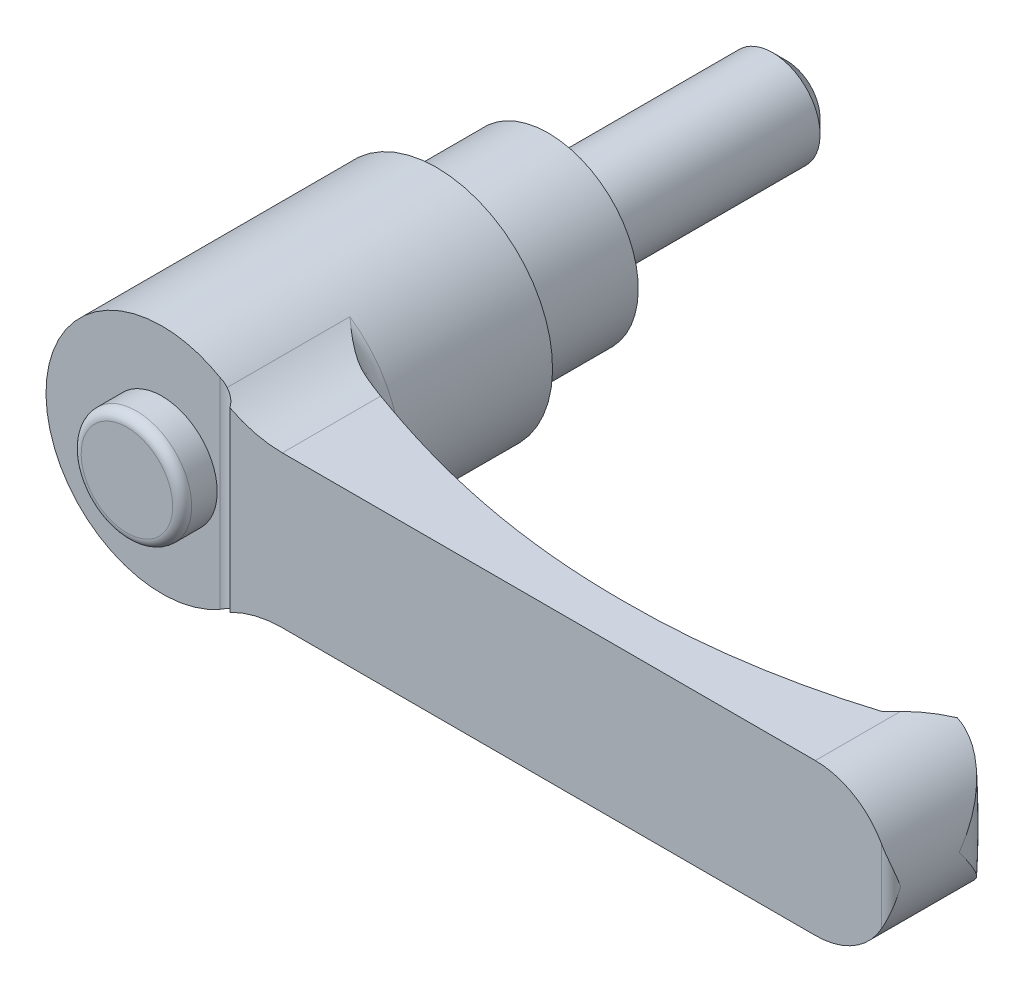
ISO-10303-21;
HEADER;
FILE_DESCRIPTION(('STEP AP214'),'2;1');
FILE_NAME('part.step','',(''),(''),'','','');
FILE_SCHEMA(('AUTOMOTIVE_DESIGN { 1 0 10303 214 1 1 1 1 }'));
ENDSEC;
DATA;
#1=APPLICATION_CONTEXT('core data for automotive mechanical design processes');
#2=APPLICATION_PROTOCOL_DEFINITION('international standard','automotive_design',2000,#1);
#3=PRODUCT_CONTEXT('',#1,'mechanical');
#4=PRODUCT('Part','Part','',(#3));
#5=PRODUCT_RELATED_PRODUCT_CATEGORY('part','',(#4));
#6=PRODUCT_DEFINITION_FORMATION('','',#4);
#7=PRODUCT_DEFINITION_CONTEXT('part definition',#1,'design');
#8=PRODUCT_DEFINITION('design','',#6,#7);
#9=PRODUCT_DEFINITION_SHAPE('','',#8);
#10=(LENGTH_UNIT() NAMED_UNIT(*) SI_UNIT(.MILLI.,.METRE.));
#11=(NAMED_UNIT(*) PLANE_ANGLE_UNIT() SI_UNIT($,.RADIAN.));
#12=(NAMED_UNIT(*) SI_UNIT($,.STERADIAN.) SOLID_ANGLE_UNIT());
#13=UNCERTAINTY_MEASURE_WITH_UNIT(LENGTH_MEASURE(1.E-05),#10,'distance_accuracy_value','');
#14=(GEOMETRIC_REPRESENTATION_CONTEXT(3) GLOBAL_UNCERTAINTY_ASSIGNED_CONTEXT((#13)) GLOBAL_UNIT_ASSIGNED_CONTEXT((#10,
#11,#12)) REPRESENTATION_CONTEXT('',''));
#15=CARTESIAN_POINT('',(0.,0.,0.));
#16=DIRECTION('',(0.,0.,1.));
#17=DIRECTION('',(1.,0.,0.));
#18=AXIS2_PLACEMENT_3D('',#15,#16,#17);
#19=CARTESIAN_POINT('',(7.6,0.,0.));
#20=DIRECTION('',(0.,0.,1.));
#21=DIRECTION('',(0.,-1.,0.));
#22=AXIS2_PLACEMENT_3D('',#19,#20,#21);
#23=PLANE('',#22);
#24=CARTESIAN_POINT('',(0.,0.,0.));
#25=DIRECTION('',(0.,0.,-1.));
#26=DIRECTION('',(0.,1.,0.));
#27=AXIS2_PLACEMENT_3D('',#24,#25,#26);
#28=CIRCLE('',#27,5.);
#29=CARTESIAN_POINT('',(0.,5.,0.));
#30=VERTEX_POINT('',#29);
#31=EDGE_CURVE('E422',#30,#30,#28,.T.);
#32=ORIENTED_EDGE('',*,*,#31,.F.);
#33=EDGE_LOOP('',(#32));
#34=FACE_BOUND('',#33,.T.);
#35=CARTESIAN_POINT('',(0.,0.,0.));
#36=DIRECTION('',(0.,0.,-1.));
#37=DIRECTION('',(0.,1.,0.));
#38=AXIS2_PLACEMENT_3D('',#35,#36,#37);
#39=CIRCLE('',#38,7.6);
#40=CARTESIAN_POINT('',(0.,7.6,0.));
#41=VERTEX_POINT('',#40);
#42=EDGE_CURVE('E347',#41,#41,#39,.T.);
#43=ORIENTED_EDGE('',*,*,#42,.T.);
#44=EDGE_LOOP('',(#43));
#45=FACE_BOUND('',#44,.T.);
#46=ADVANCED_FACE('F14',(#34,#45),#23,.F.);
#47=CARTESIAN_POINT('',(0.,0.,41.));
#48=DIRECTION('',(0.,0.,-1.));
#49=DIRECTION('',(0.,1.,0.));
#50=AXIS2_PLACEMENT_3D('',#47,#48,#49);
#51=PLANE('',#50);
#52=DIRECTION('',(0.,1.,0.));
#53=VECTOR('',#52,1.);
#54=CARTESIAN_POINT('',(6.125,-16.,41.));
#55=LINE('',#54,#53);
#56=CARTESIAN_POINT('',(6.125,-10.6088111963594,41.));
#57=VERTEX_POINT('',#56);
#58=CARTESIAN_POINT('',(6.125,10.6088111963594,41.));
#59=VERTEX_POINT('',#58);
#60=EDGE_CURVE('E385',#57,#59,#55,.T.);
#61=ORIENTED_EDGE('',*,*,#60,.T.);
#62=CARTESIAN_POINT('',(0.,0.,41.));
#63=DIRECTION('',(0.,0.,-1.));
#64=DIRECTION('',(0.,1.,0.));
#65=AXIS2_PLACEMENT_3D('',#62,#63,#64);
#66=CIRCLE('',#65,12.25);
#67=EDGE_CURVE('E332',#57,#59,#66,.T.);
#68=ORIENTED_EDGE('',*,*,#67,.F.);
#69=EDGE_LOOP('',(#61,#68));
#70=FACE_BOUND('',#69,.T.);
#71=CARTESIAN_POINT('',(0.,0.,41.));
#72=DIRECTION('',(0.,0.,-1.));
#73=DIRECTION('',(0.,1.,0.));
#74=AXIS2_PLACEMENT_3D('',#71,#72,#73);
#75=CIRCLE('',#74,5.83333333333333);
#76=CARTESIAN_POINT('',(0.,5.83333333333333,41.));
#77=VERTEX_POINT('',#76);
#78=EDGE_CURVE('E193',#77,#77,#75,.F.);
#79=ORIENTED_EDGE('',*,*,#78,.F.);
#80=EDGE_LOOP('',(#79));
#81=FACE_BOUND('',#80,.T.);
#82=ADVANCED_FACE('F163',(#70,#81),#51,.F.);
#83=CARTESIAN_POINT('',(70.,0.,0.));
#84=DIRECTION('',(0.,0.,1.));
#85=DIRECTION('',(0.,-1.,0.));
#86=AXIS2_PLACEMENT_3D('',#83,#84,#85);
#87=CYLINDRICAL_SURFACE('',#86,8.);
#88=CARTESIAN_POINT('',(78.,0.,34.8));
#89=CARTESIAN_POINT('',(78.0000000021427,-0.00507455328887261,34.7962762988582));
#90=CARTESIAN_POINT('',(77.9999951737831,-0.0101492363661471,34.7925524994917));
#91=CARTESIAN_POINT('',(77.9989416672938,-0.563628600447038,34.3864095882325));
#92=CARTESIAN_POINT('',(77.9414802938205,-1.11346566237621,33.9829298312));
#93=CARTESIAN_POINT('',(77.7692220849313,-1.92787753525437,33.38939297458));
#94=CARTESIAN_POINT('',(77.697249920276,-2.19810314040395,33.1931504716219));
#95=CARTESIAN_POINT('',(77.5237934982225,-2.73341157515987,32.8066637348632));
#96=CARTESIAN_POINT('',(77.4223242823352,-2.99849695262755,32.6164164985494));
#97=CARTESIAN_POINT('',(77.2199237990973,-3.45210642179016,32.2938177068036));
#98=CARTESIAN_POINT('',(77.1259458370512,-3.64233939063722,32.1594598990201));
#99=CARTESIAN_POINT('',(76.9211711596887,-4.01785016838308,31.8966888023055));
#100=CARTESIAN_POINT('',(76.8103745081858,-4.20312799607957,31.7682754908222));
#101=CARTESIAN_POINT('',(76.5717542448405,-4.56719869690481,31.5191542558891));
#102=CARTESIAN_POINT('',(76.4439640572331,-4.74600344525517,31.3984318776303));
#103=CARTESIAN_POINT('',(76.1708976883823,-5.09601175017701,31.1663364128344));
#104=CARTESIAN_POINT('',(76.0256268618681,-5.26721761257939,31.0549604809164));
#105=CARTESIAN_POINT('',(75.6441829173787,-5.67932922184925,30.7937387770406));
#106=CARTESIAN_POINT('',(75.3974573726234,-5.9150123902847,30.6505327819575));
#107=CARTESIAN_POINT('',(74.9987611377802,-6.24839682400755,30.4615945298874));
#108=CARTESIAN_POINT('',(74.8611020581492,-6.35616332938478,30.4029292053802));
#109=CARTESIAN_POINT('',(74.5764070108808,-6.56410843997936,30.2956150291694));
#110=CARTESIAN_POINT('',(74.429373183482,-6.66428876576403,30.2469639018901));
#111=CARTESIAN_POINT('',(74.1592544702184,-6.83522850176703,30.1705684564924));
#112=CARTESIAN_POINT('',(74.0378615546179,-6.90766708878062,30.1405781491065));
#113=CARTESIAN_POINT('',(73.7901015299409,-7.04665102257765,30.0886005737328));
#114=CARTESIAN_POINT('',(73.6637356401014,-7.11319780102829,30.0666113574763));
#115=CARTESIAN_POINT('',(73.4066843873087,-7.23982141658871,30.0315221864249));
#116=CARTESIAN_POINT('',(73.2760017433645,-7.2999022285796,30.0184167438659));
#117=CARTESIAN_POINT('',(73.0110423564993,-7.41312181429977,30.0019547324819));
#118=CARTESIAN_POINT('',(72.8767656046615,-7.46626057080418,29.9985981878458));
#119=CARTESIAN_POINT('',(72.6044130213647,-7.56559501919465,30.0024862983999));
#120=CARTESIAN_POINT('',(72.4663137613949,-7.6117232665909,30.009827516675));
#121=CARTESIAN_POINT('',(72.1887878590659,-7.69611880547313,30.0360283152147));
#122=CARTESIAN_POINT('',(72.0493611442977,-7.73438566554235,30.0548885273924));
#123=CARTESIAN_POINT('',(71.770740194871,-7.80288648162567,30.1046814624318));
#124=CARTESIAN_POINT('',(71.6315458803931,-7.83312431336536,30.1356083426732));
#125=CARTESIAN_POINT('',(71.3550409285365,-7.885663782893,30.2098119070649));
#126=CARTESIAN_POINT('',(71.217729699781,-7.90796796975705,30.2530846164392));
#127=CARTESIAN_POINT('',(70.8920238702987,-7.95241951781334,30.3719934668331));
#128=CARTESIAN_POINT('',(70.7052564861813,-7.97090772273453,30.4536477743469));
#129=CARTESIAN_POINT('',(70.433708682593,-7.98875485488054,30.5937624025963));
#130=CARTESIAN_POINT('',(70.3445710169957,-7.99305594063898,30.6434445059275));
#131=CARTESIAN_POINT('',(70.1696001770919,-7.99868029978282,30.7485120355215));
#132=CARTESIAN_POINT('',(70.0837676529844,-8.00000299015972,30.8038985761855));
#133=CARTESIAN_POINT('',(69.9998,-7.9999999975,30.8620428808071));
#134=B_SPLINE_CURVE_WITH_KNOTS('',3,(#88,#89,#90,#91,#92,#93,#94,#95,#96,#97,#98,#99,#100,#101,
#102,#103,#104,#105,#106,#107,#108,#109,#110,#111,#112,#113,#114,#115,#116,#117,#118,#119,#120,
#121,#122,#123,#124,#125,#126,#127,#128,#129,#130,#131,#132,#133),.UNSPECIFIED.,.F.,.F.,(4,2,2,
2,2,2,2,2,2,2,2,2,2,2,2,2,2,2,2,2,2,2,4),(0.,0.0188831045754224,2.05946970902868,
3.08347088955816,4.10695081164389,4.85978230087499,5.6126109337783,6.36398015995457,
7.11511980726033,8.22062566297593,8.77332293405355,9.32589447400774,9.75904172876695,
10.1920834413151,10.624857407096,11.0576324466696,11.4943381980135,11.9310679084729,
12.3675864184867,12.8039645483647,13.4155655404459,13.721767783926,14.0280299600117),.UNSPECIFIED.);
#135=CARTESIAN_POINT('',(72.9968893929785,-7.41745603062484,30.0031106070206));
#136=VERTEX_POINT('',#135);
#137=CARTESIAN_POINT('',(78.,0.,34.8));
#138=VERTEX_POINT('',#137);
#139=EDGE_CURVE('E126',#136,#138,#134,.F.);
#140=ORIENTED_EDGE('',*,*,#139,.T.);
#141=CARTESIAN_POINT('',(78.,0.,34.8));
#142=CARTESIAN_POINT('',(78.0000000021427,0.00507455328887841,34.7962762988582));
#143=CARTESIAN_POINT('',(77.9999951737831,0.0101492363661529,34.7925524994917));
#144=CARTESIAN_POINT('',(77.9989416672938,0.563628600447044,34.3864095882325));
#145=CARTESIAN_POINT('',(77.9414802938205,1.11346566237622,33.9829298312));
#146=CARTESIAN_POINT('',(77.7692220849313,1.92787753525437,33.38939297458));
#147=CARTESIAN_POINT('',(77.697249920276,2.19810314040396,33.1931504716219));
#148=CARTESIAN_POINT('',(77.5237934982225,2.73341157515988,32.8066637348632));
#149=CARTESIAN_POINT('',(77.4223242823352,2.99849695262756,32.6164164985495));
#150=CARTESIAN_POINT('',(77.2199237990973,3.45210642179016,32.2938177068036));
#151=CARTESIAN_POINT('',(77.1259458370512,3.64233939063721,32.1594598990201));
#152=CARTESIAN_POINT('',(76.9211711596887,4.01785016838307,31.8966888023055));
#153=CARTESIAN_POINT('',(76.8103745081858,4.20312799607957,31.7682754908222));
#154=CARTESIAN_POINT('',(76.5717542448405,4.56719869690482,31.5191542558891));
#155=CARTESIAN_POINT('',(76.4439640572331,4.74600344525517,31.3984318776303));
#156=CARTESIAN_POINT('',(76.1708976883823,5.09601175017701,31.1663364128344));
#157=CARTESIAN_POINT('',(76.0256268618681,5.26721761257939,31.0549604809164));
#158=CARTESIAN_POINT('',(75.6441829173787,5.67932922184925,30.7937387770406));
#159=CARTESIAN_POINT('',(75.3974573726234,5.91501239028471,30.6505327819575));
#160=CARTESIAN_POINT('',(74.9987611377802,6.24839682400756,30.4615945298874));
#161=CARTESIAN_POINT('',(74.8611020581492,6.35616332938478,30.4029292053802));
#162=CARTESIAN_POINT('',(74.5764070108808,6.56410843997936,30.2956150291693));
#163=CARTESIAN_POINT('',(74.429373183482,6.66428876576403,30.2469639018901));
#164=CARTESIAN_POINT('',(74.1592544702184,6.83522850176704,30.1705684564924));
#165=CARTESIAN_POINT('',(74.0378615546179,6.90766708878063,30.1405781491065));
#166=CARTESIAN_POINT('',(73.7901015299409,7.04665102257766,30.0886005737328));
#167=CARTESIAN_POINT('',(73.6637356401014,7.11319780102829,30.0666113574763));
#168=CARTESIAN_POINT('',(73.4066843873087,7.23982141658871,30.0315221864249));
#169=CARTESIAN_POINT('',(73.2760017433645,7.2999022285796,30.0184167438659));
#170=CARTESIAN_POINT('',(73.0110423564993,7.41312181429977,30.0019547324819));
#171=CARTESIAN_POINT('',(72.8767656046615,7.46626057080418,29.9985981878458));
#172=CARTESIAN_POINT('',(72.6044130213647,7.56559501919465,30.0024862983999));
#173=CARTESIAN_POINT('',(72.4663137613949,7.61172326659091,30.009827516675));
#174=CARTESIAN_POINT('',(72.1887878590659,7.69611880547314,30.0360283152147));
#175=CARTESIAN_POINT('',(72.0493611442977,7.73438566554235,30.0548885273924));
#176=CARTESIAN_POINT('',(71.770740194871,7.80288648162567,30.1046814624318));
#177=CARTESIAN_POINT('',(71.6315458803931,7.83312431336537,30.1356083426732));
#178=CARTESIAN_POINT('',(71.3550409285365,7.885663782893,30.2098119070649));
#179=CARTESIAN_POINT('',(71.217729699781,7.90796796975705,30.2530846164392));
#180=CARTESIAN_POINT('',(70.8920238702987,7.95241951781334,30.3719934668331));
#181=CARTESIAN_POINT('',(70.7052564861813,7.97090772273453,30.4536477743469));
#182=CARTESIAN_POINT('',(70.433708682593,7.98875485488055,30.5937624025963));
#183=CARTESIAN_POINT('',(70.3445710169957,7.99305594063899,30.6434445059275));
#184=CARTESIAN_POINT('',(70.1696001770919,7.99868029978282,30.7485120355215));
#185=CARTESIAN_POINT('',(70.0837676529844,8.00000299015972,30.8038985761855));
#186=CARTESIAN_POINT('',(69.9998,7.9999999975,30.8620428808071));
#187=B_SPLINE_CURVE_WITH_KNOTS('',3,(#141,#142,#143,#144,#145,#146,#147,#148,#149,#150,#151,
#152,#153,#154,#155,#156,#157,#158,#159,#160,#161,#162,#163,#164,#165,#166,#167,#168,#169,#170,
#171,#172,#173,#174,#175,#176,#177,#178,#179,#180,#181,#182,#183,#184,#185,#186),.UNSPECIFIED.,
.F.,.F.,(4,2,2,2,2,2,2,2,2,2,2,2,2,2,2,2,2,2,2,2,2,2,4),(0.,0.0188831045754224,2.05946970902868,
3.08347088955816,4.10695081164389,4.85978230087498,5.61261093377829,6.36398015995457,
7.11511980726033,8.22062566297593,8.77332293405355,9.32589447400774,9.75904172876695,
10.1920834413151,10.6248574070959,11.0576324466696,11.4943381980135,11.9310679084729,
12.3675864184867,12.8039645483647,13.4155655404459,13.721767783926,14.0280299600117),.UNSPECIFIED.);
#188=CARTESIAN_POINT('',(72.9968893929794,7.41745603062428,30.0031106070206));
#189=VERTEX_POINT('',#188);
#190=EDGE_CURVE('E123',#138,#189,#187,.T.);
#191=ORIENTED_EDGE('',*,*,#190,.T.);
#192=CARTESIAN_POINT('',(70.,0.,33.));
#193=DIRECTION('',(-0.707106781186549,0.,-0.707106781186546));
#194=DIRECTION('',(-0.707106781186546,0.,0.707106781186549));
#195=AXIS2_PLACEMENT_3D('',#192,#193,#194);
#196=ELLIPSE('',#195,11.3137084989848,8.);
#197=CARTESIAN_POINT('',(70.,8.,33.));
#198=VERTEX_POINT('',#197);
#199=EDGE_CURVE('E378',#189,#198,#196,.F.);
#200=ORIENTED_EDGE('',*,*,#199,.T.);
#201=DIRECTION('',(0.,0.,1.));
#202=VECTOR('',#201,1.);
#203=CARTESIAN_POINT('',(70.,8.,0.));
#204=LINE('',#203,#202);
#205=CARTESIAN_POINT('',(70.,8.,42.));
#206=VERTEX_POINT('',#205);
#207=EDGE_CURVE('E354',#198,#206,#204,.T.);
#208=ORIENTED_EDGE('',*,*,#207,.T.);
#209=CARTESIAN_POINT('',(70.,0.,42.));
#210=DIRECTION('',(0.,0.,1.));
#211=DIRECTION('',(0.,-1.,0.));
#212=AXIS2_PLACEMENT_3D('',#209,#210,#211);
#213=CIRCLE('',#212,8.);
#214=CARTESIAN_POINT('',(77.,3.87298334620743,42.));
#215=VERTEX_POINT('',#214);
#216=EDGE_CURVE('E327',#215,#206,#213,.T.);
#217=ORIENTED_EDGE('',*,*,#216,.F.);
#218=CARTESIAN_POINT('',(77.,3.87298334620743,42.));
#219=CARTESIAN_POINT('',(77.0320487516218,3.8150611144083,41.9999909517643));
#220=CARTESIAN_POINT('',(77.0633658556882,3.75675902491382,41.9984605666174));
#221=CARTESIAN_POINT('',(77.1244803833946,3.63952511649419,41.99269833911));
#222=CARTESIAN_POINT('',(77.1542784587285,3.58059358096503,41.9884676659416));
#223=CARTESIAN_POINT('',(77.241218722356,3.40324230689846,41.9722589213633));
#224=CARTESIAN_POINT('',(77.2960525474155,3.28400247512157,41.9567609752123));
#225=CARTESIAN_POINT('',(77.3991566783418,3.04456972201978,41.9185214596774));
#226=CARTESIAN_POINT('',(77.4474555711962,2.9243835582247,41.8958129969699));
#227=CARTESIAN_POINT('',(77.5378429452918,2.68282861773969,41.8446429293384));
#228=CARTESIAN_POINT('',(77.5799268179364,2.56145903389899,41.8161770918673));
#229=CARTESIAN_POINT('',(77.6827368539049,2.24038507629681,41.7351721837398));
#230=CARTESIAN_POINT('',(77.7382927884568,2.03996193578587,41.6788382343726));
#231=CARTESIAN_POINT('',(77.8332865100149,1.63779800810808,41.55814944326));
#232=CARTESIAN_POINT('',(77.8727175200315,1.43605670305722,41.4937912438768));
#233=CARTESIAN_POINT('',(77.967421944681,0.829293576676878,41.2932012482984));
#234=CARTESIAN_POINT('',(77.999127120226,0.42266785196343,41.1494356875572));
#235=CARTESIAN_POINT('',(77.9999940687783,0.0112434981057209,41.0039751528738));
#236=CARTESIAN_POINT('',(77.9999999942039,0.00562166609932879,41.0019875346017));
#237=CARTESIAN_POINT('',(78.,0.,41.));
#238=B_SPLINE_CURVE_WITH_KNOTS('',3,(#218,#219,#220,#221,#222,#223,#224,#225,#226,#227,#228,
#229,#230,#231,#232,#233,#234,#235,#236,#237),.UNSPECIFIED.,.F.,.F.,(4,2,2,2,2,2,2,2,2,4),(0.,
0.198535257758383,0.396984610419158,0.792983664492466,1.18719018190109,1.5816875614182,
2.22713013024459,2.8728436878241,4.16406208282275,4.18195063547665),.UNSPECIFIED.);
#239=CARTESIAN_POINT('',(78.,0.,41.));
#240=VERTEX_POINT('',#239);
#241=EDGE_CURVE('E179',#240,#215,#238,.F.);
#242=ORIENTED_EDGE('',*,*,#241,.F.);
#243=CARTESIAN_POINT('',(77.,-3.87298334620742,42.));
#244=CARTESIAN_POINT('',(77.0320487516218,-3.81506111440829,41.9999909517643));
#245=CARTESIAN_POINT('',(77.0633658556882,-3.75675902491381,41.9984605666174));
#246=CARTESIAN_POINT('',(77.1244803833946,-3.63952511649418,41.99269833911));
#247=CARTESIAN_POINT('',(77.1542784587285,-3.58059358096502,41.9884676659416));
#248=CARTESIAN_POINT('',(77.241218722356,-3.40324230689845,41.9722589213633));
#249=CARTESIAN_POINT('',(77.2960525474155,-3.28400247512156,41.9567609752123));
#250=CARTESIAN_POINT('',(77.3991566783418,-3.04456972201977,41.9185214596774));
#251=CARTESIAN_POINT('',(77.4474555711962,-2.92438355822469,41.8958129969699));
#252=CARTESIAN_POINT('',(77.5378429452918,-2.68282861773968,41.8446429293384));
#253=CARTESIAN_POINT('',(77.5799268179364,-2.56145903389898,41.8161770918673));
#254=CARTESIAN_POINT('',(77.6827368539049,-2.2403850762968,41.7351721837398));
#255=CARTESIAN_POINT('',(77.7382927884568,-2.03996193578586,41.6788382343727));
#256=CARTESIAN_POINT('',(77.8332865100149,-1.63779800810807,41.55814944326));
#257=CARTESIAN_POINT('',(77.8727175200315,-1.43605670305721,41.4937912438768));
#258=CARTESIAN_POINT('',(77.967421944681,-0.829293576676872,41.2932012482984));
#259=CARTESIAN_POINT('',(77.999127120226,-0.422667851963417,41.1494356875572));
#260=CARTESIAN_POINT('',(77.9999940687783,-0.0112434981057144,41.0039751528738));
#261=CARTESIAN_POINT('',(77.9999999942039,-0.00562166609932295,41.0019875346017));
#262=CARTESIAN_POINT('',(78.,0.,41.));
#263=B_SPLINE_CURVE_WITH_KNOTS('',3,(#243,#244,#245,#246,#247,#248,#249,#250,#251,#252,#253,
#254,#255,#256,#257,#258,#259,#260,#261,#262),.UNSPECIFIED.,.F.,.F.,(4,2,2,2,2,2,2,2,2,4),(0.,
0.19853525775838,0.396984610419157,0.792983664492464,1.18719018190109,1.5816875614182,
2.2271301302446,2.8728436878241,4.16406208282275,4.18195063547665),.UNSPECIFIED.);
#264=CARTESIAN_POINT('',(77.,-3.87298334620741,42.));
#265=VERTEX_POINT('',#264);
#266=EDGE_CURVE('E187',#265,#240,#263,.T.);
#267=ORIENTED_EDGE('',*,*,#266,.F.);
#268=CARTESIAN_POINT('',(70.,-8.,42.));
#269=VERTEX_POINT('',#268);
#270=EDGE_CURVE('E322',#269,#265,#213,.T.);
#271=ORIENTED_EDGE('',*,*,#270,.F.);
#272=DIRECTION('',(0.,0.,1.));
#273=VECTOR('',#272,1.);
#274=CARTESIAN_POINT('',(70.,-8.,0.));
#275=LINE('',#274,#273);
#276=CARTESIAN_POINT('',(70.,-8.,33.));
#277=VERTEX_POINT('',#276);
#278=EDGE_CURVE('E357',#277,#269,#275,.T.);
#279=ORIENTED_EDGE('',*,*,#278,.F.);
#280=EDGE_CURVE('E137',#277,#136,#196,.F.);
#281=ORIENTED_EDGE('',*,*,#280,.T.);
#282=EDGE_LOOP('',(#140,#191,#200,#208,#217,#242,#267,#271,#279,#281));
#283=FACE_BOUND('',#282,.T.);
#284=ADVANCED_FACE('F135',(#283),#87,.T.);
#285=CARTESIAN_POINT('',(73.,-16.,30.));
#286=DIRECTION('',(-0.707106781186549,0.,-0.707106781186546));
#287=DIRECTION('',(0.707106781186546,0.,-0.707106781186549));
#288=AXIS2_PLACEMENT_3D('',#285,#286,#287);
#289=PLANE('',#288);
#290=DIRECTION('',(0.,1.,0.));
#291=VECTOR('',#290,1.);
#292=CARTESIAN_POINT('',(73.,-16.,30.));
#293=LINE('',#292,#291);
#294=CARTESIAN_POINT('',(73.,-5.40740233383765,30.));
#295=VERTEX_POINT('',#294);
#296=CARTESIAN_POINT('',(73.,5.40740233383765,30.));
#297=VERTEX_POINT('',#296);
#298=EDGE_CURVE('E397',#295,#297,#293,.T.);
#299=ORIENTED_EDGE('',*,*,#298,.F.);
#300=CARTESIAN_POINT('',(72.9944134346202,8.0002,30.0055865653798));
#301=CARTESIAN_POINT('',(72.9964174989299,7.60019527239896,30.0035825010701));
#302=CARTESIAN_POINT('',(72.9977626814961,7.20018596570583,30.0022373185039));
#303=CARTESIAN_POINT('',(72.9994970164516,6.40016550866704,30.0005029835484));
#304=CARTESIAN_POINT('',(72.9998861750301,6.00015435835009,30.0001138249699));
#305=CARTESIAN_POINT('',(73.0000702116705,5.20013335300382,29.9999297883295));
#306=CARTESIAN_POINT('',(72.9998650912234,4.80012349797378,30.0001349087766));
#307=CARTESIAN_POINT('',(72.9991717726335,4.00010369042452,30.0008282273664));
#308=CARTESIAN_POINT('',(72.998683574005,3.60009373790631,30.001316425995));
#309=CARTESIAN_POINT('',(72.9972116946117,2.40006658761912,30.0027883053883));
#310=CARTESIAN_POINT('',(72.9962207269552,1.60004928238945,30.0037792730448));
#311=CARTESIAN_POINT('',(72.9954610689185,1.3601944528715E-05,30.0045389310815));
#312=CARTESIAN_POINT('',(72.9956923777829,-0.800004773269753,30.004307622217));
#313=CARTESIAN_POINT('',(72.9968584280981,-2.13336982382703,30.0031415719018));
#314=CARTESIAN_POINT('',(72.9975329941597,-2.66671710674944,30.0024670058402));
#315=CARTESIAN_POINT('',(72.9988528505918,-3.73341119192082,30.0011471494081));
#316=CARTESIAN_POINT('',(72.999498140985,-4.26675799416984,30.000501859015));
#317=CARTESIAN_POINT('',(73.000124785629,-5.33345534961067,29.999875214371));
#318=CARTESIAN_POINT('',(73.0001061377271,-5.86680590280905,29.9998938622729));
#319=CARTESIAN_POINT('',(72.9985813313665,-6.93350631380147,30.0014186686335));
#320=CARTESIAN_POINT('',(72.997075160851,-7.46685617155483,30.002924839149));
#321=CARTESIAN_POINT('',(72.9944134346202,-8.0002,30.0055865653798));
#322=B_SPLINE_CURVE_WITH_KNOTS('',3,(#300,#301,#302,#303,#304,#305,#306,#307,#308,#309,#310,
#311,#312,#313,#314,#315,#316,#317,#318,#319,#320,#321),.UNSPECIFIED.,.F.,.F.,(4,2,2,2,2,2,2,2,
2,2,4),(0.,1.20004037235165,2.40007297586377,3.60010256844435,4.80013422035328,7.20018907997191,
9.60024245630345,11.2002867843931,12.8003298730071,14.4003781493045,16.0004393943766),.UNSPECIFIED.);
#323=EDGE_CURVE('E138',#295,#136,#322,.T.);
#324=ORIENTED_EDGE('',*,*,#323,.T.);
#325=ORIENTED_EDGE('',*,*,#280,.F.);
#326=DIRECTION('',(-0.707106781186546,0.,0.707106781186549));
#327=VECTOR('',#326,1.);
#328=CARTESIAN_POINT('',(86.5,-8.,16.5));
#329=LINE('',#328,#327);
#330=CARTESIAN_POINT('',(69.,-8.,34.));
#331=VERTEX_POINT('',#330);
#332=EDGE_CURVE('E321',#277,#331,#329,.T.);
#333=ORIENTED_EDGE('',*,*,#332,.T.);
#334=DIRECTION('',(0.,1.,0.));
#335=VECTOR('',#334,1.);
#336=CARTESIAN_POINT('',(69.,-16.,34.));
#337=LINE('',#336,#335);
#338=CARTESIAN_POINT('',(69.,8.,34.));
#339=VERTEX_POINT('',#338);
#340=EDGE_CURVE('E319',#331,#339,#337,.T.);
#341=ORIENTED_EDGE('',*,*,#340,.T.);
#342=DIRECTION('',(0.707106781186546,0.,-0.707106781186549));
#343=VECTOR('',#342,1.);
#344=CARTESIAN_POINT('',(58.3567940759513,8.,44.6432059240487));
#345=LINE('',#344,#343);
#346=EDGE_CURVE('E375',#339,#198,#345,.T.);
#347=ORIENTED_EDGE('',*,*,#346,.T.);
#348=ORIENTED_EDGE('',*,*,#199,.F.);
#349=EDGE_CURVE('E129',#189,#297,#322,.T.);
#350=ORIENTED_EDGE('',*,*,#349,.T.);
#351=EDGE_LOOP('',(#299,#324,#325,#333,#341,#347,#348,#350));
#352=FACE_BOUND('',#351,.T.);
#353=ADVANCED_FACE('F162',(#352),#289,.T.);
#354=CARTESIAN_POINT('',(73.2,-16.,30.));
#355=DIRECTION('',(0.,0.,-1.));
#356=DIRECTION('',(0.,1.,0.));
#357=AXIS2_PLACEMENT_3D('',#354,#355,#356);
#358=PLANE('',#357);
#359=ORIENTED_EDGE('',*,*,#298,.T.);
#360=CARTESIAN_POINT('',(0.,0.,30.));
#361=DIRECTION('',(0.,0.,-1.));
#362=DIRECTION('',(0.,1.,0.));
#363=AXIS2_PLACEMENT_3D('',#360,#361,#362);
#364=CIRCLE('',#363,73.2);
#365=EDGE_CURVE('E36',#297,#295,#364,.T.);
#366=ORIENTED_EDGE('',*,*,#365,.T.);
#367=EDGE_LOOP('',(#359,#366));
#368=FACE_BOUND('',#367,.T.);
#369=ADVANCED_FACE('F201',(#368),#358,.T.);
#370=CARTESIAN_POINT('',(0.,0.,42.));
#371=DIRECTION('',(0.,0.,1.));
#372=DIRECTION('',(0.,-1.,0.));
#373=AXIS2_PLACEMENT_3D('',#370,#371,#372);
#374=PLANE('',#373);
#375=CARTESIAN_POINT('',(13.7135881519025,20.,42.));
#376=DIRECTION('',(0.,0.,1.));
#377=DIRECTION('',(1.,0.,0.));
#378=AXIS2_PLACEMENT_3D('',#375,#376,#377);
#379=CIRCLE('',#378,12.);
#380=CARTESIAN_POINT('',(8.16666666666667,9.35896330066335,42.));
#381=VERTEX_POINT('',#380);
#382=CARTESIAN_POINT('',(13.7135881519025,8.,42.));
#383=VERTEX_POINT('',#382);
#384=EDGE_CURVE('E372',#381,#383,#379,.T.);
#385=ORIENTED_EDGE('',*,*,#384,.F.);
#386=DIRECTION('',(0.,1.,0.));
#387=VECTOR('',#386,1.);
#388=CARTESIAN_POINT('',(8.16666666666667,-16.,42.));
#389=LINE('',#388,#387);
#390=CARTESIAN_POINT('',(8.16666666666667,-9.35896330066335,42.));
#391=VERTEX_POINT('',#390);
#392=EDGE_CURVE('E392',#391,#381,#389,.T.);
#393=ORIENTED_EDGE('',*,*,#392,.F.);
#394=CARTESIAN_POINT('',(13.7135881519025,-20.,42.));
#395=DIRECTION('',(0.,0.,1.));
#396=DIRECTION('',(1.,0.,0.));
#397=AXIS2_PLACEMENT_3D('',#394,#395,#396);
#398=CIRCLE('',#397,12.);
#399=CARTESIAN_POINT('',(13.7135881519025,-8.,42.));
#400=VERTEX_POINT('',#399);
#401=EDGE_CURVE('E363',#400,#391,#398,.T.);
#402=ORIENTED_EDGE('',*,*,#401,.F.);
#403=DIRECTION('',(-1.,0.,0.));
#404=VECTOR('',#403,1.);
#405=CARTESIAN_POINT('',(70.,-8.,42.));
#406=LINE('',#405,#404);
#407=EDGE_CURVE('E366',#269,#400,#406,.T.);
#408=ORIENTED_EDGE('',*,*,#407,.F.);
#409=ORIENTED_EDGE('',*,*,#270,.T.);
#410=DIRECTION('',(0.,1.,0.));
#411=VECTOR('',#410,1.);
#412=CARTESIAN_POINT('',(77.,-16.,42.));
#413=LINE('',#412,#411);
#414=EDGE_CURVE('E393',#265,#215,#413,.T.);
#415=ORIENTED_EDGE('',*,*,#414,.T.);
#416=ORIENTED_EDGE('',*,*,#216,.T.);
#417=DIRECTION('',(1.,0.,0.));
#418=VECTOR('',#417,1.);
#419=CARTESIAN_POINT('',(13.7135881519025,8.,42.));
#420=LINE('',#419,#418);
#421=EDGE_CURVE('E369',#383,#206,#420,.T.);
#422=ORIENTED_EDGE('',*,*,#421,.F.);
#423=EDGE_LOOP('',(#385,#393,#402,#408,#409,#415,#416,#422));
#424=FACE_BOUND('',#423,.T.);
#425=ADVANCED_FACE('F248',(#424),#374,.T.);
#426=CARTESIAN_POINT('',(0.,0.,0.));
#427=DIRECTION('',(0.,0.,-1.));
#428=DIRECTION('',(0.,1.,0.));
#429=AXIS2_PLACEMENT_3D('',#426,#427,#428);
#430=CYLINDRICAL_SURFACE('',#429,12.25);
#431=CARTESIAN_POINT('',(0.,0.,28.0779919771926));
#432=DIRECTION('',(0.,0.,-1.));
#433=DIRECTION('',(0.,1.,0.));
#434=AXIS2_PLACEMENT_3D('',#431,#432,#433);
#435=CIRCLE('',#434,12.25);
#436=CARTESIAN_POINT('',(6.92748267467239,10.1030927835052,28.0779919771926));
#437=VERTEX_POINT('',#436);
#438=CARTESIAN_POINT('',(6.92748267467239,-10.1030927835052,28.0779919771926));
#439=VERTEX_POINT('',#438);
#440=EDGE_CURVE('E412',#437,#439,#435,.T.);
#441=ORIENTED_EDGE('',*,*,#440,.T.);
#442=DIRECTION('',(0.,0.,1.));
#443=VECTOR('',#442,1.);
#444=CARTESIAN_POINT('',(6.92748267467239,-10.1030927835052,0.));
#445=LINE('',#444,#443);
#446=CARTESIAN_POINT('',(6.92748267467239,-10.1030927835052,41.0427567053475));
#447=VERTEX_POINT('',#446);
#448=EDGE_CURVE('E361',#439,#447,#445,.T.);
#449=ORIENTED_EDGE('',*,*,#448,.T.);
#450=CARTESIAN_POINT('',(6.125,-10.6088111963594,41.));
#451=CARTESIAN_POINT('',(6.19832883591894,-10.5664875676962,40.9889897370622));
#452=CARTESIAN_POINT('',(6.27164451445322,-10.523132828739,40.9821479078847));
#453=CARTESIAN_POINT('',(6.41753908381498,-10.4347921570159,40.9764986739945));
#454=CARTESIAN_POINT('',(6.49011843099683,-10.3898073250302,40.9776859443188));
#455=CARTESIAN_POINT('',(6.63402897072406,-10.2985167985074,40.9877856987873));
#456=CARTESIAN_POINT('',(6.70535828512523,-10.2522093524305,40.996708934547));
#457=CARTESIAN_POINT('',(6.84611057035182,-10.1587605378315,41.0220012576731));
#458=CARTESIAN_POINT('',(6.91553331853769,-10.1116190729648,41.0383712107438));
#459=CARTESIAN_POINT('',(7.10641045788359,-9.97916014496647,41.094233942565));
#460=CARTESIAN_POINT('',(7.22525798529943,-9.89334730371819,41.1417583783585));
#461=CARTESIAN_POINT('',(7.45241295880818,-9.72337963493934,41.2589427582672));
#462=CARTESIAN_POINT('',(7.56074253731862,-9.63922163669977,41.3285548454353));
#463=CARTESIAN_POINT('',(7.71168483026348,-9.51821587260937,41.4479066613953));
#464=CARTESIAN_POINT('',(7.75936397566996,-9.47936365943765,41.4893658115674));
#465=CARTESIAN_POINT('',(7.85125896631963,-9.40339173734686,41.5773725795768));
#466=CARTESIAN_POINT('',(7.89547657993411,-9.36627114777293,41.6239175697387));
#467=CARTESIAN_POINT('',(7.98020904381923,-9.29418452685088,41.7223463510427));
#468=CARTESIAN_POINT('',(8.02070494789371,-9.25922978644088,41.7742548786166));
#469=CARTESIAN_POINT('',(8.09722101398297,-9.19239515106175,41.8832605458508));
#470=CARTESIAN_POINT('',(8.13323329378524,-9.16052069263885,41.9403665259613));
#471=CARTESIAN_POINT('',(8.16666666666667,-9.13061090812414,42.));
#472=B_SPLINE_CURVE_WITH_KNOTS('',3,(#450,#451,#452,#453,#454,#455,#456,#457,#458,#459,#460,
#461,#462,#463,#464,#465,#466,#467,#468,#469,#470,#471),.UNSPECIFIED.,.F.,.F.,(4,2,2,2,2,2,2,2,
2,2,4),(0.,0.255975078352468,0.511780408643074,0.767941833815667,1.02413304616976,
1.48441304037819,1.94370248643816,2.16599787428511,2.38817894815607,2.61143478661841,
2.83507772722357),.UNSPECIFIED.);
#473=EDGE_CURVE('E222',#57,#447,#472,.T.);
#474=ORIENTED_EDGE('',*,*,#473,.F.);
#475=ORIENTED_EDGE('',*,*,#67,.T.);
#476=CARTESIAN_POINT('',(8.16666666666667,9.13061090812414,42.));
#477=CARTESIAN_POINT('',(8.13602850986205,9.15801692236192,41.9453523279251));
#478=CARTESIAN_POINT('',(8.10323346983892,9.18706943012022,41.8928397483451));
#479=CARTESIAN_POINT('',(8.03382107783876,9.24782874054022,41.7921703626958));
#480=CARTESIAN_POINT('',(7.99720910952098,9.27953179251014,41.7440075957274));
#481=CARTESIAN_POINT('',(7.88274220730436,9.37735907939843,41.6065497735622));
#482=CARTESIAN_POINT('',(7.79984772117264,9.44657197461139,41.5235775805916));
#483=CARTESIAN_POINT('',(7.62397737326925,9.58906879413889,41.3751924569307));
#484=CARTESIAN_POINT('',(7.53106018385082,9.66232791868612,41.3096843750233));
#485=CARTESIAN_POINT('',(7.33643153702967,9.81092784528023,41.1955319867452));
#486=CARTESIAN_POINT('',(7.23469620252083,9.88627389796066,41.1469353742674));
#487=CARTESIAN_POINT('',(7.00601089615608,10.0499435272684,41.0604339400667));
#488=CARTESIAN_POINT('',(6.87776073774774,10.1382349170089,41.0258797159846));
#489=CARTESIAN_POINT('',(6.61511692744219,10.3115145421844,40.9827504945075));
#490=CARTESIAN_POINT('',(6.48074133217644,10.3965112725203,40.9741035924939));
#491=CARTESIAN_POINT('',(6.30869788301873,10.5006996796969,40.9806991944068));
#492=CARTESIAN_POINT('',(6.27199131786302,10.5226640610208,40.9831161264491));
#493=CARTESIAN_POINT('',(6.19852568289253,10.5661055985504,40.9900077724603));
#494=CARTESIAN_POINT('',(6.16176668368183,10.5875831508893,40.9944807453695));
#495=CARTESIAN_POINT('',(6.125,10.6088111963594,41.));
#496=B_SPLINE_CURVE_WITH_KNOTS('',3,(#476,#477,#478,#479,#480,#481,#482,#483,#484,#485,#486,
#487,#488,#489,#490,#491,#492,#493,#494,#495),.UNSPECIFIED.,.F.,.F.,(4,2,2,2,2,2,2,2,2,4),(0.,
0.204930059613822,0.409574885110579,0.816210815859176,1.22058373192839,1.62608799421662,
2.10242753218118,2.57744378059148,2.7059409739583,2.83432955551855),.UNSPECIFIED.);
#497=CARTESIAN_POINT('',(6.92748267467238,10.1030927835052,41.0427567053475));
#498=VERTEX_POINT('',#497);
#499=EDGE_CURVE('E236',#498,#59,#496,.T.);
#500=ORIENTED_EDGE('',*,*,#499,.F.);
#501=DIRECTION('',(0.,0.,1.));
#502=VECTOR('',#501,1.);
#503=CARTESIAN_POINT('',(6.92748267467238,10.1030927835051,0.));
#504=LINE('',#503,#502);
#505=EDGE_CURVE('E350',#437,#498,#504,.T.);
#506=ORIENTED_EDGE('',*,*,#505,.F.);
#507=EDGE_LOOP('',(#441,#449,#474,#475,#500,#506));
#508=FACE_BOUND('',#507,.T.);
#509=CARTESIAN_POINT('',(0.,0.,12.));
#510=DIRECTION('',(0.,0.,-1.));
#511=DIRECTION('',(0.,1.,0.));
#512=AXIS2_PLACEMENT_3D('',#509,#510,#511);
#513=CIRCLE('',#512,12.25);
#514=CARTESIAN_POINT('',(0.,12.25,12.));
#515=VERTEX_POINT('',#514);
#516=EDGE_CURVE('E335',#515,#515,#513,.T.);
#517=ORIENTED_EDGE('',*,*,#516,.F.);
#518=EDGE_LOOP('',(#517));
#519=FACE_BOUND('',#518,.T.);
#520=ADVANCED_FACE('F246',(#508,#519),#430,.T.);
#521=CARTESIAN_POINT('',(13.7135881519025,20.,0.));
#522=DIRECTION('',(0.,0.,1.));
#523=DIRECTION('',(0.,-1.,0.));
#524=AXIS2_PLACEMENT_3D('',#521,#522,#523);
#525=CYLINDRICAL_SURFACE('',#524,12.);
#526=DIRECTION('',(0.,0.,1.));
#527=VECTOR('',#526,1.);
#528=CARTESIAN_POINT('',(13.7135881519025,8.,0.));
#529=LINE('',#528,#527);
#530=CARTESIAN_POINT('',(13.7135881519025,8.,31.611749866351));
#531=VERTEX_POINT('',#530);
#532=EDGE_CURVE('E352',#531,#383,#529,.T.);
#533=ORIENTED_EDGE('',*,*,#532,.F.);
#534=CARTESIAN_POINT('',(16.5591435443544,8.34226374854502,32.6591102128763));
#535=CARTESIAN_POINT('',(16.3261928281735,8.28540329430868,32.5722424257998));
#536=CARTESIAN_POINT('',(16.0917373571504,8.23557224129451,32.4848250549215));
#537=CARTESIAN_POINT('',(15.6204190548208,8.15004770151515,32.3095064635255));
#538=CARTESIAN_POINT('',(15.3835560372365,8.11435531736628,32.2216052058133));
#539=CARTESIAN_POINT('',(14.9085098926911,8.05724969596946,32.0461136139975));
#540=CARTESIAN_POINT('',(14.6703300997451,8.03580964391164,31.9585230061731));
#541=CARTESIAN_POINT('',(14.1928153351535,8.00718735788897,31.7842679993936));
#542=CARTESIAN_POINT('',(13.9534804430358,8.00000415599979,31.697603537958));
#543=CARTESIAN_POINT('',(13.3222890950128,7.99999321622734,31.4717100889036));
#544=CARTESIAN_POINT('',(12.9298365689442,8.01913869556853,31.3339527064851));
#545=CARTESIAN_POINT('',(12.1446747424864,8.09645283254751,31.0677464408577));
#546=CARTESIAN_POINT('',(11.7519664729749,8.15469870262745,30.9393165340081));
#547=CARTESIAN_POINT('',(11.0678445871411,8.29148603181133,30.7286186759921));
#548=CARTESIAN_POINT('',(10.7757440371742,8.36126529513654,30.6428547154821));
#549=CARTESIAN_POINT('',(10.1944299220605,8.52365043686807,30.4833757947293));
#550=CARTESIAN_POINT('',(9.90521727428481,8.61626334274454,30.4096645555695));
#551=CARTESIAN_POINT('',(9.33232622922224,8.82426158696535,30.2779606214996));
#552=CARTESIAN_POINT('',(9.04863462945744,8.93958259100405,30.219924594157));
#553=CARTESIAN_POINT('',(8.48843633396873,9.19295718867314,30.1227055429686));
#554=CARTESIAN_POINT('',(8.21192433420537,9.33099341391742,30.0835082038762));
#555=CARTESIAN_POINT('',(7.70530850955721,9.60902203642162,30.0304308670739));
#556=CARTESIAN_POINT('',(7.47397220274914,9.74624410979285,30.0138509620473));
#557=CARTESIAN_POINT('',(7.13386740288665,9.96379307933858,30.0017184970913));
#558=CARTESIAN_POINT('',(7.0215618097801,10.0383265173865,29.9998008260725));
#559=CARTESIAN_POINT('',(6.79949902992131,10.1911494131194,30.0002323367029));
#560=CARTESIAN_POINT('',(6.68974254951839,10.2694398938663,30.0025826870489));
#561=CARTESIAN_POINT('',(6.5813815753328,10.3495269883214,30.007070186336));
#562=B_SPLINE_CURVE_WITH_KNOTS('',3,(#534,#535,#536,#537,#538,#539,#540,#541,#542,#543,#544,
#545,#546,#547,#548,#549,#550,#551,#552,#553,#554,#555,#556,#557,#558,#559,#560,#561),
.UNSPECIFIED.,.F.,.F.,(4,2,2,2,2,2,2,2,2,2,2,2,2,4),(0.,0.765007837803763,1.53007532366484,
2.29369928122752,3.05727139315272,4.30444442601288,5.55408755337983,6.49010923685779,
7.42641935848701,8.36011402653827,9.29309806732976,10.100354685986,10.5046318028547,
10.9090196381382),.UNSPECIFIED.);
#563=CARTESIAN_POINT('',(11.361472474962,8.23277637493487,30.8190510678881));
#564=VERTEX_POINT('',#563);
#565=EDGE_CURVE('E262',#531,#564,#562,.T.);
#566=ORIENTED_EDGE('',*,*,#565,.T.);
#567=CARTESIAN_POINT('',(14.1569924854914,8.00819477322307,30.9010555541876));
#568=CARTESIAN_POINT('',(14.0595029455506,8.00457612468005,30.9322196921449));
#569=CARTESIAN_POINT('',(13.9606253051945,8.00212380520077,30.9590151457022));
#570=CARTESIAN_POINT('',(13.7610637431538,7.99968329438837,31.004218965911));
#571=CARTESIAN_POINT('',(13.6603822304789,7.99969203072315,31.0226377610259));
#572=CARTESIAN_POINT('',(13.4585847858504,8.00228706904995,31.0514218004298));
#573=CARTESIAN_POINT('',(13.3574757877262,8.00485682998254,31.061837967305));
#574=CARTESIAN_POINT('',(13.1548462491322,8.01258614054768,31.0753001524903));
#575=CARTESIAN_POINT('',(13.053325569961,8.01774665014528,31.0783434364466));
#576=CARTESIAN_POINT('',(12.8251352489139,8.0322613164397,31.0774805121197));
#577=CARTESIAN_POINT('',(12.6985166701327,8.04234092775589,31.07164895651));
#578=CARTESIAN_POINT('',(12.446446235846,8.06641586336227,31.0503579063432));
#579=CARTESIAN_POINT('',(12.3209952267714,8.08041382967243,31.0348919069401));
#580=CARTESIAN_POINT('',(11.9473264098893,8.12804907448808,30.9756133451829));
#581=CARTESIAN_POINT('',(11.7017310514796,8.16733172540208,30.9189189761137));
#582=CARTESIAN_POINT('',(11.4284283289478,8.21954129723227,30.8393902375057));
#583=CARTESIAN_POINT('',(11.3952261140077,8.22603104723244,30.829444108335));
#584=CARTESIAN_POINT('',(11.1613640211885,8.27276596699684,30.7574361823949));
#585=CARTESIAN_POINT('',(10.9642103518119,8.31751135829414,30.6865405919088));
#586=CARTESIAN_POINT('',(10.5777285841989,8.41525886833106,30.5303701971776));
#587=CARTESIAN_POINT('',(10.3884095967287,8.46827027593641,30.4450792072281));
#588=CARTESIAN_POINT('',(10.0168146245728,8.5819543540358,30.262829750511));
#589=CARTESIAN_POINT('',(9.83457244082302,8.64265900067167,30.1658226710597));
#590=CARTESIAN_POINT('',(9.47767438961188,8.77088665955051,29.9630240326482));
#591=CARTESIAN_POINT('',(9.30301613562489,8.83840750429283,29.8572352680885));
#592=CARTESIAN_POINT('',(8.93248691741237,8.99147577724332,29.6209801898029));
#593=CARTESIAN_POINT('',(8.73785326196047,9.07816138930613,29.4893172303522));
#594=CARTESIAN_POINT('',(8.35703282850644,9.25980318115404,29.2196101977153));
#595=CARTESIAN_POINT('',(8.17084790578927,9.35476116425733,29.0815647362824));
#596=CARTESIAN_POINT('',(7.80639286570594,9.55261034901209,28.801722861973));
#597=CARTESIAN_POINT('',(7.62810747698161,9.65548508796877,28.6599346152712));
#598=CARTESIAN_POINT('',(7.27822148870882,9.8694475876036,28.3744148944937));
#599=CARTESIAN_POINT('',(7.10661929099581,9.98053336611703,28.2306838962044));
#600=CARTESIAN_POINT('',(6.93448645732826,10.0982931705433,28.0839649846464));
#601=CARTESIAN_POINT('',(6.93098392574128,10.1006920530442,28.0809784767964));
#602=CARTESIAN_POINT('',(6.92748267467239,10.1030927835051,28.0779919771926));
#603=B_SPLINE_CURVE_WITH_KNOTS('',3,(#567,#568,#569,#570,#571,#572,#573,#574,#575,#576,#577,
#578,#579,#580,#581,#582,#583,#584,#585,#586,#587,#588,#589,#590,#591,#592,#593,#594,#595,#596,
#597,#598,#599,#600,#601,#602),.UNSPECIFIED.,.F.,.F.,(4,2,2,2,2,2,2,2,2,2,2,2,2,2,2,2,2,4),(0.,
0.307060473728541,0.613737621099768,0.918446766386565,1.2232689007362,1.60421628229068,
1.98542114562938,2.74764704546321,2.85344139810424,3.49502286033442,4.13733056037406,
4.78240133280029,5.42726761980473,6.17822336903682,6.9293432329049,7.67894130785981,
8.42835901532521,8.44393060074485),.UNSPECIFIED.);
#604=EDGE_CURVE('E253',#564,#437,#603,.T.);
#605=ORIENTED_EDGE('',*,*,#604,.T.);
#606=ORIENTED_EDGE('',*,*,#505,.T.);
#607=CARTESIAN_POINT('',(8.16666666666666,9.35896330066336,42.));
#608=CARTESIAN_POINT('',(8.13901649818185,9.37337657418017,41.9506476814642));
#609=CARTESIAN_POINT('',(8.10940958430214,9.3889470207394,41.9027481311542));
#610=CARTESIAN_POINT('',(8.04670483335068,9.42230209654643,41.8101553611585));
#611=CARTESIAN_POINT('',(8.01360925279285,9.44008529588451,41.7654600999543));
#612=CARTESIAN_POINT('',(7.9445192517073,9.47767235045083,41.679768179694));
#613=CARTESIAN_POINT('',(7.90854324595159,9.49746355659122,41.6387511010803));
#614=CARTESIAN_POINT('',(7.83394241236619,9.53904426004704,41.5603078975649));
#615=CARTESIAN_POINT('',(7.79531727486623,9.56083399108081,41.522882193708));
#616=CARTESIAN_POINT('',(7.67627287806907,9.628928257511,41.4163832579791));
#617=CARTESIAN_POINT('',(7.59246475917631,9.67807605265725,41.3528199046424));
#618=CARTESIAN_POINT('',(7.41892619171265,9.78297864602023,41.2409217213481));
#619=CARTESIAN_POINT('',(7.32918731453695,9.83874294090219,41.1926091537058));
#620=CARTESIAN_POINT('',(7.1868076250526,9.93000297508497,41.1289842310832));
#621=CARTESIAN_POINT('',(7.13520490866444,9.96362930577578,41.1085023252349));
#622=CARTESIAN_POINT('',(7.03159838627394,10.0323084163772,41.072203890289));
#623=CARTESIAN_POINT('',(6.97959668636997,10.0673556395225,41.0563708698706));
#624=CARTESIAN_POINT('',(6.92748267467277,10.1030927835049,41.0427567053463));
#625=B_SPLINE_CURVE_WITH_KNOTS('',3,(#607,#608,#609,#610,#611,#612,#613,#614,#615,#616,#617,
#618,#619,#620,#621,#622,#623,#624),.UNSPECIFIED.,.F.,.F.,(4,2,2,2,2,2,2,2,4),(0.,
0.17504734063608,0.349982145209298,0.52387635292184,0.697790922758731,1.04453417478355,
1.39178126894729,1.58634089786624,1.78020177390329),.UNSPECIFIED.);
#626=EDGE_CURVE('E230',#381,#498,#625,.T.);
#627=ORIENTED_EDGE('',*,*,#626,.F.);
#628=ORIENTED_EDGE('',*,*,#384,.T.);
#629=EDGE_LOOP('',(#533,#566,#605,#606,#627,#628));
#630=FACE_BOUND('',#629,.T.);
#631=ADVANCED_FACE('F242',(#630),#525,.F.);
#632=CARTESIAN_POINT('',(13.7135881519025,8.,0.));
#633=DIRECTION('',(0.,-1.,0.));
#634=DIRECTION('',(1.,0.,0.));
#635=AXIS2_PLACEMENT_3D('',#632,#633,#634);
#636=PLANE('',#635);
#637=CARTESIAN_POINT('',(45.7315011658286,8.,-40.4484852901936));
#638=DIRECTION('',(0.,-1.,0.));
#639=DIRECTION('',(1.,0.,0.));
#640=AXIS2_PLACEMENT_3D('',#637,#638,#639);
#641=CIRCLE('',#640,78.);
#642=CARTESIAN_POINT('',(45.3816329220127,8.00000000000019,37.5507300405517));
#643=VERTEX_POINT('',#642);
#644=EDGE_CURVE('E379',#643,#339,#641,.F.);
#645=ORIENTED_EDGE('',*,*,#644,.F.);
#646=CARTESIAN_POINT('',(41.2013215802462,8.,37.4608030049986));
#647=CARTESIAN_POINT('',(39.9809181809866,8.,37.4029725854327));
#648=CARTESIAN_POINT('',(38.761796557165,8.,37.3175877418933));
#649=CARTESIAN_POINT('',(36.3285638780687,8.,37.0925358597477));
#650=CARTESIAN_POINT('',(35.1144529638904,8.,36.9528673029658));
#651=CARTESIAN_POINT('',(32.6938673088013,8.,36.620494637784));
#652=CARTESIAN_POINT('',(31.4873906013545,8.,36.4278048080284));
#653=CARTESIAN_POINT('',(29.0837615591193,8.,35.9910366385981));
#654=CARTESIAN_POINT('',(27.8866092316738,8.,35.7469582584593));
#655=CARTESIAN_POINT('',(26.0963309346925,8.,35.3434938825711));
#656=CARTESIAN_POINT('',(25.4990195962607,8.,35.2023884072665));
#657=CARTESIAN_POINT('',(24.307345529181,8.,34.9082411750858));
#658=CARTESIAN_POINT('',(23.7129827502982,8.,34.7551996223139));
#659=CARTESIAN_POINT('',(22.5273511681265,8.,34.4376835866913));
#660=CARTESIAN_POINT('',(21.9360822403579,8.,34.2732095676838));
#661=CARTESIAN_POINT('',(20.7566633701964,8.,33.9334464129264));
#662=CARTESIAN_POINT('',(20.168513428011,8.,33.7581572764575));
#663=CARTESIAN_POINT('',(18.9953081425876,8.,33.3975573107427));
#664=CARTESIAN_POINT('',(18.410252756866,8.,33.2122466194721));
#665=CARTESIAN_POINT('',(17.2430689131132,8.,32.8326229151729));
#666=CARTESIAN_POINT('',(16.6609404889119,8.,32.6383097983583));
#667=CARTESIAN_POINT('',(15.4992827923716,8.,32.2420388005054));
#668=CARTESIAN_POINT('',(14.9197535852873,8.,32.0400807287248));
#669=CARTESIAN_POINT('',(13.7627551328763,8.,31.6303639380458));
#670=CARTESIAN_POINT('',(13.1852858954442,8.,31.4226051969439));
#671=CARTESIAN_POINT('',(12.2105601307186,8.,31.068884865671));
#672=CARTESIAN_POINT('',(11.8129994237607,8.,30.9237570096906));
#673=CARTESIAN_POINT('',(11.01801083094,8.,30.6331667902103));
#674=CARTESIAN_POINT('',(10.6205829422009,8.,30.4877044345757));
#675=CARTESIAN_POINT('',(9.82504247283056,8.,30.1978593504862));
#676=CARTESIAN_POINT('',(9.42692961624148,8.,30.0534773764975));
#677=CARTESIAN_POINT('',(8.62956030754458,8.,29.7678970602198));
#678=CARTESIAN_POINT('',(8.23030386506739,8.,29.6266986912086));
#679=CARTESIAN_POINT('',(7.434658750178,8.,29.3518607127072));
#680=CARTESIAN_POINT('',(7.03829494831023,8.,29.2181496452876));
#681=CARTESIAN_POINT('',(6.24250909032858,8.,28.9598804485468));
#682=CARTESIAN_POINT('',(5.84308667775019,8.,28.8353234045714));
#683=CARTESIAN_POINT('',(5.04058284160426,8.,28.6000350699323));
#684=CARTESIAN_POINT('',(4.63750557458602,8.,28.4892897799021));
#685=CARTESIAN_POINT('',(3.82651409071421,8.,28.287230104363));
#686=CARTESIAN_POINT('',(3.41860155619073,8.,28.1959091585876));
#687=CARTESIAN_POINT('',(2.77898962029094,8.,28.0738229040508));
#688=CARTESIAN_POINT('',(2.54899380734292,8.,28.0341217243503));
#689=CARTESIAN_POINT('',(2.08758367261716,8.,27.9639460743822));
#690=CARTESIAN_POINT('',(1.85616936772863,8.,27.9334714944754));
#691=CARTESIAN_POINT('',(1.39234110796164,8.,27.8827533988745));
#692=CARTESIAN_POINT('',(1.15992777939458,8.,27.8625042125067));
#693=CARTESIAN_POINT('',(0.694402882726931,8.,27.832938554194));
#694=CARTESIAN_POINT('',(0.461291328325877,8.,27.8236218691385));
#695=CARTESIAN_POINT('',(-0.00577358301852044,8.,27.81626587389));
#696=CARTESIAN_POINT('',(-0.239727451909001,8.,27.8182586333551));
#697=CARTESIAN_POINT('',(-0.707274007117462,8.,27.8335186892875));
#698=CARTESIAN_POINT('',(-0.940866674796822,8.,27.8467865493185));
#699=CARTESIAN_POINT('',(-1.40721975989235,8.,27.8841006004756));
#700=CARTESIAN_POINT('',(-1.63998003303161,8.,27.9081485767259));
#701=CARTESIAN_POINT('',(-2.10419851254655,8.,27.9661729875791));
#702=CARTESIAN_POINT('',(-2.33565694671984,8.,28.0001476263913));
#703=CARTESIAN_POINT('',(-2.97420169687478,8.,28.1064680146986));
#704=CARTESIAN_POINT('',(-3.37972262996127,8.,28.1882492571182));
#705=CARTESIAN_POINT('',(-4.18592396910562,8.,28.3731628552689));
#706=CARTESIAN_POINT('',(-4.58660185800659,8.,28.4763058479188));
#707=CARTESIAN_POINT('',(-5.38438882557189,8.,28.6981904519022));
#708=CARTESIAN_POINT('',(-5.78148949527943,8.,28.8169618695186));
#709=CARTESIAN_POINT('',(-6.57226220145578,8.,29.0650744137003));
#710=CARTESIAN_POINT('',(-6.96593476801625,8.,29.1944138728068));
#711=CARTESIAN_POINT('',(-7.75322419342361,8.,29.4607078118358));
#712=CARTESIAN_POINT('',(-8.14682745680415,8.,29.597702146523));
#713=CARTESIAN_POINT('',(-8.93259934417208,8.,29.8757469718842));
#714=CARTESIAN_POINT('',(-9.32476793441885,8.,30.0167975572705));
#715=CARTESIAN_POINT('',(-10.108000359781,8.,30.300645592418));
#716=CARTESIAN_POINT('',(-10.4990649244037,8.,30.4434410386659));
#717=CARTESIAN_POINT('',(-11.2810912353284,8.,30.7292982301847));
#718=CARTESIAN_POINT('',(-11.6720529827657,8.,30.8723599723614));
#719=CARTESIAN_POINT('',(-12.4604268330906,8.,31.1597298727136));
#720=CARTESIAN_POINT('',(-12.857844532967,8.,31.3040227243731));
#721=CARTESIAN_POINT('',(-13.6534067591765,8.,31.5905970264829));
#722=CARTESIAN_POINT('',(-14.051551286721,8.,31.7328784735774));
#723=CARTESIAN_POINT('',(-14.8489307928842,8.,32.0146765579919));
#724=CARTESIAN_POINT('',(-15.2481660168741,8.,32.1541925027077));
#725=CARTESIAN_POINT('',(-16.0478157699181,8.,32.4298018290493));
#726=CARTESIAN_POINT('',(-16.4482302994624,8.,32.5658952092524));
#727=CARTESIAN_POINT('',(-17.6492782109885,8.,32.967534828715));
#728=CARTESIAN_POINT('',(-18.4518884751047,8.,33.2272148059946));
#729=CARTESIAN_POINT('',(-20.062907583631,8.,33.7279015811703));
#730=CARTESIAN_POINT('',(-20.871316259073,8.,33.9689089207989));
#731=CARTESIAN_POINT('',(-22.2651511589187,8.,34.3651668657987));
#732=CARTESIAN_POINT('',(-22.8491532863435,8.,34.5254312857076));
#733=CARTESIAN_POINT('',(-24.0201231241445,8.,34.8347340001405));
#734=CARTESIAN_POINT('',(-24.6070908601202,8.,34.9837721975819));
#735=CARTESIAN_POINT('',(-26.3723282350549,8.,35.4133385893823));
#736=CARTESIAN_POINT('',(-27.5549313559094,8.,35.6763183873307));
#737=CARTESIAN_POINT('',(-29.9310593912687,8.,36.1528528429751));
#738=CARTESIAN_POINT('',(-31.1245924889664,8.,36.3663666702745));
#739=CARTESIAN_POINT('',(-33.5197648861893,8.,36.7417992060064));
#740=CARTESIAN_POINT('',(-34.7214041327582,8.,36.9037182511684));
#741=CARTESIAN_POINT('',(-37.1345480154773,8.,37.1750363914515));
#742=CARTESIAN_POINT('',(-38.3460719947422,8.,37.2842637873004));
#743=CARTESIAN_POINT('',(-40.7728077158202,8.,37.4484491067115));
#744=CARTESIAN_POINT('',(-41.9880194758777,8.,37.5034067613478));
#745=CARTESIAN_POINT('',(-44.4195958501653,8.,37.558389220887));
#746=CARTESIAN_POINT('',(-45.6359603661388,8.,37.5584183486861));
#747=CARTESIAN_POINT('',(-48.0674333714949,8.,37.5031457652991));
#748=CARTESIAN_POINT('',(-49.2825418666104,8.,37.4478443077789));
#749=CARTESIAN_POINT('',(-51.6852618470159,8.,37.283339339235));
#750=CARTESIAN_POINT('',(-52.8729469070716,8.,37.1752095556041));
#751=CARTESIAN_POINT('',(-55.2423682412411,8.,36.9055520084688));
#752=CARTESIAN_POINT('',(-56.4241038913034,8.,36.7440187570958));
#753=CARTESIAN_POINT('',(-58.7789436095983,8.,36.3677286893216));
#754=CARTESIAN_POINT('',(-59.9520485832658,8.,36.152977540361));
#755=CARTESIAN_POINT('',(-62.2874481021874,8.,35.670516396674));
#756=CARTESIAN_POINT('',(-63.4497415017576,8.,35.4028008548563));
#757=CARTESIAN_POINT('',(-65.7567345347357,8.,34.8159414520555));
#758=CARTESIAN_POINT('',(-66.9014830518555,8.,34.4969897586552));
#759=CARTESIAN_POINT('',(-69.1753518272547,8.,33.8075267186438));
#760=CARTESIAN_POINT('',(-70.3044720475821,8.,33.4370152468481));
#761=CARTESIAN_POINT('',(-72.544681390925,8.,32.6451401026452));
#762=CARTESIAN_POINT('',(-73.6557712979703,8.,32.2237786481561));
#763=CARTESIAN_POINT('',(-75.857653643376,8.,31.3309987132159));
#764=CARTESIAN_POINT('',(-76.9484462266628,8.,30.85958059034));
#765=CARTESIAN_POINT('',(-79.034727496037,8.,29.9010302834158));
#766=CARTESIAN_POINT('',(-80.0316867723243,8.,29.4170952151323));
#767=CARTESIAN_POINT('',(-82.0042428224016,8.,28.4072861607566));
#768=CARTESIAN_POINT('',(-82.9798378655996,8.,27.8814087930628));
#769=CARTESIAN_POINT('',(-84.9076630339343,8.,26.7887492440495));
#770=CARTESIAN_POINT('',(-85.8598964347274,8.,26.2219728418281));
#771=CARTESIAN_POINT('',(-87.7394957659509,8.,25.0483937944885));
#772=CARTESIAN_POINT('',(-88.6668593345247,8.,24.4415873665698));
#773=CARTESIAN_POINT('',(-90.4960328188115,8.,23.1883197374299));
#774=CARTESIAN_POINT('',(-91.3978106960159,8.,22.5418117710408));
#775=CARTESIAN_POINT('',(-93.1730809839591,8.,21.2108978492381));
#776=CARTESIAN_POINT('',(-94.0465706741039,8.,20.5264882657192));
#777=CARTESIAN_POINT('',(-95.7635177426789,8.,19.1210970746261));
#778=CARTESIAN_POINT('',(-96.6069776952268,8.,18.4001186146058));
#779=CARTESIAN_POINT('',(-98.2624140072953,8.,16.922839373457));
#780=CARTESIAN_POINT('',(-99.0743874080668,8.,16.1665352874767));
#781=CARTESIAN_POINT('',(-101.445256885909,8.,13.8617444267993));
#782=CARTESIAN_POINT('',(-102.956221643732,8.,12.2633517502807));
#783=CARTESIAN_POINT('',(-105.837524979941,8.,8.94488909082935));
#784=CARTESIAN_POINT('',(-107.20786508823,8.,7.22482043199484));
#785=CARTESIAN_POINT('',(-109.797743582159,8.,3.67584521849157));
#786=CARTESIAN_POINT('',(-111.017354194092,8.,1.84699141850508));
#787=CARTESIAN_POINT('',(-113.297700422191,8.,-1.90719990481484));
#788=CARTESIAN_POINT('',(-114.358435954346,8.,-3.83253747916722));
#789=CARTESIAN_POINT('',(-116.311018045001,8.,-7.76112230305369));
#790=CARTESIAN_POINT('',(-117.203273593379,8.,-9.76416627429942));
#791=CARTESIAN_POINT('',(-118.815729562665,8.,-13.8383453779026));
#792=CARTESIAN_POINT('',(-119.53593033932,8.,-15.9094803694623));
#793=CARTESIAN_POINT('',(-120.79920531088,8.,-20.1053701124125));
#794=CARTESIAN_POINT('',(-121.342256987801,8.,-22.2301316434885));
#795=CARTESIAN_POINT('',(-122.247220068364,8.,-26.5178865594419));
#796=CARTESIAN_POINT('',(-122.609131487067,8.,-28.6808799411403));
#797=CARTESIAN_POINT('',(-123.148944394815,8.,-33.0274417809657));
#798=CARTESIAN_POINT('',(-123.327035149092,8.,-35.210986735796));
#799=CARTESIAN_POINT('',(-123.498591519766,8.,-39.585316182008));
#800=CARTESIAN_POINT('',(-123.492057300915,8.,-41.7761006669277));
#801=CARTESIAN_POINT('',(-123.294410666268,8.,-46.1493274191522));
#802=CARTESIAN_POINT('',(-123.103298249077,8.,-48.3317696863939));
#803=CARTESIAN_POINT('',(-122.537860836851,8.,-52.6727901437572));
#804=CARTESIAN_POINT('',(-122.163535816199,8.,-54.8313683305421));
#805=CARTESIAN_POINT('',(-121.234422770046,8.,-59.1089663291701));
#806=CARTESIAN_POINT('',(-120.679663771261,8.,-61.227992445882));
#807=CARTESIAN_POINT('',(-119.393628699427,8.,-65.4117847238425));
#808=CARTESIAN_POINT('',(-118.662352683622,8.,-67.4765509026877));
#809=CARTESIAN_POINT('',(-117.028617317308,8.,-71.5368832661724));
#810=CARTESIAN_POINT('',(-116.126181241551,8.,-73.5324588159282));
#811=CARTESIAN_POINT('',(-114.156503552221,8.,-77.4405467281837));
#812=CARTESIAN_POINT('',(-113.089261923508,8.,-79.3530590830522));
#813=CARTESIAN_POINT('',(-110.797386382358,8.,-83.0817975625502));
#814=CARTESIAN_POINT('',(-109.572724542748,8.,-84.8980065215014));
#815=CARTESIAN_POINT('',(-106.974898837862,8.,-88.4209142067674));
#816=CARTESIAN_POINT('',(-105.601734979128,8.,-90.1276129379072));
#817=CARTESIAN_POINT('',(-102.716043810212,8.,-93.4201933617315));
#818=CARTESIAN_POINT('',(-101.203453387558,8.,-95.0060197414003));
#819=CARTESIAN_POINT('',(-98.0502415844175,8.,-98.0448134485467));
#820=CARTESIAN_POINT('',(-96.4096199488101,8.,-99.4977805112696));
#821=CARTESIAN_POINT('',(-93.0094106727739,8.,-102.262787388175));
#822=CARTESIAN_POINT('',(-91.2496439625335,8.,-103.574607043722));
#823=CARTESIAN_POINT('',(-87.6260782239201,8.,-106.045531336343));
#824=CARTESIAN_POINT('',(-85.7622793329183,8.,-107.204636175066));
#825=CARTESIAN_POINT('',(-81.9459395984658,8.,-109.360920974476));
#826=CARTESIAN_POINT('',(-79.9935099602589,8.,-110.358297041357));
#827=CARTESIAN_POINT('',(-77.0078484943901,8.,-111.728844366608));
#828=CARTESIAN_POINT('',(-76.002987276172,8.,-112.164823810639));
#829=CARTESIAN_POINT('',(-73.9759079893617,8.,-112.99429499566));
#830=CARTESIAN_POINT('',(-72.9536915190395,8.,-113.387790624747));
#831=CARTESIAN_POINT('',(-70.890916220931,8.,-114.132655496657));
#832=CARTESIAN_POINT('',(-69.850315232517,8.,-114.483907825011));
#833=CARTESIAN_POINT('',(-67.7553990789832,8.,-115.14246646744));
#834=CARTESIAN_POINT('',(-66.7010851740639,8.,-115.449776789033));
#835=CARTESIAN_POINT('',(-64.5804277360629,8.,-116.020041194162));
#836=CARTESIAN_POINT('',(-63.5140831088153,8.,-116.282991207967));
#837=CARTESIAN_POINT('',(-61.3714401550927,8.,-116.764102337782));
#838=CARTESIAN_POINT('',(-60.29514274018,8.,-116.982267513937));
#839=CARTESIAN_POINT('',(-58.1319341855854,8.,-117.374004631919));
#840=CARTESIAN_POINT('',(-57.0450044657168,8.,-117.54747395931));
#841=CARTESIAN_POINT('',(-54.8649626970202,8.,-117.848977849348));
#842=CARTESIAN_POINT('',(-53.7718512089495,8.,-117.97701646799));
#843=CARTESIAN_POINT('',(-51.58119396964,8.,-118.187619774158));
#844=CARTESIAN_POINT('',(-50.4836479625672,8.,-118.270181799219));
#845=CARTESIAN_POINT('',(-48.2861804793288,8.,-118.389867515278));
#846=CARTESIAN_POINT('',(-47.1862592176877,8.,-118.426995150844));
#847=CARTESIAN_POINT('',(-44.9763990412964,8.,-118.456132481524));
#848=CARTESIAN_POINT('',(-43.8664550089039,8.,-118.447753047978));
#849=CARTESIAN_POINT('',(-41.6479509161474,8.,-118.385316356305));
#850=CARTESIAN_POINT('',(-40.539390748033,8.,-118.331262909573));
#851=CARTESIAN_POINT('',(-38.3251645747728,8.,-118.177984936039));
#852=CARTESIAN_POINT('',(-37.2194992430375,8.,-118.078750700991));
#853=CARTESIAN_POINT('',(-35.0130734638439,8.,-117.835843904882));
#854=CARTESIAN_POINT('',(-33.9123130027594,8.,-117.692171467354));
#855=CARTESIAN_POINT('',(-31.7163075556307,8.,-117.361240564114));
#856=CARTESIAN_POINT('',(-30.6210687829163,8.,-117.173940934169));
#857=CARTESIAN_POINT('',(-28.4386526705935,8.,-116.757220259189));
#858=CARTESIAN_POINT('',(-27.351475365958,8.,-116.527799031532));
#859=CARTESIAN_POINT('',(-25.1876132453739,8.,-116.029015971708));
#860=CARTESIAN_POINT('',(-24.110917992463,8.,-115.759699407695));
#861=CARTESIAN_POINT('',(-22.5034932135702,8.,-115.327727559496));
#862=CARTESIAN_POINT('',(-21.9689549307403,8.,-115.179070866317));
#863=CARTESIAN_POINT('',(-20.9024220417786,8.,-114.872896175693));
#864=CARTESIAN_POINT('',(-20.3704274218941,8.,-114.715378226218));
#865=CARTESIAN_POINT('',(-19.082843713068,8.,-114.323156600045));
#866=CARTESIAN_POINT('',(-18.3285614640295,8.,-114.084160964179));
#867=CARTESIAN_POINT('',(-16.8248131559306,8.,-113.591440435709));
#868=CARTESIAN_POINT('',(-16.0753472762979,8.,-113.33771499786));
#869=CARTESIAN_POINT('',(-14.9527535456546,8.,-112.94801302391));
#870=CARTESIAN_POINT('',(-14.5781218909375,8.,-112.816337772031));
#871=CARTESIAN_POINT('',(-13.8296867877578,8.,-112.55065306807));
#872=CARTESIAN_POINT('',(-13.4558833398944,8.,-112.416643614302));
#873=CARTESIAN_POINT('',(-12.7089638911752,8.,-112.14699816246));
#874=CARTESIAN_POINT('',(-12.335847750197,8.,-112.011362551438));
#875=CARTESIAN_POINT('',(-11.5899077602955,8.,-111.739292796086));
#876=CARTESIAN_POINT('',(-11.2170839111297,8.,-111.60285865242));
#877=CARTESIAN_POINT('',(-10.479422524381,8.,-111.333246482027));
#878=CARTESIAN_POINT('',(-10.1145873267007,8.,-111.200062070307));
#879=CARTESIAN_POINT('',(-9.3843276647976,8.,-110.93529913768));
#880=CARTESIAN_POINT('',(-9.01890319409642,8.,-110.803720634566));
#881=CARTESIAN_POINT('',(-8.28647129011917,8.,-110.543745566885));
#882=CARTESIAN_POINT('',(-7.91946256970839,8.,-110.415352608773));
#883=CARTESIAN_POINT('',(-7.18353265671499,8.,-110.164145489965));
#884=CARTESIAN_POINT('',(-6.81461149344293,8.,-110.041331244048));
#885=CARTESIAN_POINT('',(-6.07673532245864,8.,-109.805079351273));
#886=CARTESIAN_POINT('',(-5.7078004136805,8.,-109.691579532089));
#887=CARTESIAN_POINT('',(-4.96633657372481,8.,-109.476629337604));
#888=CARTESIAN_POINT('',(-4.5938071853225,8.,-109.375180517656));
#889=CARTESIAN_POINT('',(-3.84531639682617,8.,-109.189083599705));
#890=CARTESIAN_POINT('',(-3.46936355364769,8.,-109.104401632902));
#891=CARTESIAN_POINT('',(-2.71327053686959,8.,-108.956783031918));
#892=CARTESIAN_POINT('',(-2.3331324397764,8.,-108.893836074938));
#893=CARTESIAN_POINT('',(-1.69248874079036,8.,-108.810602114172));
#894=CARTESIAN_POINT('',(-1.43291810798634,8.,-108.783104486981));
#895=CARTESIAN_POINT('',(-0.912633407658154,8.,-108.741521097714));
#896=CARTESIAN_POINT('',(-0.651919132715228,8.,-108.727437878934));
#897=CARTESIAN_POINT('',(-0.130028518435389,8.,-108.713360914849));
#898=CARTESIAN_POINT('',(0.131147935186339,8.,-108.713371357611));
#899=CARTESIAN_POINT('',(0.653102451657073,8.,-108.727489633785));
#900=CARTESIAN_POINT('',(0.913880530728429,8.,-108.741596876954));
#901=CARTESIAN_POINT('',(1.43451233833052,8.,-108.7832559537));
#902=CARTESIAN_POINT('',(1.69436538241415,8.,-108.810816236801));
#903=CARTESIAN_POINT('',(2.21245838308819,8.,-108.878187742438));
#904=CARTESIAN_POINT('',(2.47069827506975,8.,-108.91799945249));
#905=CARTESIAN_POINT('',(3.24290181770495,8.,-109.053603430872));
#906=CARTESIAN_POINT('',(3.75405102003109,8.,-109.165537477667));
#907=CARTESIAN_POINT('',(4.50831767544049,8.,-109.354397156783));
#908=CARTESIAN_POINT('',(4.75449112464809,8.,-109.419847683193));
#909=CARTESIAN_POINT('',(5.24522594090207,8.,-109.556586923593));
#910=CARTESIAN_POINT('',(5.48978731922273,8.,-109.627875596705));
#911=CARTESIAN_POINT('',(5.97738356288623,8.,-109.775075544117));
#912=CARTESIAN_POINT('',(6.22041904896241,8.,-109.850984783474));
#913=CARTESIAN_POINT('',(6.70532362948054,8.,-110.006446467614));
#914=CARTESIAN_POINT('',(6.94719270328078,8.,-110.085998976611));
#915=CARTESIAN_POINT('',(7.43069602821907,8.,-110.248123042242));
#916=CARTESIAN_POINT('',(7.67232754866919,8.,-110.330702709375));
#917=CARTESIAN_POINT('',(8.15486960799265,8.,-110.497933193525));
#918=CARTESIAN_POINT('',(8.39578015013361,8.,-110.582584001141));
#919=CARTESIAN_POINT('',(8.87712037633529,8.,-110.753358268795));
#920=CARTESIAN_POINT('',(9.11754997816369,8.,-110.839481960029));
#921=CARTESIAN_POINT('',(9.59806807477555,8.,-111.012679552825));
#922=CARTESIAN_POINT('',(9.83815656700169,8.,-111.099753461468));
#923=CARTESIAN_POINT('',(10.5593952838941,8.,-111.362187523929));
#924=CARTESIAN_POINT('',(11.0402671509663,8.,-111.538310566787));
#925=CARTESIAN_POINT('',(12.0022665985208,8.,-111.889861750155));
#926=CARTESIAN_POINT('',(12.4833941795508,8.,-112.065289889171));
#927=CARTESIAN_POINT('',(13.4465990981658,8.,-112.413507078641));
#928=CARTESIAN_POINT('',(13.928676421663,8.,-112.586296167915));
#929=CARTESIAN_POINT('',(14.89427793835,8.,-112.927791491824));
#930=CARTESIAN_POINT('',(15.3778021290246,8.,-113.096497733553));
#931=CARTESIAN_POINT('',(16.3464764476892,8.,-113.428685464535));
#932=CARTESIAN_POINT('',(16.8316260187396,8.,-113.592168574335));
#933=CARTESIAN_POINT('',(17.8039116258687,8.,-113.91312515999));
#934=CARTESIAN_POINT('',(18.2910476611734,8.,-114.070598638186));
#935=CARTESIAN_POINT('',(19.2674414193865,8.,-114.378879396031));
#936=CARTESIAN_POINT('',(19.7566991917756,8.,-114.529686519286));
#937=CARTESIAN_POINT('',(20.7373751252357,8.,-114.82410664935));
#938=CARTESIAN_POINT('',(21.2287933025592,8.,-114.967719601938));
#939=CARTESIAN_POINT('',(22.7037837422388,8.,-115.386389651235));
#940=CARTESIAN_POINT('',(23.6906178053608,8.,-115.650080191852));
#941=CARTESIAN_POINT('',(25.6725098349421,8.,-116.144501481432));
#942=CARTESIAN_POINT('',(26.6675677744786,8.,-116.37523233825));
#943=CARTESIAN_POINT('',(28.6655686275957,8.,-116.802054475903));
#944=CARTESIAN_POINT('',(29.6685148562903,8.,-116.998130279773));
#945=CARTESIAN_POINT('',(31.6807921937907,8.,-117.354196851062));
#946=CARTESIAN_POINT('',(32.6901232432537,8.,-117.514187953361));
#947=CARTESIAN_POINT('',(34.7240591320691,8.,-117.798519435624));
#948=CARTESIAN_POINT('',(35.7487159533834,8.,-117.922488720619));
#949=CARTESIAN_POINT('',(37.8019678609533,8.,-118.131868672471));
#950=CARTESIAN_POINT('',(38.830562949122,8.,-118.217279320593));
#951=CARTESIAN_POINT('',(40.8900801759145,8.,-118.348970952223));
#952=CARTESIAN_POINT('',(41.9210018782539,8.,-118.39525874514));
#953=CARTESIAN_POINT('',(43.9839387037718,8.,-118.448329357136));
#954=CARTESIAN_POINT('',(45.0159538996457,8.,-118.455109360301));
#955=CARTESIAN_POINT('',(47.0819889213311,8.,-118.428854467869));
#956=CARTESIAN_POINT('',(48.1160075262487,8.,-118.395722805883));
#957=CARTESIAN_POINT('',(50.1820560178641,8.,-118.289321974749));
#958=CARTESIAN_POINT('',(51.2140857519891,8.,-118.216049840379));
#959=CARTESIAN_POINT('',(53.2745889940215,8.,-118.029304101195));
#960=CARTESIAN_POINT('',(54.3030622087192,8.,-117.915827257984));
#961=CARTESIAN_POINT('',(56.3547866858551,8.,-117.648713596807));
#962=CARTESIAN_POINT('',(57.3780378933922,8.,-117.495076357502));
#963=CARTESIAN_POINT('',(59.5167730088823,8.,-117.130902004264));
#964=CARTESIAN_POINT('',(60.6315652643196,8.,-116.916288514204));
#965=CARTESIAN_POINT('',(62.8508702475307,8.,-116.439151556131));
#966=CARTESIAN_POINT('',(63.9553827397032,8.,-116.176626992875));
#967=CARTESIAN_POINT('',(66.1520234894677,8.,-115.604066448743));
#968=CARTESIAN_POINT('',(67.2441517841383,8.,-115.294030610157));
#969=CARTESIAN_POINT('',(69.4140568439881,8.,-114.626919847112));
#970=CARTESIAN_POINT('',(70.4918322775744,8.,-114.269840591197));
#971=CARTESIAN_POINT('',(72.630172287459,8.,-113.509524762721));
#972=CARTESIAN_POINT('',(73.690747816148,8.,-113.106318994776));
#973=CARTESIAN_POINT('',(75.7935088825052,8.,-112.254222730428));
#974=CARTESIAN_POINT('',(76.8356925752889,8.,-111.805327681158));
#975=CARTESIAN_POINT('',(78.8994462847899,8.,-110.862747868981));
#976=CARTESIAN_POINT('',(79.9210189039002,8.,-110.369068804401));
#977=CARTESIAN_POINT('',(81.9418308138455,8.,-109.337722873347));
#978=CARTESIAN_POINT('',(82.9410679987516,8.,-108.800051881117));
#979=CARTESIAN_POINT('',(84.8889399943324,8.,-107.696620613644));
#980=CARTESIAN_POINT('',(85.8382137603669,8.,-107.131988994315));
#981=CARTESIAN_POINT('',(87.7120125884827,8.,-105.963004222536));
#982=CARTESIAN_POINT('',(88.6365353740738,8.,-105.358647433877));
#983=CARTESIAN_POINT('',(91.3702257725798,8.,-103.48766923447));
#984=CARTESIAN_POINT('',(93.1400680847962,8.,-102.162826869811));
#985=CARTESIAN_POINT('',(96.5609798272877,8.,-99.3678713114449));
#986=CARTESIAN_POINT('',(98.2120365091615,8.,-97.8977425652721));
#987=CARTESIAN_POINT('',(101.383515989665,8.,-94.8226316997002));
#988=CARTESIAN_POINT('',(102.903938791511,8.,-93.2176495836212));
#989=CARTESIAN_POINT('',(105.793833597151,8.,-89.8949654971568));
#990=CARTESIAN_POINT('',(107.164199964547,8.,-88.178041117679));
#991=CARTESIAN_POINT('',(109.755139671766,8.,-84.6346636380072));
#992=CARTESIAN_POINT('',(110.975713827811,8.,-82.8082111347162));
#993=CARTESIAN_POINT('',(113.258239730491,8.,-79.0588898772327));
#994=CARTESIAN_POINT('',(114.3202006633,8.,-77.13602671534));
#995=CARTESIAN_POINT('',(116.277963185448,8.,-73.2074926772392));
#996=CARTESIAN_POINT('',(117.17376479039,8.,-71.2018218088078));
#997=CARTESIAN_POINT('',(118.79113586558,8.,-67.1261200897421));
#998=CARTESIAN_POINT('',(119.513054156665,8.,-65.0562276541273));
#999=CARTESIAN_POINT('',(120.779831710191,8.,-60.8629554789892));
#1000=CARTESIAN_POINT('',(121.324691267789,8.,-58.7395758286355));
#1001=CARTESIAN_POINT('',(122.233458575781,8.,-54.4544205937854));
#1002=CARTESIAN_POINT('',(122.5973646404,8.,-52.2926446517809));
#1003=CARTESIAN_POINT('',(123.141613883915,8.,-47.9461074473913));
#1004=CARTESIAN_POINT('',(123.321957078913,8.,-45.7613461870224));
#1005=CARTESIAN_POINT('',(123.497724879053,8.,-41.3860293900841));
#1006=CARTESIAN_POINT('',(123.493287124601,8.,-39.1954793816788));
#1007=CARTESIAN_POINT('',(123.299865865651,8.,-34.8225431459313));
#1008=CARTESIAN_POINT('',(123.110882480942,8.,-32.6401569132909));
#1009=CARTESIAN_POINT('',(122.549721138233,8.,-28.2990732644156));
#1010=CARTESIAN_POINT('',(122.177543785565,8.,-26.1403757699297));
#1011=CARTESIAN_POINT('',(121.25265353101,8.,-21.8620087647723));
#1012=CARTESIAN_POINT('',(120.699940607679,8.,-19.7423392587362));
#1013=CARTESIAN_POINT('',(119.417982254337,8.,-15.5572714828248));
#1014=CARTESIAN_POINT('',(118.688751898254,8.,-13.4918685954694));
#1015=CARTESIAN_POINT('',(117.058941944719,8.,-9.42981438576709));
#1016=CARTESIAN_POINT('',(116.158362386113,8.,-7.43316304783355));
#1017=CARTESIAN_POINT('',(114.192287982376,8.,-3.5227877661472));
#1018=CARTESIAN_POINT('',(113.126793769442,8.,-1.60906350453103));
#1019=CARTESIAN_POINT('',(110.83849357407,8.,2.1219004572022));
#1020=CARTESIAN_POINT('',(109.615687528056,8.,3.9391401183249));
#1021=CARTESIAN_POINT('',(107.020842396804,8.,7.46515196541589));
#1022=CARTESIAN_POINT('',(105.648729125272,8.,9.17386955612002));
#1023=CARTESIAN_POINT('',(102.765567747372,8.,12.4697651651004));
#1024=CARTESIAN_POINT('',(101.254519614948,8.,14.0569431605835));
#1025=CARTESIAN_POINT('',(98.1042751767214,8.,17.0985678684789));
#1026=CARTESIAN_POINT('',(96.4650789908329,8.,18.5530147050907));
#1027=CARTESIAN_POINT('',(93.0702310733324,8.,21.3189662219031));
#1028=CARTESIAN_POINT('',(91.3145793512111,8.,22.6304709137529));
#1029=CARTESIAN_POINT('',(87.6967200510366,8.,25.1031717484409));
#1030=CARTESIAN_POINT('',(85.8343624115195,8.,26.264148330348));
#1031=CARTESIAN_POINT('',(82.018689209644,8.,28.4255291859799));
#1032=CARTESIAN_POINT('',(80.0653731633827,8.,29.4259326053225));
#1033=CARTESIAN_POINT('',(76.0815840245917,8.,31.2593919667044));
#1034=CARTESIAN_POINT('',(74.0511065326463,8.,32.0924383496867));
#1035=CARTESIAN_POINT('',(69.927622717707,8.,33.585569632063));
#1036=CARTESIAN_POINT('',(67.8346177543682,8.,34.2456582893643));
#1037=CARTESIAN_POINT('',(63.7242907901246,8.,35.3554073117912));
#1038=CARTESIAN_POINT('',(61.7096853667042,8.,35.8151039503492));
#1039=CARTESIAN_POINT('',(58.6659520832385,8.,36.3851809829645));
#1040=CARTESIAN_POINT('',(57.6476753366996,8.,36.5553019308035));
#1041=CARTESIAN_POINT('',(55.6052722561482,8.,36.8556088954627));
#1042=CARTESIAN_POINT('',(54.5811463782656,8.,36.9857979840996));
#1043=CARTESIAN_POINT('',(52.5299047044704,8.,37.2060222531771));
#1044=CARTESIAN_POINT('',(51.5027942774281,8.,37.296107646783));
#1045=CARTESIAN_POINT('',(49.445931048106,8.,37.4363764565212));
#1046=CARTESIAN_POINT('',(48.4161784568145,8.,37.4865629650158));
#1047=CARTESIAN_POINT('',(46.3552052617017,8.,37.5471627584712));
#1048=CARTESIAN_POINT('',(45.3239843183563,8.,37.5575644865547));
#1049=CARTESIAN_POINT('',(43.2619785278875,8.,37.5387843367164));
#1050=CARTESIAN_POINT('',(42.2311936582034,8.,37.5096048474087));
#1051=CARTESIAN_POINT('',(41.2013215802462,8.,37.4608030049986));
#1052=B_SPLINE_CURVE_WITH_KNOTS('',3,(#646,#647,#648,#649,#650,#651,#652,#653,#654,#655,#656,
#657,#658,#659,#660,#661,#662,#663,#664,#665,#666,#667,#668,#669,#670,#671,#672,#673,#674,#675,
#676,#677,#678,#679,#680,#681,#682,#683,#684,#685,#686,#687,#688,#689,#690,#691,#692,#693,#694,
#695,#696,#697,#698,#699,#700,#701,#702,#703,#704,#705,#706,#707,#708,#709,#710,#711,#712,#713,
#714,#715,#716,#717,#718,#719,#720,#721,#722,#723,#724,#725,#726,#727,#728,#729,#730,#731,#732,
#733,#734,#735,#736,#737,#738,#739,#740,#741,#742,#743,#744,#745,#746,#747,#748,#749,#750,#751,
#752,#753,#754,#755,#756,#757,#758,#759,#760,#761,#762,#763,#764,#765,#766,#767,#768,#769,#770,
#771,#772,#773,#774,#775,#776,#777,#778,#779,#780,#781,#782,#783,#784,#785,#786,#787,#788,#789,
#790,#791,#792,#793,#794,#795,#796,#797,#798,#799,#800,#801,#802,#803,#804,#805,#806,#807,#808,
#809,#810,#811,#812,#813,#814,#815,#816,#817,#818,#819,#820,#821,#822,#823,#824,#825,#826,#827,
#828,#829,#830,#831,#832,#833,#834,#835,#836,#837,#838,#839,#840,#841,#842,#843,#844,#845,#846,
#847,#848,#849,#850,#851,#852,#853,#854,#855,#856,#857,#858,#859,#860,#861,#862,#863,#864,#865,
#866,#867,#868,#869,#870,#871,#872,#873,#874,#875,#876,#877,#878,#879,#880,#881,#882,#883,#884,
#885,#886,#887,#888,#889,#890,#891,#892,#893,#894,#895,#896,#897,#898,#899,#900,#901,#902,#903,
#904,#905,#906,#907,#908,#909,#910,#911,#912,#913,#914,#915,#916,#917,#918,#919,#920,#921,#922,
#923,#924,#925,#926,#927,#928,#929,#930,#931,#932,#933,#934,#935,#936,#937,#938,#939,#940,#941,
#942,#943,#944,#945,#946,#947,#948,#949,#950,#951,#952,#953,#954,#955,#956,#957,#958,#959,#960,
#961,#962,#963,#964,#965,#966,#967,#968,#969,#970,#971,#972,#973,#974,#975,#976,#977,#978,#979,
#980,#981,#982,#983,#984,#985,#986,#987,#988,#989,#990,#991,#992,#993,#994,#995,#996,#997,#998,
#999,#1000,#1001,#1002,#1003,#1004,#1005,#1006,#1007,#1008,#1009,#1010,#1011,#1012,#1013,#1014,
#1015,#1016,#1017,#1018,#1019,#1020,#1021,#1022,#1023,#1024,#1025,#1026,#1027,#1028,#1029,#1030,
#1031,#1032,#1033,#1034,#1035,#1036,#1037,#1038,#1039,#1040,#1041,#1042,#1043,#1044,#1045,#1046,
#1047,#1048,#1049,#1050,#1051),.UNSPECIFIED.,.T.,.F.,(4,2,2,2,2,2,2,2,2,2,2,2,2,2,2,2,2,2,2,2,2,
2,2,2,2,2,2,2,2,2,2,2,2,2,2,2,2,2,2,2,2,2,2,2,2,2,2,2,2,2,2,2,2,2,2,2,2,2,2,2,2,2,2,2,2,2,2,2,2,
2,2,2,2,2,2,2,2,2,2,2,2,2,2,2,2,2,2,2,2,2,2,2,2,2,2,2,2,2,2,2,2,2,2,2,2,2,2,2,2,2,2,2,2,2,2,2,2,
2,2,2,2,2,2,2,2,2,2,2,2,2,2,2,2,2,2,2,2,2,2,2,2,2,2,2,2,2,2,2,2,2,2,2,2,2,2,2,2,2,2,2,2,2,2,2,2,
2,2,2,2,2,2,2,2,2,2,2,2,2,2,2,2,2,2,2,2,2,2,2,2,2,2,2,2,2,2,2,2,2,2,2,2,2,4),(0.,
3.66505770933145,7.33021792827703,10.9943920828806,14.6585691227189,16.4997240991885,
18.3408475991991,20.1818964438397,22.0229454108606,23.8639690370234,25.7050138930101,
27.5461047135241,29.3872025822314,30.6568675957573,31.9265030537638,33.1969550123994,
34.4673963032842,35.7222586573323,36.9772695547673,38.2309978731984,39.4843020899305,
40.1843375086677,40.884364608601,41.584003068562,42.2836278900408,42.9852375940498,
43.6868823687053,44.3886433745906,45.0902775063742,46.3304851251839,47.5713117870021,
48.8145401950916,50.05757282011,51.3078228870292,52.5581021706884,53.8070602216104,
55.0560038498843,56.3244057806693,57.5928098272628,58.8615276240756,60.1302459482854,
62.6607644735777,65.1912095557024,67.0078817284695,68.8245696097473,72.4579475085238,
76.0943138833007,79.7306565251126,83.3787697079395,87.0269009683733,90.6747451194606,
94.3225725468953,97.8991626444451,101.476120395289,105.052697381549,108.629649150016,
112.193485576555,115.757330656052,119.321020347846,122.884684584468,126.208317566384,
129.532218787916,132.855651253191,136.17939823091,139.507138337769,142.835197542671,
146.162970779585,149.491055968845,156.081044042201,162.67096041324,169.257706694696,
175.844456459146,182.415005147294,188.985540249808,195.556910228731,202.128279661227,
208.692876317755,215.257467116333,221.822057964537,228.386649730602,234.95018596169,
241.5137200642,248.076362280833,254.639005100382,261.202813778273,267.766622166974,
274.333416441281,280.900223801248,287.477129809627,294.054027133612,300.622888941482,
303.908196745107,307.1932036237,310.487102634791,313.780701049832,317.074601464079,
320.368203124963,323.669300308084,326.970102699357,330.271098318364,333.571807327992,
336.900784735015,340.229484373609,343.558899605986,346.888305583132,350.220865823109,
353.553440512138,356.8822623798,358.546671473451,360.211071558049,362.58460627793,
364.958228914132,366.149518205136,367.340808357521,368.531820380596,369.72283141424,
370.887985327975,372.053152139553,373.21958287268,374.385995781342,375.543852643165,
376.701858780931,377.857501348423,379.012594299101,379.795356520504,380.578267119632,
381.361410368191,382.144520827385,382.928123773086,383.711757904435,385.279921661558,
386.044072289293,386.808217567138,387.572028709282,388.335853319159,389.101900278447,
389.86794376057,390.634108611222,391.400279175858,392.936609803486,394.472943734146,
396.009255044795,397.545563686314,399.081390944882,400.617217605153,402.153080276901,
403.688954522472,406.752755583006,409.816546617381,412.88170250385,415.946829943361,
419.042497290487,422.138166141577,425.233296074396,428.328646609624,431.431516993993,
434.534616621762,437.637966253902,440.741348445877,444.146063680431,447.550856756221,
450.95563963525,454.360736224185,457.763571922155,461.166747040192,464.569489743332,
467.972551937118,471.285029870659,474.597811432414,481.22147509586,487.845848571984,
494.470221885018,501.052674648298,507.635091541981,514.21712706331,520.799161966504,
527.367880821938,533.93658872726,540.505357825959,547.07412634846,553.638001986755,
560.201873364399,566.765723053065,573.329573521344,579.892863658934,586.456152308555,
593.019415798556,599.582681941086,606.149224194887,612.715767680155,619.282305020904,
625.848841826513,632.424851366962,639.00089589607,645.577315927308,652.153593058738,
658.34588795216,661.442405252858,664.538684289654,667.631075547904,670.723227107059,
673.816276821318,676.909139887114),.UNSPECIFIED.);
#1053=EDGE_CURVE('E271',#643,#531,#1052,.T.);
#1054=ORIENTED_EDGE('',*,*,#1053,.T.);
#1055=ORIENTED_EDGE('',*,*,#532,.T.);
#1056=ORIENTED_EDGE('',*,*,#421,.T.);
#1057=ORIENTED_EDGE('',*,*,#207,.F.);
#1058=ORIENTED_EDGE('',*,*,#346,.F.);
#1059=EDGE_LOOP('',(#645,#1054,#1055,#1056,#1057,#1058));
#1060=FACE_BOUND('',#1059,.T.);
#1061=ADVANCED_FACE('F167',(#1060),#636,.F.);
#1062=CARTESIAN_POINT('',(70.,-8.,0.));
#1063=DIRECTION('',(0.,1.,0.));
#1064=DIRECTION('',(-1.,0.,0.));
#1065=AXIS2_PLACEMENT_3D('',#1062,#1063,#1064);
#1066=PLANE('',#1065);
#1067=DIRECTION('',(0.,0.,1.));
#1068=VECTOR('',#1067,1.);
#1069=CARTESIAN_POINT('',(13.7135881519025,-8.,0.));
#1070=LINE('',#1069,#1068);
#1071=CARTESIAN_POINT('',(13.7135881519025,-8.,31.611749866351));
#1072=VERTEX_POINT('',#1071);
#1073=EDGE_CURVE('E359',#1072,#400,#1070,.T.);
#1074=ORIENTED_EDGE('',*,*,#1073,.F.);
#1075=CARTESIAN_POINT('',(41.2013215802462,-8.,37.4608030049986));
#1076=CARTESIAN_POINT('',(42.3214581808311,-8.,37.5138799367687));
#1077=CARTESIAN_POINT('',(43.4427238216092,-8.,37.5437481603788));
#1078=CARTESIAN_POINT('',(45.6855653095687,-8.,37.5566272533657));
#1079=CARTESIAN_POINT('',(46.8071411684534,-8.,37.5396360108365));
#1080=CARTESIAN_POINT('',(49.0488564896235,-8.,37.4585223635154));
#1081=CARTESIAN_POINT('',(50.1689955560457,-8.,37.3943889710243));
#1082=CARTESIAN_POINT('',(52.4058261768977,-8.,37.2188440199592));
#1083=CARTESIAN_POINT('',(53.5225168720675,-8.,37.107421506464));
#1084=CARTESIAN_POINT('',(55.7481692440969,-8.,36.8375597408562));
#1085=CARTESIAN_POINT('',(56.8571412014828,-8.,36.6792053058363));
#1086=CARTESIAN_POINT('',(59.067490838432,-8.,36.315527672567));
#1087=CARTESIAN_POINT('',(60.1688676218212,-8.,36.1101990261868));
#1088=CARTESIAN_POINT('',(62.3618803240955,-8.,35.6528399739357));
#1089=CARTESIAN_POINT('',(63.4535162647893,-8.,35.4008096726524));
#1090=CARTESIAN_POINT('',(65.6249165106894,-8.,34.8504436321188));
#1091=CARTESIAN_POINT('',(66.7046822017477,-8.,34.5521133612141));
#1092=CARTESIAN_POINT('',(68.8488199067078,-8.,33.9100908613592));
#1093=CARTESIAN_POINT('',(69.9132131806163,-8.,33.5664696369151));
#1094=CARTESIAN_POINT('',(72.0260775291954,-8.,32.8341672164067));
#1095=CARTESIAN_POINT('',(73.0745526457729,-8.,32.4454976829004));
#1096=CARTESIAN_POINT('',(75.1540513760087,-8.,31.6236356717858));
#1097=CARTESIAN_POINT('',(76.1850728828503,-8.,31.1904378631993));
#1098=CARTESIAN_POINT('',(78.2276977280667,-8.,30.2802767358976));
#1099=CARTESIAN_POINT('',(79.2392997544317,-8.,29.8033104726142));
#1100=CARTESIAN_POINT('',(81.2419946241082,-8.,28.8060503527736));
#1101=CARTESIAN_POINT('',(82.2330692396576,-8.,28.2857198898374));
#1102=CARTESIAN_POINT('',(84.192073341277,-8.,27.2029575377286));
#1103=CARTESIAN_POINT('',(85.1600005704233,-8.,26.6405215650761));
#1104=CARTESIAN_POINT('',(87.0707046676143,-8.,25.4746679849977));
#1105=CARTESIAN_POINT('',(88.013484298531,-8.,24.8712549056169));
#1106=CARTESIAN_POINT('',(89.8723385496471,-8.,23.6244237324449));
#1107=CARTESIAN_POINT('',(90.7884106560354,-8.,22.9810018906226));
#1108=CARTESIAN_POINT('',(92.57741806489,-8.,21.6661300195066));
#1109=CARTESIAN_POINT('',(93.4508120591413,-8.,20.9953039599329));
#1110=CARTESIAN_POINT('',(95.1685190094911,-8.,19.6172382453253));
#1111=CARTESIAN_POINT('',(96.0128292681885,-8.,18.9099952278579));
#1112=CARTESIAN_POINT('',(97.6706730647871,-8.,17.4604828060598));
#1113=CARTESIAN_POINT('',(98.4842097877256,-8.,16.7182170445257));
#1114=CARTESIAN_POINT('',(100.079205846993,-8.,15.1998394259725));
#1115=CARTESIAN_POINT('',(100.860662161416,-8.,14.4237243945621));
#1116=CARTESIAN_POINT('',(102.389613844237,-8.,12.8395010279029));
#1117=CARTESIAN_POINT('',(103.137126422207,-8.,12.0314093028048));
#1118=CARTESIAN_POINT('',(104.597334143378,-8.,10.3842286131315));
#1119=CARTESIAN_POINT('',(105.310025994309,-8.,9.54513673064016));
#1120=CARTESIAN_POINT('',(106.699177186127,-8.,7.83758412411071));
#1121=CARTESIAN_POINT('',(107.37563993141,-8.,6.96912617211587));
#1122=CARTESIAN_POINT('',(108.691199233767,-8.,5.20432150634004));
#1123=CARTESIAN_POINT('',(109.330292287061,-8.,4.3079721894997));
#1124=CARTESIAN_POINT('',(111.184705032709,-8.,1.58683257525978));
#1125=CARTESIAN_POINT('',(112.343049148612,-8.,-0.277294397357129));
#1126=CARTESIAN_POINT('',(114.49821039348,-8.,-4.09635100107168));
#1127=CARTESIAN_POINT('',(115.495028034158,-8.,-6.05128034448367));
#1128=CARTESIAN_POINT('',(117.320336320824,-8.,-10.0385724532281));
#1129=CARTESIAN_POINT('',(118.148806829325,-8.,-12.07094444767));
#1130=CARTESIAN_POINT('',(119.63127034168,-8.,-16.1983360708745));
#1131=CARTESIAN_POINT('',(120.285263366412,-8.,-18.29335569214));
#1132=CARTESIAN_POINT('',(121.413259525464,-8.,-22.5279688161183));
#1133=CARTESIAN_POINT('',(121.887528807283,-8.,-24.6674914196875));
#1134=CARTESIAN_POINT('',(122.65405466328,-8.,-28.9788938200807));
#1135=CARTESIAN_POINT('',(122.946311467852,-8.,-31.1507735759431));
#1136=CARTESIAN_POINT('',(123.346714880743,-8.,-35.5113334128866));
#1137=CARTESIAN_POINT('',(123.454870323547,-8.,-37.700012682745));
#1138=CARTESIAN_POINT('',(123.486324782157,-8.,-42.0786993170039));
#1139=CARTESIAN_POINT('',(123.409623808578,-8.,-44.2687066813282));
#1140=CARTESIAN_POINT('',(123.071995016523,-8.,-48.6334173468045));
#1141=CARTESIAN_POINT('',(122.811155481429,-8.,-50.808127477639));
#1142=CARTESIAN_POINT('',(122.107208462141,-8.,-55.1278440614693));
#1143=CARTESIAN_POINT('',(121.664101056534,-8.,-57.2728505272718));
#1144=CARTESIAN_POINT('',(120.598759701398,-8.,-61.5180088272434));
#1145=CARTESIAN_POINT('',(119.976517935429,-8.,-63.6181586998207));
#1146=CARTESIAN_POINT('',(118.557359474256,-8.,-67.7585872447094));
#1147=CARTESIAN_POINT('',(117.760442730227,-8.,-69.7988659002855));
#1148=CARTESIAN_POINT('',(115.997505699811,-8.,-73.8053368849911));
#1149=CARTESIAN_POINT('',(115.031462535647,-8.,-75.7715191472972));
#1150=CARTESIAN_POINT('',(112.937246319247,-8.,-79.6155535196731));
#1151=CARTESIAN_POINT('',(111.809073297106,-8.,-81.4934056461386));
#1152=CARTESIAN_POINT('',(109.398781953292,-8.,-85.1472737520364));
#1153=CARTESIAN_POINT('',(108.116680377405,-8.,-86.9233007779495));
#1154=CARTESIAN_POINT('',(105.407590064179,-8.,-90.3611730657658));
#1155=CARTESIAN_POINT('',(103.98060126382,-8.,-92.0230182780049));
#1156=CARTESIAN_POINT('',(100.990855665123,-8.,-95.2219206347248));
#1157=CARTESIAN_POINT('',(99.4280054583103,-8.,-96.7588904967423));
#1158=CARTESIAN_POINT('',(96.1786331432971,-8.,-99.6958820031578));
#1159=CARTESIAN_POINT('',(94.492111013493,-8.,-101.095903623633));
#1160=CARTESIAN_POINT('',(91.0066795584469,-8.,-103.74969069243));
#1161=CARTESIAN_POINT('',(89.2077434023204,-8.,-105.003421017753));
#1162=CARTESIAN_POINT('',(86.4356162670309,-8.,-106.767121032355));
#1163=CARTESIAN_POINT('',(85.4991562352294,-8.,-107.335606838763));
#1164=CARTESIAN_POINT('',(83.6032070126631,-8.,-108.432727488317));
#1165=CARTESIAN_POINT('',(82.643719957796,-8.,-108.961366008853));
#1166=CARTESIAN_POINT('',(80.7013305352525,-8.,-109.978977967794));
#1167=CARTESIAN_POINT('',(79.7183822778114,-8.,-110.467863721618));
#1168=CARTESIAN_POINT('',(77.7328907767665,-8.,-111.403841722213));
#1169=CARTESIAN_POINT('',(76.7303493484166,-8.,-111.850937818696));
#1170=CARTESIAN_POINT('',(74.7072821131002,-8.,-112.702671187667));
#1171=CARTESIAN_POINT('',(73.6867546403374,-8.,-113.107304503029));
#1172=CARTESIAN_POINT('',(71.6297167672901,-8.,-113.873362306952));
#1173=CARTESIAN_POINT('',(70.5932078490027,-8.,-114.234790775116));
#1174=CARTESIAN_POINT('',(68.5061072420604,-8.,-114.913851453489));
#1175=CARTESIAN_POINT('',(67.4555175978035,-8.,-115.231489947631));
#1176=CARTESIAN_POINT('',(65.3420678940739,-8.,-115.822513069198));
#1177=CARTESIAN_POINT('',(64.2792089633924,-8.,-116.095901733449));
#1178=CARTESIAN_POINT('',(62.1429186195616,-8.,-116.598080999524));
#1179=CARTESIAN_POINT('',(61.0694863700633,-8.,-116.826868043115));
#1180=CARTESIAN_POINT('',(58.9141193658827,-8.,-117.239495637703));
#1181=CARTESIAN_POINT('',(57.8321853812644,-8.,-117.423340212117));
#1182=CARTESIAN_POINT('',(55.6538376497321,-8.,-117.747063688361));
#1183=CARTESIAN_POINT('',(54.557375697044,-8.,-117.886618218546));
#1184=CARTESIAN_POINT('',(52.3596783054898,-8.,-118.119851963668));
#1185=CARTESIAN_POINT('',(51.2584432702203,-8.,-118.21353498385));
#1186=CARTESIAN_POINT('',(49.0529305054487,-8.,-118.355073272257));
#1187=CARTESIAN_POINT('',(47.9486524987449,-8.,-118.402924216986));
#1188=CARTESIAN_POINT('',(45.7390710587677,-8.,-118.452936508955));
#1189=CARTESIAN_POINT('',(44.6337676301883,-8.,-118.455098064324));
#1190=CARTESIAN_POINT('',(42.4261057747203,-8.,-118.414070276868));
#1191=CARTESIAN_POINT('',(41.3237457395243,-8.,-118.370966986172));
#1192=CARTESIAN_POINT('',(39.1216903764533,-8.,-118.240008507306));
#1193=CARTESIAN_POINT('',(38.0219950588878,-8.,-118.152153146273));
#1194=CARTESIAN_POINT('',(35.8273032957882,-8.,-117.932380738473));
#1195=CARTESIAN_POINT('',(34.7323057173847,-8.,-117.800474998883));
#1196=CARTESIAN_POINT('',(32.5484680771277,-8.,-117.493535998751));
#1197=CARTESIAN_POINT('',(31.4596276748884,-8.,-117.318505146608));
#1198=CARTESIAN_POINT('',(29.0493640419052,-8.,-116.883144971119));
#1199=CARTESIAN_POINT('',(27.7297846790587,-8.,-116.612511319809));
#1200=CARTESIAN_POINT('',(25.7607206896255,-8.,-116.16216665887));
#1201=CARTESIAN_POINT('',(25.1060592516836,-8.,-116.004646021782));
#1202=CARTESIAN_POINT('',(23.8003054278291,-8.,-115.675371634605));
#1203=CARTESIAN_POINT('',(23.1492130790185,-8.,-115.503617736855));
#1204=CARTESIAN_POINT('',(21.8454383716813,-8.,-115.145117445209));
#1205=CARTESIAN_POINT('',(21.1927867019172,-8.,-114.958259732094));
#1206=CARTESIAN_POINT('',(19.8913003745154,-8.,-114.571718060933));
#1207=CARTESIAN_POINT('',(19.2424657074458,-8.,-114.372034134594));
#1208=CARTESIAN_POINT('',(17.9489623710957,-8.,-113.961206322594));
#1209=CARTESIAN_POINT('',(17.3042910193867,-8.,-113.750070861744));
#1210=CARTESIAN_POINT('',(16.0183084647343,-8.,-113.317843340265));
#1211=CARTESIAN_POINT('',(15.3769972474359,-8.,-113.096751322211));
#1212=CARTESIAN_POINT('',(14.1908758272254,-8.,-112.679871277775));
#1213=CARTESIAN_POINT('',(13.6456981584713,-8.,-112.48512391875));
#1214=CARTESIAN_POINT('',(12.5566294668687,-8.,-112.092047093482));
#1215=CARTESIAN_POINT('',(12.0127384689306,-8.,-111.893717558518));
#1216=CARTESIAN_POINT('',(10.9237663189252,-8.,-111.495705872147));
#1217=CARTESIAN_POINT('',(10.37868597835,-8.,-111.296021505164));
#1218=CARTESIAN_POINT('',(9.56017677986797,-8.,-110.998974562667));
#1219=CARTESIAN_POINT('',(9.28719870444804,-8.,-110.900374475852));
#1220=CARTESIAN_POINT('',(8.74069655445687,-8.,-110.70470151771));
#1221=CARTESIAN_POINT('',(8.46717248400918,-8.,-110.607628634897));
#1222=CARTESIAN_POINT('',(7.9266267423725,-8.,-110.418397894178));
#1223=CARTESIAN_POINT('',(7.6596268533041,-8.,-110.326178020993));
#1224=CARTESIAN_POINT('',(7.12455119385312,-8.,-110.144895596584));
#1225=CARTESIAN_POINT('',(6.85647541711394,-8.,-110.055833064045));
#1226=CARTESIAN_POINT('',(6.31881136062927,-8.,-109.881953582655));
#1227=CARTESIAN_POINT('',(6.04922245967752,-8.,-109.797138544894));
#1228=CARTESIAN_POINT('',(5.50832423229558,-8.,-109.633154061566));
#1229=CARTESIAN_POINT('',(5.23701491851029,-8.,-109.553984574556));
#1230=CARTESIAN_POINT('',(4.69365770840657,-8.,-109.403253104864));
#1231=CARTESIAN_POINT('',(4.4216193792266,-8.,-109.331656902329));
#1232=CARTESIAN_POINT('',(3.87529860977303,-8.,-109.197461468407));
#1233=CARTESIAN_POINT('',(3.60101607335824,-8.,-109.134862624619));
#1234=CARTESIAN_POINT('',(3.05040971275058,-8.,-109.020710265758));
#1235=CARTESIAN_POINT('',(2.77408809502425,-8.,-108.969146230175));
#1236=CARTESIAN_POINT('',(2.21936054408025,-8.,-108.879005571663));
#1237=CARTESIAN_POINT('',(1.94095504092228,-8.,-108.840426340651));
#1238=CARTESIAN_POINT('',(1.39470436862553,-8.,-108.779388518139));
#1239=CARTESIAN_POINT('',(1.12693069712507,-8.,-108.756297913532));
#1240=CARTESIAN_POINT('',(0.590501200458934,-8.,-108.724707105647));
#1241=CARTESIAN_POINT('',(0.321845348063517,-8.,-108.71620735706));
#1242=CARTESIAN_POINT('',(-0.215559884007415,-8.,-108.714233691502));
#1243=CARTESIAN_POINT('',(-0.484309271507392,-8.,-108.720761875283));
#1244=CARTESIAN_POINT('',(-1.02103876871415,-8.,-108.748513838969));
#1245=CARTESIAN_POINT('',(-1.28901886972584,-8.,-108.769737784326));
#1246=CARTESIAN_POINT('',(-1.82680174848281,-8.,-108.826199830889));
#1247=CARTESIAN_POINT('',(-2.09658656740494,-8.,-108.86160662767));
#1248=CARTESIAN_POINT('',(-2.63421331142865,-8.,-108.944863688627));
#1249=CARTESIAN_POINT('',(-2.90205515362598,-8.,-108.992714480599));
#1250=CARTESIAN_POINT('',(-3.43586624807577,-8.,-109.099108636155));
#1251=CARTESIAN_POINT('',(-3.70183335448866,-8.,-109.157662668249));
#1252=CARTESIAN_POINT('',(-4.09917219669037,-8.,-109.252118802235));
#1253=CARTESIAN_POINT('',(-4.23134580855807,-8.,-109.284707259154));
#1254=CARTESIAN_POINT('',(-4.49518318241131,-8.,-109.351879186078));
#1255=CARTESIAN_POINT('',(-4.62684695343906,-8.,-109.386462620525));
#1256=CARTESIAN_POINT('',(-5.01262783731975,-8.,-109.490603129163));
#1257=CARTESIAN_POINT('',(-5.26608325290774,-8.,-109.562614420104));
#1258=CARTESIAN_POINT('',(-5.77142302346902,-8.,-109.711972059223));
#1259=CARTESIAN_POINT('',(-6.02330726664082,-8.,-109.789318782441));
#1260=CARTESIAN_POINT('',(-6.52581751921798,-8.,-109.948194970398));
#1261=CARTESIAN_POINT('',(-6.77644319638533,-8.,-110.029725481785));
#1262=CARTESIAN_POINT('',(-7.27664139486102,-8.,-110.195962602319));
#1263=CARTESIAN_POINT('',(-7.5262138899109,-8.,-110.28066929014));
#1264=CARTESIAN_POINT('',(-8.02478753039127,-8.,-110.452507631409));
#1265=CARTESIAN_POINT('',(-8.27378789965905,-8.,-110.539641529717));
#1266=CARTESIAN_POINT('',(-8.77120328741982,-8.,-110.715566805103));
#1267=CARTESIAN_POINT('',(-9.01961830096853,-8.,-110.804358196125));
#1268=CARTESIAN_POINT('',(-9.76421698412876,-8.,-111.072295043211));
#1269=CARTESIAN_POINT('',(-10.2598272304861,-8.,-111.253028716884));
#1270=CARTESIAN_POINT('',(-11.2513968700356,-8.,-111.615364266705));
#1271=CARTESIAN_POINT('',(-11.7473559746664,-8.,-111.796966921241));
#1272=CARTESIAN_POINT('',(-12.7399656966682,-8.,-112.158326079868));
#1273=CARTESIAN_POINT('',(-13.2366163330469,-8.,-112.338082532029));
#1274=CARTESIAN_POINT('',(-14.2309761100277,-8.,-112.693819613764));
#1275=CARTESIAN_POINT('',(-14.7286845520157,-8.,-112.869802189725));
#1276=CARTESIAN_POINT('',(-15.725850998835,-8.,-113.216736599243));
#1277=CARTESIAN_POINT('',(-16.2253089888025,-8.,-113.387688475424));
#1278=CARTESIAN_POINT('',(-17.2244770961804,-8.,-113.722937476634));
#1279=CARTESIAN_POINT('',(-17.7241799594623,-8.,-113.887256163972));
#1280=CARTESIAN_POINT('',(-18.7257672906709,-8.,-114.209100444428));
#1281=CARTESIAN_POINT('',(-19.2276517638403,-8.,-114.366626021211));
#1282=CARTESIAN_POINT('',(-20.7368651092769,-8.,-114.828096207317));
#1283=CARTESIAN_POINT('',(-21.7476394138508,-8.,-115.120895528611));
#1284=CARTESIAN_POINT('',(-23.7783906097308,-8.,-115.673156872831));
#1285=CARTESIAN_POINT('',(-24.7983685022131,-8.,-115.932615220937));
#1286=CARTESIAN_POINT('',(-26.8467607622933,-8.,-116.415748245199));
#1287=CARTESIAN_POINT('',(-27.8751749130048,-8.,-116.639423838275));
#1288=CARTESIAN_POINT('',(-29.9511798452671,-8.,-117.051592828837));
#1289=CARTESIAN_POINT('',(-30.9988558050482,-8.,-117.23965815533));
#1290=CARTESIAN_POINT('',(-33.1005787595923,-8.,-117.576123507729));
#1291=CARTESIAN_POINT('',(-34.1546258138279,-8.,-117.724523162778));
#1292=CARTESIAN_POINT('',(-36.267442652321,-8.,-117.980664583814));
#1293=CARTESIAN_POINT('',(-37.3262114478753,-8.,-118.088414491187));
#1294=CARTESIAN_POINT('',(-39.4471454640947,-8.,-118.262585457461));
#1295=CARTESIAN_POINT('',(-40.5093106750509,-8.,-118.329006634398));
#1296=CARTESIAN_POINT('',(-42.6455738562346,-8.,-118.42043770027));
#1297=CARTESIAN_POINT('',(-43.7196890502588,-8.,-118.445046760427));
#1298=CARTESIAN_POINT('',(-45.8680453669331,-8.,-118.451252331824));
#1299=CARTESIAN_POINT('',(-46.9422864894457,-8.,-118.432848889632));
#1300=CARTESIAN_POINT('',(-49.0893227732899,-8.,-118.352799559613));
#1301=CARTESIAN_POINT('',(-50.1621176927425,-8.,-118.29114716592));
#1302=CARTESIAN_POINT('',(-52.3044305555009,-8.,-118.12448727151));
#1303=CARTESIAN_POINT('',(-53.373948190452,-8.,-118.019475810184));
#1304=CARTESIAN_POINT('',(-55.585539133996,-8.,-117.756883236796));
#1305=CARTESIAN_POINT('',(-56.7272256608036,-8.,-117.596031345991));
#1306=CARTESIAN_POINT('',(-59.0025961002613,-8.,-117.224571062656));
#1307=CARTESIAN_POINT('',(-60.1362791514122,-8.,-117.013957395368));
#1308=CARTESIAN_POINT('',(-62.3932195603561,-8.,-116.543283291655));
#1309=CARTESIAN_POINT('',(-63.5164779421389,-8.,-116.283227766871));
#1310=CARTESIAN_POINT('',(-65.7506074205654,-8.,-115.714026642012));
#1311=CARTESIAN_POINT('',(-66.8614772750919,-8.,-115.40487616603));
#1312=CARTESIAN_POINT('',(-69.0636487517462,-8.,-114.73949792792));
#1313=CARTESIAN_POINT('',(-70.1550153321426,-8.,-114.383485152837));
#1314=CARTESIAN_POINT('',(-72.3212003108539,-8.,-113.623910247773));
#1315=CARTESIAN_POINT('',(-73.3960170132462,-8.,-113.220343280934));
#1316=CARTESIAN_POINT('',(-75.526767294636,-8.,-112.366462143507));
#1317=CARTESIAN_POINT('',(-76.582703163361,-8.,-111.916153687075));
#1318=CARTESIAN_POINT('',(-78.6738646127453,-8.,-110.969529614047));
#1319=CARTESIAN_POINT('',(-79.7090882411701,-8.,-110.47320968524));
#1320=CARTESIAN_POINT('',(-81.7190181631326,-8.,-109.454612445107));
#1321=CARTESIAN_POINT('',(-82.6945492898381,-8.,-108.933963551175));
#1322=CARTESIAN_POINT('',(-84.6226913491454,-8.,-107.851773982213));
#1323=CARTESIAN_POINT('',(-85.5753001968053,-8.,-107.290229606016));
#1324=CARTESIAN_POINT('',(-88.3958876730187,-8.,-105.545814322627));
#1325=CARTESIAN_POINT('',(-90.2272160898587,-8.,-104.302862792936));
#1326=CARTESIAN_POINT('',(-93.7801316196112,-8.,-101.664297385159));
#1327=CARTESIAN_POINT('',(-95.5015553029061,-8.,-100.268464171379));
#1328=CARTESIAN_POINT('',(-98.8195470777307,-8.,-97.335411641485));
#1329=CARTESIAN_POINT('',(-100.416114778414,-8.,-95.7981918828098));
#1330=CARTESIAN_POINT('',(-103.460233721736,-8.,-92.6065009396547));
#1331=CARTESIAN_POINT('',(-104.908888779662,-8.,-90.9530821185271));
#1332=CARTESIAN_POINT('',(-107.661411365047,-8.,-87.5298322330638));
#1333=CARTESIAN_POINT('',(-108.965280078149,-8.,-85.760002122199));
#1334=CARTESIAN_POINT('',(-111.418274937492,-8.,-82.1174025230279));
#1335=CARTESIAN_POINT('',(-112.567474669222,-8.,-80.2446825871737));
#1336=CARTESIAN_POINT('',(-114.703614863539,-8.,-76.4088770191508));
#1337=CARTESIAN_POINT('',(-115.690555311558,-8.,-74.4457913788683));
#1338=CARTESIAN_POINT('',(-117.493127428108,-8.,-70.4476106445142));
#1339=CARTESIAN_POINT('',(-118.309125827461,-8.,-68.4126808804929));
#1340=CARTESIAN_POINT('',(-119.766667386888,-8.,-64.2812761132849));
#1341=CARTESIAN_POINT('',(-120.408210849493,-8.,-62.1848012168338));
#1342=CARTESIAN_POINT('',(-121.512316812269,-8.,-57.9449808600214));
#1343=CARTESIAN_POINT('',(-121.974858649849,-8.,-55.8016300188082));
#1344=CARTESIAN_POINT('',(-122.71754571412,-8.,-51.4835563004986));
#1345=CARTESIAN_POINT('',(-122.997690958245,-8.,-49.3088334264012));
#1346=CARTESIAN_POINT('',(-123.373406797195,-8.,-44.945518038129));
#1347=CARTESIAN_POINT('',(-123.469146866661,-8.,-42.7569401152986));
#1348=CARTESIAN_POINT('',(-123.475880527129,-8.,-38.379501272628));
#1349=CARTESIAN_POINT('',(-123.386874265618,-8.,-36.1906403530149));
#1350=CARTESIAN_POINT('',(-123.024750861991,-8.,-31.8281952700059));
#1351=CARTESIAN_POINT('',(-122.751633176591,-8.,-29.6546111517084));
#1352=CARTESIAN_POINT('',(-122.023237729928,-8.,-25.338182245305));
#1353=CARTESIAN_POINT('',(-121.567959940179,-8.,-23.1953374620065));
#1354=CARTESIAN_POINT('',(-120.478556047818,-8.,-18.955851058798));
#1355=CARTESIAN_POINT('',(-119.844449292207,-8.,-16.8592044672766));
#1356=CARTESIAN_POINT('',(-118.401896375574,-8.,-12.7267711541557));
#1357=CARTESIAN_POINT('',(-117.593450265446,-8.,-10.6909844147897));
#1358=CARTESIAN_POINT('',(-115.808095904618,-8.,-6.69495684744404));
#1359=CARTESIAN_POINT('',(-114.83120724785,-8.,-4.73470726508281));
#1360=CARTESIAN_POINT('',(-112.715876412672,-8.,-0.903405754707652));
#1361=CARTESIAN_POINT('',(-111.577434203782,-8.,0.967646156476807));
#1362=CARTESIAN_POINT('',(-109.146766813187,-8.,4.60782976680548));
#1363=CARTESIAN_POINT('',(-107.854496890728,-8.,6.37693159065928));
#1364=CARTESIAN_POINT('',(-105.125662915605,-8.,9.80010756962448));
#1365=CARTESIAN_POINT('',(-103.68909886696,-8.,11.45418172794));
#1366=CARTESIAN_POINT('',(-100.681411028,-8.,14.6361774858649));
#1367=CARTESIAN_POINT('',(-99.1102406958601,-8.,16.1640550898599));
#1368=CARTESIAN_POINT('',(-95.8449560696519,-8.,19.0822747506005));
#1369=CARTESIAN_POINT('',(-94.1508415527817,-8.,20.4726165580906));
#1370=CARTESIAN_POINT('',(-90.6492240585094,-8.,23.1079531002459));
#1371=CARTESIAN_POINT('',(-88.8415552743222,-8.,24.3527273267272));
#1372=CARTESIAN_POINT('',(-85.12769101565,-8.,26.6859922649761));
#1373=CARTESIAN_POINT('',(-83.221495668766,-8.,27.7744831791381));
#1374=CARTESIAN_POINT('',(-80.2999562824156,-8.,29.2836967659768));
#1375=CARTESIAN_POINT('',(-79.3159882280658,-8.,29.7660760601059));
#1376=CARTESIAN_POINT('',(-77.328705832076,-8.,30.6891185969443));
#1377=CARTESIAN_POINT('',(-76.3253932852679,-8.,31.1297856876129));
#1378=CARTESIAN_POINT('',(-74.3011009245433,-8.,31.9687047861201));
#1379=CARTESIAN_POINT('',(-73.2801194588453,-8.,32.3669528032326));
#1380=CARTESIAN_POINT('',(-71.2224652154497,-8.,33.1203122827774));
#1381=CARTESIAN_POINT('',(-70.1857938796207,-8.,33.4754276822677));
#1382=CARTESIAN_POINT('',(-68.0946055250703,-8.,34.1432400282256));
#1383=CARTESIAN_POINT('',(-67.0400362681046,-8.,34.4557733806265));
#1384=CARTESIAN_POINT('',(-64.9188227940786,-8.,35.0363390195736));
#1385=CARTESIAN_POINT('',(-63.8521796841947,-8.,35.3043753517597));
#1386=CARTESIAN_POINT('',(-61.70852011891,-8.,35.7956140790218));
#1387=CARTESIAN_POINT('',(-60.631502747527,-8.,36.0188124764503));
#1388=CARTESIAN_POINT('',(-58.4691889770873,-8.,36.420036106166));
#1389=CARTESIAN_POINT('',(-57.3838933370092,-8.,36.5980654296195));
#1390=CARTESIAN_POINT('',(-55.2062674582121,-8.,36.9088699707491));
#1391=CARTESIAN_POINT('',(-54.1139338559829,-8.,37.0416216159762));
#1392=CARTESIAN_POINT('',(-51.924796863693,-8.,37.2616543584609));
#1393=CARTESIAN_POINT('',(-50.827993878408,-8.,37.3489394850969));
#1394=CARTESIAN_POINT('',(-48.6316538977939,-8.,37.4781000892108));
#1395=CARTESIAN_POINT('',(-47.5321167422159,-8.,37.5199728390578));
#1396=CARTESIAN_POINT('',(-45.3323490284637,-8.,37.5584666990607));
#1397=CARTESIAN_POINT('',(-44.2321185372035,-8.,37.5550916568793));
#1398=CARTESIAN_POINT('',(-42.0236823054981,-8.,37.503200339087));
#1399=CARTESIAN_POINT('',(-40.9154852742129,-8.,37.4543135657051));
#1400=CARTESIAN_POINT('',(-38.7020238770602,-8.,37.3113679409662));
#1401=CARTESIAN_POINT('',(-37.5967595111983,-8.,37.217309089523));
#1402=CARTESIAN_POINT('',(-35.3907544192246,-8.,36.9847016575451));
#1403=CARTESIAN_POINT('',(-34.2900142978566,-8.,36.8461473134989));
#1404=CARTESIAN_POINT('',(-32.6437502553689,-8.,36.6057038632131));
#1405=CARTESIAN_POINT('',(-32.0957960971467,-8.,36.5201193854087));
#1406=CARTESIAN_POINT('',(-31.0016439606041,-8.,36.3382327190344));
#1407=CARTESIAN_POINT('',(-30.4554460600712,-8.,36.2419300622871));
#1408=CARTESIAN_POINT('',(-28.8128335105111,-8.,35.9359099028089));
#1409=CARTESIAN_POINT('',(-27.7193801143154,-8.,35.7101023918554));
#1410=CARTESIAN_POINT('',(-25.5417173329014,-8.,35.2176214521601));
#1411=CARTESIAN_POINT('',(-24.4575081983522,-8.,34.9509469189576));
#1412=CARTESIAN_POINT('',(-22.8394027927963,-8.,34.5224880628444));
#1413=CARTESIAN_POINT('',(-22.3016742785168,-8.,34.3750096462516));
#1414=CARTESIAN_POINT('',(-21.2287842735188,-8.,34.0709975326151));
#1415=CARTESIAN_POINT('',(-20.6936227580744,-8.,33.9144639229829));
#1416=CARTESIAN_POINT('',(-19.6258800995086,-8.,33.5928956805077));
#1417=CARTESIAN_POINT('',(-19.0932988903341,-8.,33.427861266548));
#1418=CARTESIAN_POINT('',(-18.0306171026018,-8.,33.0899842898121));
#1419=CARTESIAN_POINT('',(-17.5005165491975,-8.,32.9171416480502));
#1420=CARTESIAN_POINT('',(-16.3335512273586,-8.,32.5281783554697));
#1421=CARTESIAN_POINT('',(-15.6972120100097,-8.,32.3104831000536));
#1422=CARTESIAN_POINT('',(-14.427332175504,-8.,31.867101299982));
#1423=CARTESIAN_POINT('',(-13.7937915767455,-8.,31.6414147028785));
#1424=CARTESIAN_POINT('',(-12.8437863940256,-8.,31.2988027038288));
#1425=CARTESIAN_POINT('',(-12.52665074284,-8.,31.1837268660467));
#1426=CARTESIAN_POINT('',(-11.8926412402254,-8.,30.9528557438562));
#1427=CARTESIAN_POINT('',(-11.5757673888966,-8.,30.8370604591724));
#1428=CARTESIAN_POINT('',(-10.9420914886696,-8.,30.6053844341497));
#1429=CARTESIAN_POINT('',(-10.6252894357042,-8.,30.4895037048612));
#1430=CARTESIAN_POINT('',(-9.99143784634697,-8.,30.2584190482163));
#1431=CARTESIAN_POINT('',(-9.67438830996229,-8.,30.1432151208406));
#1432=CARTESIAN_POINT('',(-9.04954514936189,-8.,29.9180023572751));
#1433=CARTESIAN_POINT('',(-8.74176969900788,-8.,29.8079432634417));
#1434=CARTESIAN_POINT('',(-8.12527869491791,-8.,29.5904712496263));
#1435=CARTESIAN_POINT('',(-7.81656313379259,-8.,29.4830583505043));
#1436=CARTESIAN_POINT('',(-7.1975412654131,-8.,29.2721869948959));
#1437=CARTESIAN_POINT('',(-6.88723401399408,-8.,29.1687312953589));
#1438=CARTESIAN_POINT('',(-6.26474811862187,-8.,28.9675805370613));
#1439=CARTESIAN_POINT('',(-5.95256949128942,-8.,28.8698854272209));
#1440=CARTESIAN_POINT('',(-5.32764515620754,-8.,28.6829365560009));
#1441=CARTESIAN_POINT('',(-5.01491322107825,-8.,28.5936371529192));
#1442=CARTESIAN_POINT('',(-4.38662456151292,-8.,28.4253796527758));
#1443=CARTESIAN_POINT('',(-4.07106764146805,-8.,28.3464222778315));
#1444=CARTESIAN_POINT('',(-3.43731171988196,-8.,28.2018909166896));
#1445=CARTESIAN_POINT('',(-3.11911687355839,-8.,28.1362989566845));
#1446=CARTESIAN_POINT('',(-2.47982070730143,-8.,28.0215112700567));
#1447=CARTESIAN_POINT('',(-2.15872026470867,-8.,27.9723107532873));
#1448=CARTESIAN_POINT('',(-1.5544034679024,-8.,27.8981186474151));
#1449=CARTESIAN_POINT('',(-1.27146695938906,-8.,27.8708702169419));
#1450=CARTESIAN_POINT('',(-0.704455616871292,-8.,27.832543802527));
#1451=CARTESIAN_POINT('',(-0.420380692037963,-8.,27.8214671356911));
#1452=CARTESIAN_POINT('',(0.147915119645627,-8.,27.8161197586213));
#1453=CARTESIAN_POINT('',(0.432135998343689,-8.,27.8218481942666));
#1454=CARTESIAN_POINT('',(0.999754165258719,-8.,27.8497795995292));
#1455=CARTESIAN_POINT('',(1.28315144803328,-8.,27.8719826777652));
#1456=CARTESIAN_POINT('',(1.85172719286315,-8.,27.9320226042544));
#1457=CARTESIAN_POINT('',(2.13688571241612,-8.,27.97004537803));
#1458=CARTESIAN_POINT('',(2.70500437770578,-8.,28.0598685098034));
#1459=CARTESIAN_POINT('',(2.98796441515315,-8.,28.1116695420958));
#1460=CARTESIAN_POINT('',(3.55187753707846,-8.,28.2269846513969));
#1461=CARTESIAN_POINT('',(3.83282723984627,-8.,28.2905150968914));
#1462=CARTESIAN_POINT('',(4.2524685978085,-8.,28.3929498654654));
#1463=CARTESIAN_POINT('',(4.39204803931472,-8.,28.428283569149));
#1464=CARTESIAN_POINT('',(4.6706473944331,-8.,28.5010832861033));
#1465=CARTESIAN_POINT('',(4.80966731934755,-8.,28.5385492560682));
#1466=CARTESIAN_POINT('',(5.21639536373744,-8.,28.6511438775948));
#1467=CARTESIAN_POINT('',(5.4833888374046,-8.,28.7288559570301));
#1468=CARTESIAN_POINT('',(6.01571259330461,-8.,28.8898007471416));
#1469=CARTESIAN_POINT('',(6.28104275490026,-8.,28.9730338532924));
#1470=CARTESIAN_POINT('',(6.81041147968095,-8.,29.1437392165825));
#1471=CARTESIAN_POINT('',(7.07444966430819,-8.,29.2312126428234));
#1472=CARTESIAN_POINT('',(7.60145794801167,-8.,29.4092867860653));
#1473=CARTESIAN_POINT('',(7.86442807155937,-8.,29.4998874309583));
#1474=CARTESIAN_POINT('',(8.38983609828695,-8.,29.6834023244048));
#1475=CARTESIAN_POINT('',(8.65227326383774,-8.,29.776318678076));
#1476=CARTESIAN_POINT('',(9.17661581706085,-8.,29.9636420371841));
#1477=CARTESIAN_POINT('',(9.43852120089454,-8.,30.0580490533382));
#1478=CARTESIAN_POINT('',(10.2236939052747,-8.,30.3425223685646));
#1479=CARTESIAN_POINT('',(10.7464958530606,-8.,30.5338686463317));
#1480=CARTESIAN_POINT('',(11.7926271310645,-8.,30.9163505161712));
#1481=CARTESIAN_POINT('',(12.3159565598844,-8.,31.1074858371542));
#1482=CARTESIAN_POINT('',(13.363705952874,-8.,31.4868059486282));
#1483=CARTESIAN_POINT('',(13.8881259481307,-8.,31.6749906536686));
#1484=CARTESIAN_POINT('',(14.9384196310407,-8.,32.0464258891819));
#1485=CARTESIAN_POINT('',(15.4642924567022,-8.,32.2296788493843));
#1486=CARTESIAN_POINT('',(16.5181672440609,-8.,32.5899642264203));
#1487=CARTESIAN_POINT('',(17.046169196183,-8.,32.7669966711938));
#1488=CARTESIAN_POINT('',(18.1020317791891,-8.,33.1129683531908));
#1489=CARTESIAN_POINT('',(18.6298810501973,-8.,33.2819421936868));
#1490=CARTESIAN_POINT('',(19.6880676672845,-8.,33.6118963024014));
#1491=CARTESIAN_POINT('',(20.2184049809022,-8.,33.7728766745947));
#1492=CARTESIAN_POINT('',(21.281711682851,-8.,34.0862447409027));
#1493=CARTESIAN_POINT('',(21.8146814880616,-8.,34.238631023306));
#1494=CARTESIAN_POINT('',(22.8831461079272,-8.,34.5342829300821));
#1495=CARTESIAN_POINT('',(23.418640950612,-8.,34.6775484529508));
#1496=CARTESIAN_POINT('',(25.0288656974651,-8.,35.0930406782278));
#1497=CARTESIAN_POINT('',(26.1073328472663,-8.,35.3509621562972));
#1498=CARTESIAN_POINT('',(28.2731569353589,-8.,35.8261290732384));
#1499=CARTESIAN_POINT('',(29.3605135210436,-8.,36.0433761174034));
#1500=CARTESIAN_POINT('',(31.3373722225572,-8.,36.3985734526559));
#1501=CARTESIAN_POINT('',(32.2255797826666,-8.,36.5437524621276));
#1502=CARTESIAN_POINT('',(34.005926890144,-8.,36.8054584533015));
#1503=CARTESIAN_POINT('',(34.8980650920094,-8.,36.9219945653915));
#1504=CARTESIAN_POINT('',(36.6905872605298,-8.,37.1264933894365));
#1505=CARTESIAN_POINT('',(37.5909895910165,-8.,37.2142954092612));
#1506=CARTESIAN_POINT('',(39.3944563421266,-8.,37.360041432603));
#1507=CARTESIAN_POINT('',(40.2975214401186,-8.,37.4179770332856));
#1508=CARTESIAN_POINT('',(41.2013215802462,-8.,37.4608030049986));
#1509=B_SPLINE_CURVE_WITH_KNOTS('',3,(#1075,#1076,#1077,#1078,#1079,#1080,#1081,#1082,#1083,
#1084,#1085,#1086,#1087,#1088,#1089,#1090,#1091,#1092,#1093,#1094,#1095,#1096,#1097,#1098,#1099,
#1100,#1101,#1102,#1103,#1104,#1105,#1106,#1107,#1108,#1109,#1110,#1111,#1112,#1113,#1114,#1115,
#1116,#1117,#1118,#1119,#1120,#1121,#1122,#1123,#1124,#1125,#1126,#1127,#1128,#1129,#1130,#1131,
#1132,#1133,#1134,#1135,#1136,#1137,#1138,#1139,#1140,#1141,#1142,#1143,#1144,#1145,#1146,#1147,
#1148,#1149,#1150,#1151,#1152,#1153,#1154,#1155,#1156,#1157,#1158,#1159,#1160,#1161,#1162,#1163,
#1164,#1165,#1166,#1167,#1168,#1169,#1170,#1171,#1172,#1173,#1174,#1175,#1176,#1177,#1178,#1179,
#1180,#1181,#1182,#1183,#1184,#1185,#1186,#1187,#1188,#1189,#1190,#1191,#1192,#1193,#1194,#1195,
#1196,#1197,#1198,#1199,#1200,#1201,#1202,#1203,#1204,#1205,#1206,#1207,#1208,#1209,#1210,#1211,
#1212,#1213,#1214,#1215,#1216,#1217,#1218,#1219,#1220,#1221,#1222,#1223,#1224,#1225,#1226,#1227,
#1228,#1229,#1230,#1231,#1232,#1233,#1234,#1235,#1236,#1237,#1238,#1239,#1240,#1241,#1242,#1243,
#1244,#1245,#1246,#1247,#1248,#1249,#1250,#1251,#1252,#1253,#1254,#1255,#1256,#1257,#1258,#1259,
#1260,#1261,#1262,#1263,#1264,#1265,#1266,#1267,#1268,#1269,#1270,#1271,#1272,#1273,#1274,#1275,
#1276,#1277,#1278,#1279,#1280,#1281,#1282,#1283,#1284,#1285,#1286,#1287,#1288,#1289,#1290,#1291,
#1292,#1293,#1294,#1295,#1296,#1297,#1298,#1299,#1300,#1301,#1302,#1303,#1304,#1305,#1306,#1307,
#1308,#1309,#1310,#1311,#1312,#1313,#1314,#1315,#1316,#1317,#1318,#1319,#1320,#1321,#1322,#1323,
#1324,#1325,#1326,#1327,#1328,#1329,#1330,#1331,#1332,#1333,#1334,#1335,#1336,#1337,#1338,#1339,
#1340,#1341,#1342,#1343,#1344,#1345,#1346,#1347,#1348,#1349,#1350,#1351,#1352,#1353,#1354,#1355,
#1356,#1357,#1358,#1359,#1360,#1361,#1362,#1363,#1364,#1365,#1366,#1367,#1368,#1369,#1370,#1371,
#1372,#1373,#1374,#1375,#1376,#1377,#1378,#1379,#1380,#1381,#1382,#1383,#1384,#1385,#1386,#1387,
#1388,#1389,#1390,#1391,#1392,#1393,#1394,#1395,#1396,#1397,#1398,#1399,#1400,#1401,#1402,#1403,
#1404,#1405,#1406,#1407,#1408,#1409,#1410,#1411,#1412,#1413,#1414,#1415,#1416,#1417,#1418,#1419,
#1420,#1421,#1422,#1423,#1424,#1425,#1426,#1427,#1428,#1429,#1430,#1431,#1432,#1433,#1434,#1435,
#1436,#1437,#1438,#1439,#1440,#1441,#1442,#1443,#1444,#1445,#1446,#1447,#1448,#1449,#1450,#1451,
#1452,#1453,#1454,#1455,#1456,#1457,#1458,#1459,#1460,#1461,#1462,#1463,#1464,#1465,#1466,#1467,
#1468,#1469,#1470,#1471,#1472,#1473,#1474,#1475,#1476,#1477,#1478,#1479,#1480,#1481,#1482,#1483,
#1484,#1485,#1486,#1487,#1488,#1489,#1490,#1491,#1492,#1493,#1494,#1495,#1496,#1497,#1498,#1499,
#1500,#1501,#1502,#1503,#1504,#1505,#1506,#1507,#1508),.UNSPECIFIED.,.T.,.F.,(4,2,2,2,2,2,2,2,2,
2,2,2,2,2,2,2,2,2,2,2,2,2,2,2,2,2,2,2,2,2,2,2,2,2,2,2,2,2,2,2,2,2,2,2,2,2,2,2,2,2,2,2,2,2,2,2,2,
2,2,2,2,2,2,2,2,2,2,2,2,2,2,2,2,2,2,2,2,2,2,2,2,2,2,2,2,2,2,2,2,2,2,2,2,2,2,2,2,2,2,2,2,2,2,2,2,
2,2,2,2,2,2,2,2,2,2,2,2,2,2,2,2,2,2,2,2,2,2,2,2,2,2,2,2,2,2,2,2,2,2,2,2,2,2,2,2,2,2,2,2,2,2,2,2,
2,2,2,2,2,2,2,2,2,2,2,2,2,2,2,2,2,2,2,2,2,2,2,2,2,2,2,2,2,2,2,2,2,2,2,2,2,2,2,2,2,2,2,2,2,2,2,2,
2,2,2,2,2,2,2,2,2,2,2,2,2,2,2,4),(0.,3.36398544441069,6.72812250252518,10.0930439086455,
13.4587452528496,16.8184006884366,20.1784459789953,23.5384837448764,26.8981249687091,
30.2525604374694,33.6061294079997,36.9601003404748,40.3142970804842,43.6713545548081,
47.0287380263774,50.3857511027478,53.7430791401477,57.045946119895,60.3491186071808,
63.6519482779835,66.9550883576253,70.2565345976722,73.5582923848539,76.8597393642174,
80.1614953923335,86.7370841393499,93.312652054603,99.8890060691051,106.465359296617,
113.031935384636,119.598503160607,126.164755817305,132.73100809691,139.294114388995,
145.85721785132,152.420607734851,158.983999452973,165.548279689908,172.11255870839,
178.676124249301,185.239692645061,191.807809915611,198.375928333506,204.945620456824,
208.231347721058,211.516771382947,214.809255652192,218.101436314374,221.393923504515,
224.686107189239,227.97781794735,231.269228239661,234.560901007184,237.85227898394,
241.167234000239,244.481913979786,247.796906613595,251.111884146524,254.420571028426,
257.729270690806,261.037121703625,264.344788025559,268.384307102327,270.404217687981,
272.424149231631,274.460632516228,276.497110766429,278.532110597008,280.567101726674,
282.303834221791,284.040600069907,285.782114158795,286.652830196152,287.523539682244,
288.370957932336,289.218381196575,290.066182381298,290.913977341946,291.757761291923,
292.601581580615,293.444593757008,294.287436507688,295.09336664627,295.89932189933,
296.705389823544,297.511466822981,298.327430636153,299.143429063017,299.960245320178,
300.368628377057,300.777004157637,301.567382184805,302.357815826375,303.148448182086,
303.93910013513,304.730509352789,305.521925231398,307.104525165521,308.68901260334,
310.273544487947,311.857238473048,313.440919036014,315.018950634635,316.596986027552,
319.75341929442,322.910200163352,326.066900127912,329.259423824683,332.451977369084,
335.643891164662,338.835795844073,342.058130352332,345.28046137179,348.503277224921,
351.726387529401,355.184162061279,358.64230328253,362.100101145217,365.558242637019,
369.001039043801,372.444185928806,375.886912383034,379.329961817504,382.646249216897,
385.962837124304,392.594038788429,399.234881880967,405.875745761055,412.462735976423,
419.049672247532,425.633463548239,432.217255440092,438.786774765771,445.356282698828,
451.926548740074,458.49681415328,465.061038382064,471.625257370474,478.189495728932,
484.753735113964,491.317264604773,497.8807921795,504.443556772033,511.006322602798,
517.571001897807,524.135681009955,530.702639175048,537.269609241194,543.846401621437,
550.423185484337,553.709940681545,556.996392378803,560.283152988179,563.569613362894,
566.868363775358,570.166814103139,573.4655583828,576.764003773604,580.064163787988,
583.364031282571,586.664096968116,589.963882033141,593.290766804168,596.617651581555,
599.944967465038,601.608669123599,603.272443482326,606.621141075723,609.969929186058,
611.642619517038,613.315293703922,614.987924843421,616.660572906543,618.678140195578,
620.695720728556,621.707825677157,622.719931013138,623.731922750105,624.743914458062,
625.724493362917,626.705079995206,627.68633779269,628.667586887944,629.643148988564,
630.618779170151,631.593088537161,632.567112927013,633.419426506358,634.271809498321,
635.124149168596,635.976494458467,636.839153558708,637.701854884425,638.565769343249,
638.997702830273,639.429627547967,640.263761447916,641.097955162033,641.932380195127,
642.766786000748,643.601980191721,644.437180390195,646.10733225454,647.778754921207,
649.450225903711,651.120857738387,652.791482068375,654.454130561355,656.116757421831,
657.779656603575,659.44257428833,662.768418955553,666.094132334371,668.793672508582,
671.492351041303,674.20587350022,676.920158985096),.UNSPECIFIED.);
#1510=CARTESIAN_POINT('',(45.3816329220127,-8.00000000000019,37.5507300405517));
#1511=VERTEX_POINT('',#1510);
#1512=EDGE_CURVE('E301',#1072,#1511,#1509,.T.);
#1513=ORIENTED_EDGE('',*,*,#1512,.T.);
#1514=CARTESIAN_POINT('',(45.7315011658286,-8.,-40.4484852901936));
#1515=DIRECTION('',(0.,1.,0.));
#1516=DIRECTION('',(-1.,0.,0.));
#1517=AXIS2_PLACEMENT_3D('',#1514,#1515,#1516);
#1518=CIRCLE('',#1517,78.);
#1519=EDGE_CURVE('E318',#331,#1511,#1518,.F.);
#1520=ORIENTED_EDGE('',*,*,#1519,.F.);
#1521=ORIENTED_EDGE('',*,*,#332,.F.);
#1522=ORIENTED_EDGE('',*,*,#278,.T.);
#1523=ORIENTED_EDGE('',*,*,#407,.T.);
#1524=EDGE_LOOP('',(#1074,#1513,#1520,#1521,#1522,#1523));
#1525=FACE_BOUND('',#1524,.T.);
#1526=ADVANCED_FACE('F164',(#1525),#1066,.F.);
#1527=CARTESIAN_POINT('',(13.7135881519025,-20.,0.));
#1528=DIRECTION('',(0.,0.,1.));
#1529=DIRECTION('',(0.,-1.,0.));
#1530=AXIS2_PLACEMENT_3D('',#1527,#1528,#1529);
#1531=CYLINDRICAL_SURFACE('',#1530,12.);
#1532=CARTESIAN_POINT('',(6.92748267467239,-10.1030927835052,28.0779919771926));
#1533=CARTESIAN_POINT('',(6.93098392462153,-10.1006920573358,28.0809784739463));
#1534=CARTESIAN_POINT('',(6.93448645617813,-10.0982931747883,28.0839649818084));
#1535=CARTESIAN_POINT('',(7.15660553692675,-9.94633647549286,28.273290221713));
#1536=CARTESIAN_POINT('',(7.38022248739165,-9.80394890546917,28.4596375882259));
#1537=CARTESIAN_POINT('',(7.83914498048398,-9.53281312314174,28.8281358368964));
#1538=CARTESIAN_POINT('',(8.07445710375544,-9.40407272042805,29.0102842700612));
#1539=CARTESIAN_POINT('',(8.55846783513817,-9.1603461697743,29.3654912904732));
#1540=CARTESIAN_POINT('',(8.80715640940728,-9.04534991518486,29.538556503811));
#1541=CARTESIAN_POINT('',(9.31994808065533,-8.82980738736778,29.8699510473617));
#1542=CARTESIAN_POINT('',(9.58403617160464,-8.72924736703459,30.0282943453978));
#1543=CARTESIAN_POINT('',(10.0941563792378,-8.55611696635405,30.3039005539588));
#1544=CARTESIAN_POINT('',(10.338067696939,-8.48160721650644,30.4238279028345));
#1545=CARTESIAN_POINT('',(10.8398193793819,-8.34628920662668,30.6407971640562));
#1546=CARTESIAN_POINT('',(11.0976634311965,-8.28548459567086,30.7378329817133));
#1547=CARTESIAN_POINT('',(11.6002844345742,-8.18506241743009,30.8925734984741));
#1548=CARTESIAN_POINT('',(11.8438113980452,-8.14393932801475,30.9532296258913));
#1549=CARTESIAN_POINT('',(12.214605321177,-8.0933374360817,31.0194176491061));
#1550=CARTESIAN_POINT('',(12.338956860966,-8.07832949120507,31.0373404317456));
#1551=CARTESIAN_POINT('',(12.5890208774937,-8.05215005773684,31.0639471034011));
#1552=CARTESIAN_POINT('',(12.7147325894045,-8.04097651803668,31.0726359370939));
#1553=CARTESIAN_POINT('',(12.9510647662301,-8.02374011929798,31.0792841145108));
#1554=CARTESIAN_POINT('',(13.0616171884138,-8.01721441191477,31.0784437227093));
#1555=CARTESIAN_POINT('',(13.2824332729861,-8.00723891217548,31.0681854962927));
#1556=CARTESIAN_POINT('',(13.3926970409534,-8.00378776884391,31.0587714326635));
#1557=CARTESIAN_POINT('',(13.6132681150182,-7.99990873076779,31.0305779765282));
#1558=CARTESIAN_POINT('',(13.7235639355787,-7.99951266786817,31.0117021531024));
#1559=CARTESIAN_POINT('',(13.9421234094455,-8.00167250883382,30.9639908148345));
#1560=CARTESIAN_POINT('',(14.0503835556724,-8.00423310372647,30.9351395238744));
#1561=CARTESIAN_POINT('',(14.1569924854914,-8.00819477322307,30.9010555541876));
#1562=B_SPLINE_CURVE_WITH_KNOTS('',3,(#1532,#1533,#1534,#1535,#1536,#1537,#1538,#1539,#1540,
#1541,#1542,#1543,#1544,#1545,#1546,#1547,#1548,#1549,#1550,#1551,#1552,#1553,#1554,#1555,#1556,
#1557,#1558,#1559,#1560,#1561),.UNSPECIFIED.,.F.,.F.,(4,2,2,2,2,2,2,2,2,2,2,2,2,2,4),(0.,
0.01557158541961,0.98713684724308,1.95925511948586,2.93065409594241,3.90112181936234,
4.7453331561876,5.5897690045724,6.35023994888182,6.72949975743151,7.10855637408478,
7.44045928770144,7.77221628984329,8.10742536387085,8.44316701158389),.UNSPECIFIED.);
#1563=CARTESIAN_POINT('',(11.361472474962,-8.23277637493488,30.8190510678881));
#1564=VERTEX_POINT('',#1563);
#1565=EDGE_CURVE('E400',#439,#1564,#1562,.T.);
#1566=ORIENTED_EDGE('',*,*,#1565,.T.);
#1567=CARTESIAN_POINT('',(6.5813815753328,-10.3495269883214,30.007070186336));
#1568=CARTESIAN_POINT('',(6.69865489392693,-10.262848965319,30.0022066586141));
#1569=CARTESIAN_POINT('',(6.81758021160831,-10.1782690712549,29.9998564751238));
#1570=CARTESIAN_POINT('',(7.05842096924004,-10.0135090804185,30.0001562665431));
#1571=CARTESIAN_POINT('',(7.18033617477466,-9.93332864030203,30.0028058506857));
#1572=CARTESIAN_POINT('',(7.42672495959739,-9.77764360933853,30.0130722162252));
#1573=CARTESIAN_POINT('',(7.55119556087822,-9.70213394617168,30.0206835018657));
#1574=CARTESIAN_POINT('',(7.80249758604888,-9.55585543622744,30.0407301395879));
#1575=CARTESIAN_POINT('',(7.92932901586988,-9.48508660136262,30.0531655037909));
#1576=CARTESIAN_POINT('',(8.31040314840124,-9.28142056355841,30.0971377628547));
#1577=CARTESIAN_POINT('',(8.56770633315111,-9.15559994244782,30.1354515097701));
#1578=CARTESIAN_POINT('',(9.08813316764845,-8.92361136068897,30.2280543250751));
#1579=CARTESIAN_POINT('',(9.35125656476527,-8.81744254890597,30.2823427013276));
#1580=CARTESIAN_POINT('',(9.75989905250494,-8.66899478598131,30.3762406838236));
#1581=CARTESIAN_POINT('',(9.90401940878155,-8.61974298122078,30.4111662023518));
#1582=CARTESIAN_POINT('',(10.193185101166,-8.5269965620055,30.4844642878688));
#1583=CARTESIAN_POINT('',(10.3382301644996,-8.48350032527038,30.5228358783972));
#1584=CARTESIAN_POINT('',(10.774719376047,-8.36151326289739,30.6425544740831));
#1585=CARTESIAN_POINT('',(11.0673395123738,-8.29158849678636,30.7284634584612));
#1586=CARTESIAN_POINT('',(11.7514976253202,-8.15479048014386,30.9391716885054));
#1587=CARTESIAN_POINT('',(12.1437022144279,-8.09659634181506,31.067428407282));
#1588=CARTESIAN_POINT('',(12.9288533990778,-8.01918792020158,31.3336077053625));
#1589=CARTESIAN_POINT('',(13.3218002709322,-7.99999352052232,31.4715351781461));
#1590=CARTESIAN_POINT('',(13.9537730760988,-8.00000396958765,31.6977082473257));
#1591=CARTESIAN_POINT('',(14.1933985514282,-8.00720480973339,31.7844791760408));
#1592=CARTESIAN_POINT('',(14.6714969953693,-8.03589715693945,31.9589504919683));
#1593=CARTESIAN_POINT('',(14.9099698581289,-8.05738995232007,32.046650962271));
#1594=CARTESIAN_POINT('',(15.3850129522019,-8.11456594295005,32.2221454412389));
#1595=CARTESIAN_POINT('',(15.6215841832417,-8.1502411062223,32.3099393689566));
#1596=CARTESIAN_POINT('',(16.0923182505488,-8.23569573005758,32.4850415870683));
#1597=CARTESIAN_POINT('',(16.326481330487,-8.28547374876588,32.5723499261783));
#1598=CARTESIAN_POINT('',(16.5591435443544,-8.34226374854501,32.6591102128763));
#1599=B_SPLINE_CURVE_WITH_KNOTS('',3,(#1567,#1568,#1569,#1570,#1571,#1572,#1573,#1574,#1575,
#1576,#1577,#1578,#1579,#1580,#1581,#1582,#1583,#1584,#1585,#1586,#1587,#1588,#1589,#1590,#1591,
#1592,#1593,#1594,#1595,#1596,#1597,#1598),.UNSPECIFIED.,.F.,.F.,(4,2,2,2,2,2,2,2,2,2,2,2,2,2,2,
4),(0.,0.437680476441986,0.875326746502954,1.31248908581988,1.74965252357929,2.61521325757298,
3.48073649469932,3.94937592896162,4.41788298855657,5.35547686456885,6.60356692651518,
7.85229315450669,8.61679502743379,9.38136582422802,10.1455042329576,10.9095645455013),.UNSPECIFIED.);
#1600=EDGE_CURVE('E270',#1564,#1072,#1599,.T.);
#1601=ORIENTED_EDGE('',*,*,#1600,.T.);
#1602=ORIENTED_EDGE('',*,*,#1073,.T.);
#1603=ORIENTED_EDGE('',*,*,#401,.T.);
#1604=CARTESIAN_POINT('',(6.92748267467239,-10.1030927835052,41.0427567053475));
#1605=CARTESIAN_POINT('',(6.98158968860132,-10.0659893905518,41.0568930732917));
#1606=CARTESIAN_POINT('',(7.0355693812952,-10.0296331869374,41.0734170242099));
#1607=CARTESIAN_POINT('',(7.14293128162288,-9.95855545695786,41.1114085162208));
#1608=CARTESIAN_POINT('',(7.19631292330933,-9.92383539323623,41.1328803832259));
#1609=CARTESIAN_POINT('',(7.35575739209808,-9.82188987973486,41.2053158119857));
#1610=CARTESIAN_POINT('',(7.46023156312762,-9.75748523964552,41.2640761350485));
#1611=CARTESIAN_POINT('',(7.66093981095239,-9.63760652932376,41.4030328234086));
#1612=CARTESIAN_POINT('',(7.75712497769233,-9.58218396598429,41.4833462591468));
#1613=CARTESIAN_POINT('',(7.89042593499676,-9.50746009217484,41.6185125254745));
#1614=CARTESIAN_POINT('',(7.932945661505,-9.48399774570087,41.665892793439));
#1615=CARTESIAN_POINT('',(8.01381240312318,-9.43994956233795,41.7652957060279));
#1616=CARTESIAN_POINT('',(8.05216328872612,-9.41936105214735,41.8173139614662));
#1617=CARTESIAN_POINT('',(8.10192896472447,-9.39294916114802,41.8922519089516));
#1618=CARTESIAN_POINT('',(8.11539985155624,-9.38583457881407,41.9133851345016));
#1619=CARTESIAN_POINT('',(8.14159781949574,-9.3720584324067,41.956249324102));
#1620=CARTESIAN_POINT('',(8.15432495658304,-9.36539683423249,41.9779802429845));
#1621=CARTESIAN_POINT('',(8.16666666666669,-9.35896330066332,42.));
#1622=B_SPLINE_CURVE_WITH_KNOTS('',3,(#1604,#1605,#1606,#1607,#1608,#1609,#1610,#1611,#1612,
#1613,#1614,#1615,#1616,#1617,#1618,#1619,#1620,#1621),.UNSPECIFIED.,.F.,.F.,(4,2,2,2,2,2,2,2,
4),(0.,0.201254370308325,0.402685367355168,0.808803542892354,1.21717392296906,1.42043524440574,
1.62350620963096,1.70164501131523,1.77977792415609),.UNSPECIFIED.);
#1623=EDGE_CURVE('E212',#447,#391,#1622,.T.);
#1624=ORIENTED_EDGE('',*,*,#1623,.F.);
#1625=ORIENTED_EDGE('',*,*,#448,.F.);
#1626=EDGE_LOOP('',(#1566,#1601,#1602,#1603,#1624,#1625));
#1627=FACE_BOUND('',#1626,.T.);
#1628=ADVANCED_FACE('F207',(#1627),#1531,.F.);
#1629=CARTESIAN_POINT('',(12.25,0.,12.));
#1630=DIRECTION('',(0.,0.,1.));
#1631=DIRECTION('',(0.,-1.,0.));
#1632=AXIS2_PLACEMENT_3D('',#1629,#1630,#1631);
#1633=PLANE('',#1632);
#1634=CARTESIAN_POINT('',(0.,0.,12.));
#1635=DIRECTION('',(0.,0.,-1.));
#1636=DIRECTION('',(0.,1.,0.));
#1637=AXIS2_PLACEMENT_3D('',#1634,#1635,#1636);
#1638=CIRCLE('',#1637,9.5);
#1639=CARTESIAN_POINT('',(0.,9.5,12.));
#1640=VERTEX_POINT('',#1639);
#1641=EDGE_CURVE('E338',#1640,#1640,#1638,.T.);
#1642=ORIENTED_EDGE('',*,*,#1641,.F.);
#1643=EDGE_LOOP('',(#1642));
#1644=FACE_BOUND('',#1643,.T.);
#1645=ORIENTED_EDGE('',*,*,#516,.T.);
#1646=EDGE_LOOP('',(#1645));
#1647=FACE_BOUND('',#1646,.T.);
#1648=ADVANCED_FACE('F447',(#1644,#1647),#1633,.F.);
#1649=CARTESIAN_POINT('',(0.,0.,0.));
#1650=DIRECTION('',(0.,0.,-1.));
#1651=DIRECTION('',(0.,1.,0.));
#1652=AXIS2_PLACEMENT_3D('',#1649,#1650,#1651);
#1653=CYLINDRICAL_SURFACE('',#1652,9.5);
#1654=CARTESIAN_POINT('',(0.,0.,0.2));
#1655=DIRECTION('',(0.,0.,-1.));
#1656=DIRECTION('',(0.,1.,0.));
#1657=AXIS2_PLACEMENT_3D('',#1654,#1655,#1656);
#1658=CIRCLE('',#1657,9.5);
#1659=CARTESIAN_POINT('',(0.,9.5,0.2));
#1660=VERTEX_POINT('',#1659);
#1661=EDGE_CURVE('E341',#1660,#1660,#1658,.T.);
#1662=ORIENTED_EDGE('',*,*,#1661,.F.);
#1663=EDGE_LOOP('',(#1662));
#1664=FACE_BOUND('',#1663,.T.);
#1665=ORIENTED_EDGE('',*,*,#1641,.T.);
#1666=EDGE_LOOP('',(#1665));
#1667=FACE_BOUND('',#1666,.T.);
#1668=ADVANCED_FACE('F441',(#1664,#1667),#1653,.T.);
#1669=CARTESIAN_POINT('',(9.5,0.,0.2));
#1670=DIRECTION('',(0.,0.,1.));
#1671=DIRECTION('',(0.,-1.,0.));
#1672=AXIS2_PLACEMENT_3D('',#1669,#1670,#1671);
#1673=PLANE('',#1672);
#1674=CARTESIAN_POINT('',(0.,0.,0.200000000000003));
#1675=DIRECTION('',(0.,0.,-1.));
#1676=DIRECTION('',(0.,1.,0.));
#1677=AXIS2_PLACEMENT_3D('',#1674,#1675,#1676);
#1678=CIRCLE('',#1677,7.6);
#1679=CARTESIAN_POINT('',(0.,7.6,0.200000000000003));
#1680=VERTEX_POINT('',#1679);
#1681=EDGE_CURVE('E344',#1680,#1680,#1678,.T.);
#1682=ORIENTED_EDGE('',*,*,#1681,.F.);
#1683=EDGE_LOOP('',(#1682));
#1684=FACE_BOUND('',#1683,.T.);
#1685=ORIENTED_EDGE('',*,*,#1661,.T.);
#1686=EDGE_LOOP('',(#1685));
#1687=FACE_BOUND('',#1686,.T.);
#1688=ADVANCED_FACE('F435',(#1684,#1687),#1673,.F.);
#1689=CARTESIAN_POINT('',(0.,0.,0.));
#1690=DIRECTION('',(0.,0.,-1.));
#1691=DIRECTION('',(0.,1.,0.));
#1692=AXIS2_PLACEMENT_3D('',#1689,#1690,#1691);
#1693=CYLINDRICAL_SURFACE('',#1692,7.6);
#1694=ORIENTED_EDGE('',*,*,#42,.F.);
#1695=EDGE_LOOP('',(#1694));
#1696=FACE_BOUND('',#1695,.T.);
#1697=ORIENTED_EDGE('',*,*,#1681,.T.);
#1698=EDGE_LOOP('',(#1697));
#1699=FACE_BOUND('',#1698,.T.);
#1700=ADVANCED_FACE('F432',(#1696,#1699),#1693,.T.);
#1701=CARTESIAN_POINT('',(45.7315011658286,-16.,-40.4484852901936));
#1702=DIRECTION('',(0.,1.,0.));
#1703=DIRECTION('',(-1.,0.,0.));
#1704=AXIS2_PLACEMENT_3D('',#1701,#1702,#1703);
#1705=CYLINDRICAL_SURFACE('',#1704,78.);
#1706=ORIENTED_EDGE('',*,*,#644,.T.);
#1707=ORIENTED_EDGE('',*,*,#340,.F.);
#1708=ORIENTED_EDGE('',*,*,#1519,.T.);
#1709=CARTESIAN_POINT('',(45.7315011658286,0.,-118.448485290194));
#1710=CARTESIAN_POINT('',(45.7315011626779,-0.100809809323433,-118.448485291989));
#1711=CARTESIAN_POINT('',(45.7313344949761,-0.20161943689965,-118.448485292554));
#1712=CARTESIAN_POINT('',(45.7305219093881,-0.447370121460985,-118.448485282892));
#1713=CARTESIAN_POINT('',(45.7296981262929,-0.592310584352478,-118.448485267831));
#1714=CARTESIAN_POINT('',(45.7238564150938,-1.31702612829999,-118.448485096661));
#1715=CARTESIAN_POINT('',(45.7136702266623,-1.8967672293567,-118.448484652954));
#1716=CARTESIAN_POINT('',(45.6778817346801,-3.21856996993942,-118.448469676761));
#1717=CARTESIAN_POINT('',(45.6487560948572,-3.96053880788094,-118.448451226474));
#1718=CARTESIAN_POINT('',(45.5755334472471,-5.3848860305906,-118.448336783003));
#1719=CARTESIAN_POINT('',(45.5328025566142,-6.06733669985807,-118.448247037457));
#1720=CARTESIAN_POINT('',(45.3817365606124,-8.11442487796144,-118.447768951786));
#1721=CARTESIAN_POINT('',(45.2505666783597,-9.47747622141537,-118.447171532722));
#1722=CARTESIAN_POINT('',(45.0089469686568,-11.5167993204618,-118.445178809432));
#1723=CARTESIAN_POINT('',(44.9209082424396,-12.1958286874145,-118.444331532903));
#1724=CARTESIAN_POINT('',(44.7300374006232,-13.5518815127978,-118.442114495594));
#1725=CARTESIAN_POINT('',(44.6272037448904,-14.2289047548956,-118.440744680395));
#1726=CARTESIAN_POINT('',(44.29361542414,-16.2759443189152,-118.435552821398));
#1727=CARTESIAN_POINT('',(44.0400997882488,-17.6423139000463,-118.430657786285));
#1728=CARTESIAN_POINT('',(43.4748327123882,-20.363070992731,-118.416345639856));
#1729=CARTESIAN_POINT('',(43.1630723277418,-21.7174566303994,-118.406927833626));
#1730=CARTESIAN_POINT('',(42.4833863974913,-24.4127305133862,-118.381568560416));
#1731=CARTESIAN_POINT('',(42.1154328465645,-25.7536116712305,-118.365623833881));
#1732=CARTESIAN_POINT('',(41.3259710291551,-28.4194251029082,-118.324972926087));
#1733=CARTESIAN_POINT('',(40.9044573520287,-29.7443557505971,-118.300265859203));
#1734=CARTESIAN_POINT('',(39.5614068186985,-33.6990728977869,-118.209258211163));
#1735=CARTESIAN_POINT('',(38.5629051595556,-36.3027340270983,-118.12610670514));
#1736=CARTESIAN_POINT('',(36.384633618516,-41.4289552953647,-117.894167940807));
#1737=CARTESIAN_POINT('',(35.2048901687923,-43.9515271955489,-117.745390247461));
#1738=CARTESIAN_POINT('',(32.6952300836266,-48.895271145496,-117.361796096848));
#1739=CARTESIAN_POINT('',(31.3662315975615,-51.3169497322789,-117.127487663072));
#1740=CARTESIAN_POINT('',(28.5759527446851,-56.0699889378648,-116.55180530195));
#1741=CARTESIAN_POINT('',(27.1146680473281,-58.4013465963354,-116.210427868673));
#1742=CARTESIAN_POINT('',(24.8419765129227,-61.826702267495,-115.603279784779));
#1743=CARTESIAN_POINT('',(24.0710458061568,-62.9564140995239,-115.385080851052));
#1744=CARTESIAN_POINT('',(22.5050858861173,-65.1917494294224,-114.914596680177));
#1745=CARTESIAN_POINT('',(21.7100583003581,-66.2973745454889,-114.662313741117));
#1746=CARTESIAN_POINT('',(20.098842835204,-68.4841252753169,-114.121337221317));
#1747=CARTESIAN_POINT('',(19.2826536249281,-69.5652493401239,-113.832641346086));
#1748=CARTESIAN_POINT('',(17.6322483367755,-71.7023411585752,-113.216663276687));
#1749=CARTESIAN_POINT('',(16.7980335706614,-72.7583107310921,-112.889383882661));
#1750=CARTESIAN_POINT('',(15.1007762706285,-74.8617414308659,-112.188400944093));
#1751=CARTESIAN_POINT('',(14.2374852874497,-75.9087776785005,-111.814022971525));
#1752=CARTESIAN_POINT('',(12.4987944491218,-77.9755994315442,-111.02114325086));
#1753=CARTESIAN_POINT('',(11.6233955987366,-78.995387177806,-110.602645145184));
#1754=CARTESIAN_POINT('',(9.8636605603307,-81.0072393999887,-109.719455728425));
#1755=CARTESIAN_POINT('',(8.979322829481,-81.9992989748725,-109.254756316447));
#1756=CARTESIAN_POINT('',(7.20544576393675,-83.9545894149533,-108.277449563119));
#1757=CARTESIAN_POINT('',(6.31590693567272,-84.91782303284,-107.76484681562));
#1758=CARTESIAN_POINT('',(4.53572333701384,-86.8140390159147,-106.690375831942));
#1759=CARTESIAN_POINT('',(3.64507963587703,-87.7470403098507,-106.128539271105));
#1760=CARTESIAN_POINT('',(1.86591207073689,-89.5823588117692,-104.953883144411));
#1761=CARTESIAN_POINT('',(0.977388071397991,-90.4846780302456,-104.341066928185));
#1762=CARTESIAN_POINT('',(-0.793479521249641,-92.2573255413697,-103.063322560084));
#1763=CARTESIAN_POINT('',(-1.67582490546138,-93.1276634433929,-102.398410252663));
#1764=CARTESIAN_POINT('',(-3.43077325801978,-94.8355839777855,-101.015139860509));
#1765=CARTESIAN_POINT('',(-4.30337373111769,-95.6731583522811,-100.296768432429));
#1766=CARTESIAN_POINT('',(-6.54248567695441,-97.7955317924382,-98.3683867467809));
#1767=CARTESIAN_POINT('',(-7.8984315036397,-99.0544311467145,-97.11719391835));
#1768=CARTESIAN_POINT('',(-10.5574100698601,-101.479929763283,-94.4768757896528));
#1769=CARTESIAN_POINT('',(-11.8604538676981,-102.646548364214,-93.0877795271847));
#1770=CARTESIAN_POINT('',(-13.7616659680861,-104.322383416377,-90.9014044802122));
#1771=CARTESIAN_POINT('',(-14.3865999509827,-104.868721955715,-90.1553725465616));
#1772=CARTESIAN_POINT('',(-15.6163556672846,-105.935843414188,-88.6293963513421));
#1773=CARTESIAN_POINT('',(-16.2211808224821,-106.456630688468,-87.8494579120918));
#1774=CARTESIAN_POINT('',(-17.4084941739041,-107.471879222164,-86.2559998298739));
#1775=CARTESIAN_POINT('',(-17.9909800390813,-107.966337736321,-85.442476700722));
#1776=CARTESIAN_POINT('',(-19.1312182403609,-108.928000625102,-83.7825538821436));
#1777=CARTESIAN_POINT('',(-19.6889694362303,-109.395203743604,-82.9361526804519));
#1778=CARTESIAN_POINT('',(-20.7819876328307,-110.305283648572,-81.2040184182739));
#1779=CARTESIAN_POINT('',(-21.3170217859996,-110.747918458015,-80.3180110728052));
#1780=CARTESIAN_POINT('',(-22.3570635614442,-111.603548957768,-78.5146222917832));
#1781=CARTESIAN_POINT('',(-22.8620717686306,-112.016545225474,-77.5972414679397));
#1782=CARTESIAN_POINT('',(-23.839725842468,-112.811988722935,-75.7323740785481));
#1783=CARTESIAN_POINT('',(-24.3123696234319,-113.19443398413,-74.7848855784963));
#1784=CARTESIAN_POINT('',(-25.2229392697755,-113.927813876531,-72.8614387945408));
#1785=CARTESIAN_POINT('',(-25.6608651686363,-114.278748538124,-71.885480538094));
#1786=CARTESIAN_POINT('',(-26.4994728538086,-114.947968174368,-69.9075991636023));
#1787=CARTESIAN_POINT('',(-26.9001803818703,-115.266275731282,-68.9056946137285));
#1788=CARTESIAN_POINT('',(-27.6625820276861,-115.869657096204,-66.8773036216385));
#1789=CARTESIAN_POINT('',(-28.024275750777,-116.154730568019,-65.8508169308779));
#1790=CARTESIAN_POINT('',(-28.7066148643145,-116.69078367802,-63.7757144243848));
#1791=CARTESIAN_POINT('',(-29.0272665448,-116.941768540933,-62.7271020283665));
#1792=CARTESIAN_POINT('',(-29.6257706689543,-117.408940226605,-60.6101167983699));
#1793=CARTESIAN_POINT('',(-29.9036249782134,-117.625128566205,-59.541744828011));
#1794=CARTESIAN_POINT('',(-30.3783445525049,-117.993639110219,-57.5420818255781));
#1795=CARTESIAN_POINT('',(-30.5811095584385,-118.150673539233,-56.6130523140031));
#1796=CARTESIAN_POINT('',(-30.9531666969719,-118.438340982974,-54.7442653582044));
#1797=CARTESIAN_POINT('',(-31.122459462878,-118.568974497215,-53.804508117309));
#1798=CARTESIAN_POINT('',(-31.4268099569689,-118.803515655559,-51.9162444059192));
#1799=CARTESIAN_POINT('',(-31.5618708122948,-118.907425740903,-50.9677387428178));
#1800=CARTESIAN_POINT('',(-31.7971742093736,-119.088282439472,-49.0638510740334));
#1801=CARTESIAN_POINT('',(-31.8974165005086,-119.165228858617,-48.1084690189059));
#1802=CARTESIAN_POINT('',(-32.0625862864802,-119.291934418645,-46.1933320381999));
#1803=CARTESIAN_POINT('',(-32.1275310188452,-119.341706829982,-45.2335794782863));
#1804=CARTESIAN_POINT('',(-32.221883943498,-119.413996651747,-43.3113069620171));
#1805=CARTESIAN_POINT('',(-32.2512922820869,-119.436514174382,-42.3487870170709));
#1806=CARTESIAN_POINT('',(-32.2744379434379,-119.454237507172,-40.423100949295));
#1807=CARTESIAN_POINT('',(-32.2681764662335,-119.44944423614,-39.4599348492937));
#1808=CARTESIAN_POINT('',(-32.2200133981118,-119.412559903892,-37.5350294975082));
#1809=CARTESIAN_POINT('',(-32.1781124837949,-119.380469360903,-36.5732902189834));
#1810=CARTESIAN_POINT('',(-32.0641212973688,-119.293101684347,-34.7379296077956));
#1811=CARTESIAN_POINT('',(-31.9950166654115,-119.240116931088,-33.8640113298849));
#1812=CARTESIAN_POINT('',(-31.8275906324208,-119.111623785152,-32.1205670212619));
#1813=CARTESIAN_POINT('',(-31.7292669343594,-119.03611362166,-31.2510413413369));
#1814=CARTESIAN_POINT('',(-31.5037931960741,-118.86274153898,-29.5181310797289));
#1815=CARTESIAN_POINT('',(-31.3766480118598,-118.764883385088,-28.6547454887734));
#1816=CARTESIAN_POINT('',(-31.0939813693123,-118.546996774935,-26.9353677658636));
#1817=CARTESIAN_POINT('',(-30.9384572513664,-118.426966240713,-26.0793763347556));
#1818=CARTESIAN_POINT('',(-30.5996444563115,-118.165006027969,-24.3764680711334));
#1819=CARTESIAN_POINT('',(-30.4163612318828,-118.023080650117,-23.5295494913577));
#1820=CARTESIAN_POINT('',(-30.0226516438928,-117.717576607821,-21.8459096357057));
#1821=CARTESIAN_POINT('',(-29.8122227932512,-117.553995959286,-21.0091893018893));
#1822=CARTESIAN_POINT('',(-29.364995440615,-117.205513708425,-19.3473823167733));
#1823=CARTESIAN_POINT('',(-29.1281987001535,-117.020613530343,-18.5222948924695));
#1824=CARTESIAN_POINT('',(-28.6290260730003,-116.629808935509,-16.8848545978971));
#1825=CARTESIAN_POINT('',(-28.3666478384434,-116.423902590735,-16.0725029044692));
#1826=CARTESIAN_POINT('',(-27.8132448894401,-115.988338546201,-14.4501122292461));
#1827=CARTESIAN_POINT('',(-27.5218611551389,-115.758380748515,-13.6402761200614));
#1828=CARTESIAN_POINT('',(-26.9146931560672,-115.27764665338,-12.0360518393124));
#1829=CARTESIAN_POINT('',(-26.5989067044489,-115.026868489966,-11.2416650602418));
#1830=CARTESIAN_POINT('',(-25.6165537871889,-114.243981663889,-8.8834183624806));
#1831=CARTESIAN_POINT('',(-24.9148552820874,-113.681212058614,-7.34406800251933));
#1832=CARTESIAN_POINT('',(-23.4268964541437,-112.477692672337,-4.33852010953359));
#1833=CARTESIAN_POINT('',(-22.6406232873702,-111.836931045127,-2.87233373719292));
#1834=CARTESIAN_POINT('',(-20.9928831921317,-110.481150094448,-0.0186543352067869));
#1835=CARTESIAN_POINT('',(-20.1314124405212,-109.766126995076,1.36883468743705));
#1836=CARTESIAN_POINT('',(-18.2544570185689,-108.191382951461,4.19398886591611));
#1837=CARTESIAN_POINT('',(-17.2321660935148,-107.324345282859,5.6230520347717));
#1838=CARTESIAN_POINT('',(-15.1212231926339,-105.510040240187,8.3772964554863));
#1839=CARTESIAN_POINT('',(-14.0325686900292,-104.562769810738,9.70247374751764));
#1840=CARTESIAN_POINT('',(-11.8010606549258,-102.592264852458,12.2475303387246));
#1841=CARTESIAN_POINT('',(-10.6581841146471,-101.568997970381,13.4673643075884));
#1842=CARTESIAN_POINT('',(-8.3307221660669,-99.4510326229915,15.8008859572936));
#1843=CARTESIAN_POINT('',(-7.14613189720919,-98.3563258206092,16.9145612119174));
#1844=CARTESIAN_POINT('',(-5.09190814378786,-96.4239082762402,18.7316143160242));
#1845=CARTESIAN_POINT('',(-4.22954198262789,-95.602697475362,19.4609609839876));
#1846=CARTESIAN_POINT('',(-2.49368844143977,-93.9273279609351,20.8669161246));
#1847=CARTESIAN_POINT('',(-1.62020021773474,-93.0731667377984,21.5435205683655));
#1848=CARTESIAN_POINT('',(0.134026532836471,-91.3330229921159,22.8449855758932));
#1849=CARTESIAN_POINT('',(1.01476663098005,-90.4470334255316,23.4698345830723));
#1850=CARTESIAN_POINT('',(2.77958364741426,-88.6444306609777,24.6688776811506));
#1851=CARTESIAN_POINT('',(3.66366091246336,-87.7278141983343,25.2430663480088));
#1852=CARTESIAN_POINT('',(5.43258498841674,-85.8637850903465,26.3428579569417));
#1853=CARTESIAN_POINT('',(6.31743117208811,-84.916331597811,26.8683925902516));
#1854=CARTESIAN_POINT('',(8.08317073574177,-82.9926736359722,27.871602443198));
#1855=CARTESIAN_POINT('',(8.96406372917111,-82.0164664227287,28.3492730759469));
#1856=CARTESIAN_POINT('',(10.7181631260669,-80.0364290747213,29.2583420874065));
#1857=CARTESIAN_POINT('',(11.5913710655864,-79.0326046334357,29.6897499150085));
#1858=CARTESIAN_POINT('',(13.3269929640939,-76.997807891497,30.5083223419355));
#1859=CARTESIAN_POINT('',(14.1894059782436,-75.9668332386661,30.8954830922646));
#1860=CARTESIAN_POINT('',(15.9134546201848,-73.8621740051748,31.6332525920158));
#1861=CARTESIAN_POINT('',(16.7748674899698,-72.7880737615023,31.983195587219));
#1862=CARTESIAN_POINT('',(18.4798117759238,-70.6132091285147,32.6417374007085));
#1863=CARTESIAN_POINT('',(19.3233417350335,-69.5124425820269,32.950332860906));
#1864=CARTESIAN_POINT('',(20.9891857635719,-67.2848673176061,33.5285050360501));
#1865=CARTESIAN_POINT('',(21.8114993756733,-66.1580580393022,33.7980809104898));
#1866=CARTESIAN_POINT('',(23.4316584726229,-63.8789481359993,34.3006731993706));
#1867=CARTESIAN_POINT('',(24.2295022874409,-62.7266457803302,34.5336871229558));
#1868=CARTESIAN_POINT('',(26.5794505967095,-59.235291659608,35.1811096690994));
#1869=CARTESIAN_POINT('',(28.090335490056,-56.8586535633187,35.5446988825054));
#1870=CARTESIAN_POINT('',(30.9756616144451,-52.0105774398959,36.1572625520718));
#1871=CARTESIAN_POINT('',(32.3501409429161,-49.5391661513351,36.4062690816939));
#1872=CARTESIAN_POINT('',(34.394905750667,-45.5619711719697,36.7270291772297));
#1873=CARTESIAN_POINT('',(35.1187579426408,-44.0859310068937,36.8293228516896));
#1874=CARTESIAN_POINT('',(36.5071462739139,-41.1046917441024,37.0073148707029));
#1875=CARTESIAN_POINT('',(37.1716875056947,-39.5994951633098,37.0830155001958));
#1876=CARTESIAN_POINT('',(38.4361096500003,-36.5625601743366,37.2121930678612));
#1877=CARTESIAN_POINT('',(39.0360389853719,-35.0308426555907,37.2656867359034));
#1878=CARTESIAN_POINT('',(40.1669960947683,-31.9417909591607,37.3548439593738));
#1879=CARTESIAN_POINT('',(40.6980297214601,-30.384458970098,37.3905090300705));
#1880=CARTESIAN_POINT('',(41.7689623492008,-26.9851883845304,37.4529412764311));
#1881=CARTESIAN_POINT('',(42.2956314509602,-25.1390140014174,37.4772401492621));
#1882=CARTESIAN_POINT('',(43.2422714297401,-21.4196537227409,37.5132268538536));
#1883=CARTESIAN_POINT('',(43.66226503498,-19.5464736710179,37.5249173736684));
#1884=CARTESIAN_POINT('',(44.2527466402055,-16.4888237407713,37.537822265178));
#1885=CARTESIAN_POINT('',(44.4576080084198,-15.3109107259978,37.5413245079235));
#1886=CARTESIAN_POINT('',(44.8225932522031,-12.9482852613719,37.5464329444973));
#1887=CARTESIAN_POINT('',(44.9827220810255,-11.7635735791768,37.5480393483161));
#1888=CARTESIAN_POINT('',(45.2904941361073,-9.10189220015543,37.5504568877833));
#1889=CARTESIAN_POINT('',(45.4257738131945,-7.62346593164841,37.5509821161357));
#1890=CARTESIAN_POINT('',(45.5852327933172,-5.24928827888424,37.5513987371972));
#1891=CARTESIAN_POINT('',(45.6321962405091,-4.35500558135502,37.5514589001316));
#1892=CARTESIAN_POINT('',(45.6857591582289,-2.93919711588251,37.5515037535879));
#1893=CARTESIAN_POINT('',(45.7010247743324,-2.41799249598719,37.5515094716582));
#1894=CARTESIAN_POINT('',(45.7228538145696,-1.36533944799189,37.5515150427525));
#1895=CARTESIAN_POINT('',(45.7292437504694,-0.833887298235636,37.5515147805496));
#1896=CARTESIAN_POINT('',(45.7313345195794,-0.201619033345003,37.551514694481));
#1897=CARTESIAN_POINT('',(45.7315011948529,-0.10080931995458,37.5515146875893));
#1898=CARTESIAN_POINT('',(45.7315011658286,0.,37.5515147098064));
#1899=B_SPLINE_CURVE_WITH_KNOTS('',3,(#1709,#1710,#1711,#1712,#1713,#1714,#1715,#1716,#1717,
#1718,#1719,#1720,#1721,#1722,#1723,#1724,#1725,#1726,#1727,#1728,#1729,#1730,#1731,#1732,#1733,
#1734,#1735,#1736,#1737,#1738,#1739,#1740,#1741,#1742,#1743,#1744,#1745,#1746,#1747,#1748,#1749,
#1750,#1751,#1752,#1753,#1754,#1755,#1756,#1757,#1758,#1759,#1760,#1761,#1762,#1763,#1764,#1765,
#1766,#1767,#1768,#1769,#1770,#1771,#1772,#1773,#1774,#1775,#1776,#1777,#1778,#1779,#1780,#1781,
#1782,#1783,#1784,#1785,#1786,#1787,#1788,#1789,#1790,#1791,#1792,#1793,#1794,#1795,#1796,#1797,
#1798,#1799,#1800,#1801,#1802,#1803,#1804,#1805,#1806,#1807,#1808,#1809,#1810,#1811,#1812,#1813,
#1814,#1815,#1816,#1817,#1818,#1819,#1820,#1821,#1822,#1823,#1824,#1825,#1826,#1827,#1828,#1829,
#1830,#1831,#1832,#1833,#1834,#1835,#1836,#1837,#1838,#1839,#1840,#1841,#1842,#1843,#1844,#1845,
#1846,#1847,#1848,#1849,#1850,#1851,#1852,#1853,#1854,#1855,#1856,#1857,#1858,#1859,#1860,#1861,
#1862,#1863,#1864,#1865,#1866,#1867,#1868,#1869,#1870,#1871,#1872,#1873,#1874,#1875,#1876,#1877,
#1878,#1879,#1880,#1881,#1882,#1883,#1884,#1885,#1886,#1887,#1888,#1889,#1890,#1891,#1892,#1893,
#1894,#1895,#1896,#1897,#1898),.UNSPECIFIED.,.F.,.F.,(4,2,2,2,2,2,2,2,2,2,2,2,2,2,2,2,2,2,2,2,2,
2,2,2,2,2,2,2,2,2,2,2,2,2,2,2,2,2,2,2,2,2,2,2,2,2,2,2,2,2,2,2,2,2,2,2,2,2,2,2,2,2,2,2,2,2,2,2,2,
2,2,2,2,2,2,2,2,2,2,2,2,2,2,2,2,2,2,2,2,2,2,2,2,2,4),(0.,0.302428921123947,0.737256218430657,
2.47663907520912,4.70402063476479,6.75525631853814,10.8616930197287,12.915705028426,
14.9699310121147,19.1375936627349,23.305896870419,27.4762842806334,31.6470933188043,
40.007391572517,48.3664717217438,56.67668885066,64.9871781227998,69.1414613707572,
73.2954646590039,77.4497298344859,81.6036937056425,85.8259103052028,90.0477786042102,
94.2703884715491,98.4925938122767,102.712102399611,106.931333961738,111.149287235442,
115.368296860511,122.062435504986,128.755167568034,132.102528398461,135.449316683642,
138.796453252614,142.143743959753,145.519636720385,148.895463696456,152.27150801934,
155.647549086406,159.021237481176,162.394960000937,165.768164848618,169.141222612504,
172.03159384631,174.921910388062,177.811962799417,180.702036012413,183.590696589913,
186.479345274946,189.367896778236,192.256393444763,194.890356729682,197.524527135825,
200.158254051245,202.792227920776,205.425685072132,208.059383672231,210.692906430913,
213.32667112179,215.998476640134,218.670521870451,224.013293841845,229.356878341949,
234.700734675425,240.572933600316,246.44535624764,252.320293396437,258.195917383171,
262.383847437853,266.57209708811,270.761279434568,274.950909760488,279.146335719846,
283.342163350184,287.537132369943,291.732466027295,295.993361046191,300.254601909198,
304.515934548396,308.777557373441,317.288800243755,325.797659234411,330.737783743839,
335.677483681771,340.613455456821,345.549007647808,351.305874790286,357.06151434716,
360.647537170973,364.233162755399,368.685084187,371.371271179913,372.935486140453,
374.529865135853,374.832294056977),.UNSPECIFIED.);
#1900=CARTESIAN_POINT('',(45.7315011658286,0.,37.5515147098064));
#1901=VERTEX_POINT('',#1900);
#1902=EDGE_CURVE('E132',#1901,#1511,#1899,.F.);
#1903=ORIENTED_EDGE('',*,*,#1902,.F.);
#1904=CARTESIAN_POINT('',(45.7315011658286,0.,-118.448485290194));
#1905=CARTESIAN_POINT('',(45.7315011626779,0.100809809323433,-118.448485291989));
#1906=CARTESIAN_POINT('',(45.7313344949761,0.20161943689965,-118.448485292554));
#1907=CARTESIAN_POINT('',(45.7305219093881,0.447370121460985,-118.448485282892));
#1908=CARTESIAN_POINT('',(45.7296981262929,0.592310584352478,-118.448485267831));
#1909=CARTESIAN_POINT('',(45.7238564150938,1.31702612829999,-118.448485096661));
#1910=CARTESIAN_POINT('',(45.7136702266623,1.8967672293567,-118.448484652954));
#1911=CARTESIAN_POINT('',(45.6778817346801,3.21856996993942,-118.448469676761));
#1912=CARTESIAN_POINT('',(45.6487560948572,3.96053880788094,-118.448451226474));
#1913=CARTESIAN_POINT('',(45.5755334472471,5.3848860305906,-118.448336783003));
#1914=CARTESIAN_POINT('',(45.5328025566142,6.06733669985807,-118.448247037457));
#1915=CARTESIAN_POINT('',(45.3817365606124,8.11442487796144,-118.447768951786));
#1916=CARTESIAN_POINT('',(45.2505666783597,9.47747622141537,-118.447171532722));
#1917=CARTESIAN_POINT('',(45.0089469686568,11.5167993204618,-118.445178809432));
#1918=CARTESIAN_POINT('',(44.9209082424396,12.1958286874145,-118.444331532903));
#1919=CARTESIAN_POINT('',(44.7300374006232,13.5518815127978,-118.442114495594));
#1920=CARTESIAN_POINT('',(44.6272037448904,14.2289047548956,-118.440744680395));
#1921=CARTESIAN_POINT('',(44.29361542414,16.2759443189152,-118.435552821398));
#1922=CARTESIAN_POINT('',(44.0400997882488,17.6423139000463,-118.430657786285));
#1923=CARTESIAN_POINT('',(43.4748327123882,20.363070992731,-118.416345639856));
#1924=CARTESIAN_POINT('',(43.1630723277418,21.7174566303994,-118.406927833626));
#1925=CARTESIAN_POINT('',(42.4833863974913,24.4127305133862,-118.381568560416));
#1926=CARTESIAN_POINT('',(42.1154328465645,25.7536116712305,-118.365623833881));
#1927=CARTESIAN_POINT('',(41.3259710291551,28.4194251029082,-118.324972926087));
#1928=CARTESIAN_POINT('',(40.9044573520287,29.7443557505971,-118.300265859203));
#1929=CARTESIAN_POINT('',(39.5614068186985,33.6990728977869,-118.209258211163));
#1930=CARTESIAN_POINT('',(38.5629051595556,36.3027340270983,-118.12610670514));
#1931=CARTESIAN_POINT('',(36.384633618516,41.4289552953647,-117.894167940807));
#1932=CARTESIAN_POINT('',(35.2048901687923,43.9515271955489,-117.745390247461));
#1933=CARTESIAN_POINT('',(32.6952300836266,48.895271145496,-117.361796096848));
#1934=CARTESIAN_POINT('',(31.3662315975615,51.3169497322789,-117.127487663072));
#1935=CARTESIAN_POINT('',(28.5759527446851,56.0699889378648,-116.55180530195));
#1936=CARTESIAN_POINT('',(27.1146680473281,58.4013465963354,-116.210427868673));
#1937=CARTESIAN_POINT('',(24.8419765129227,61.826702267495,-115.603279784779));
#1938=CARTESIAN_POINT('',(24.0710458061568,62.9564140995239,-115.385080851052));
#1939=CARTESIAN_POINT('',(22.5050858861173,65.1917494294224,-114.914596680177));
#1940=CARTESIAN_POINT('',(21.7100583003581,66.2973745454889,-114.662313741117));
#1941=CARTESIAN_POINT('',(20.098842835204,68.4841252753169,-114.121337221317));
#1942=CARTESIAN_POINT('',(19.2826536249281,69.5652493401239,-113.832641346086));
#1943=CARTESIAN_POINT('',(17.6322483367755,71.7023411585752,-113.216663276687));
#1944=CARTESIAN_POINT('',(16.7980335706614,72.7583107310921,-112.889383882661));
#1945=CARTESIAN_POINT('',(15.1007762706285,74.8617414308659,-112.188400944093));
#1946=CARTESIAN_POINT('',(14.2374852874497,75.9087776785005,-111.814022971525));
#1947=CARTESIAN_POINT('',(12.4987944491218,77.9755994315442,-111.02114325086));
#1948=CARTESIAN_POINT('',(11.6233955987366,78.995387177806,-110.602645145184));
#1949=CARTESIAN_POINT('',(9.8636605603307,81.0072393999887,-109.719455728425));
#1950=CARTESIAN_POINT('',(8.979322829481,81.9992989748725,-109.254756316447));
#1951=CARTESIAN_POINT('',(7.20544576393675,83.9545894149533,-108.277449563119));
#1952=CARTESIAN_POINT('',(6.31590693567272,84.91782303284,-107.76484681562));
#1953=CARTESIAN_POINT('',(4.53572333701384,86.8140390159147,-106.690375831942));
#1954=CARTESIAN_POINT('',(3.64507963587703,87.7470403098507,-106.128539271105));
#1955=CARTESIAN_POINT('',(1.86591207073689,89.5823588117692,-104.953883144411));
#1956=CARTESIAN_POINT('',(0.977388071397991,90.4846780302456,-104.341066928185));
#1957=CARTESIAN_POINT('',(-0.793479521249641,92.2573255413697,-103.063322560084));
#1958=CARTESIAN_POINT('',(-1.67582490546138,93.1276634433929,-102.398410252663));
#1959=CARTESIAN_POINT('',(-3.43077325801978,94.8355839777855,-101.015139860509));
#1960=CARTESIAN_POINT('',(-4.30337373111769,95.6731583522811,-100.296768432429));
#1961=CARTESIAN_POINT('',(-6.54248567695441,97.7955317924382,-98.3683867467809));
#1962=CARTESIAN_POINT('',(-7.8984315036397,99.0544311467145,-97.11719391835));
#1963=CARTESIAN_POINT('',(-10.5574100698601,101.479929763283,-94.4768757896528));
#1964=CARTESIAN_POINT('',(-11.8604538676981,102.646548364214,-93.0877795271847));
#1965=CARTESIAN_POINT('',(-13.7616659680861,104.322383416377,-90.9014044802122));
#1966=CARTESIAN_POINT('',(-14.3865999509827,104.868721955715,-90.1553725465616));
#1967=CARTESIAN_POINT('',(-15.6163556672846,105.935843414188,-88.6293963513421));
#1968=CARTESIAN_POINT('',(-16.2211808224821,106.456630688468,-87.8494579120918));
#1969=CARTESIAN_POINT('',(-17.4084941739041,107.471879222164,-86.2559998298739));
#1970=CARTESIAN_POINT('',(-17.9909800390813,107.966337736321,-85.442476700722));
#1971=CARTESIAN_POINT('',(-19.1312182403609,108.928000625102,-83.7825538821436));
#1972=CARTESIAN_POINT('',(-19.6889694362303,109.395203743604,-82.9361526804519));
#1973=CARTESIAN_POINT('',(-20.7819876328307,110.305283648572,-81.2040184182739));
#1974=CARTESIAN_POINT('',(-21.3170217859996,110.747918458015,-80.3180110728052));
#1975=CARTESIAN_POINT('',(-22.3570635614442,111.603548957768,-78.5146222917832));
#1976=CARTESIAN_POINT('',(-22.8620717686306,112.016545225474,-77.5972414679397));
#1977=CARTESIAN_POINT('',(-23.839725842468,112.811988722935,-75.7323740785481));
#1978=CARTESIAN_POINT('',(-24.3123696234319,113.19443398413,-74.7848855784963));
#1979=CARTESIAN_POINT('',(-25.2229392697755,113.927813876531,-72.8614387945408));
#1980=CARTESIAN_POINT('',(-25.6608651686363,114.278748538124,-71.885480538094));
#1981=CARTESIAN_POINT('',(-26.4994728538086,114.947968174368,-69.9075991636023));
#1982=CARTESIAN_POINT('',(-26.9001803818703,115.266275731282,-68.9056946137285));
#1983=CARTESIAN_POINT('',(-27.6625820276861,115.869657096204,-66.8773036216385));
#1984=CARTESIAN_POINT('',(-28.024275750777,116.154730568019,-65.8508169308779));
#1985=CARTESIAN_POINT('',(-28.7066148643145,116.69078367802,-63.7757144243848));
#1986=CARTESIAN_POINT('',(-29.0272665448,116.941768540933,-62.7271020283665));
#1987=CARTESIAN_POINT('',(-29.6257706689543,117.408940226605,-60.6101167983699));
#1988=CARTESIAN_POINT('',(-29.9036249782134,117.625128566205,-59.541744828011));
#1989=CARTESIAN_POINT('',(-30.3783445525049,117.993639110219,-57.5420818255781));
#1990=CARTESIAN_POINT('',(-30.5811095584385,118.150673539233,-56.6130523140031));
#1991=CARTESIAN_POINT('',(-30.9531666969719,118.438340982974,-54.7442653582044));
#1992=CARTESIAN_POINT('',(-31.122459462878,118.568974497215,-53.804508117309));
#1993=CARTESIAN_POINT('',(-31.4268099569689,118.803515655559,-51.9162444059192));
#1994=CARTESIAN_POINT('',(-31.5618708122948,118.907425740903,-50.9677387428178));
#1995=CARTESIAN_POINT('',(-31.7971742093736,119.088282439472,-49.0638510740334));
#1996=CARTESIAN_POINT('',(-31.8974165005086,119.165228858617,-48.1084690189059));
#1997=CARTESIAN_POINT('',(-32.0625862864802,119.291934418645,-46.1933320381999));
#1998=CARTESIAN_POINT('',(-32.1275310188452,119.341706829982,-45.2335794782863));
#1999=CARTESIAN_POINT('',(-32.221883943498,119.413996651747,-43.3113069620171));
#2000=CARTESIAN_POINT('',(-32.2512922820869,119.436514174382,-42.3487870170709));
#2001=CARTESIAN_POINT('',(-32.2744379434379,119.454237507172,-40.423100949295));
#2002=CARTESIAN_POINT('',(-32.2681764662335,119.44944423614,-39.4599348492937));
#2003=CARTESIAN_POINT('',(-32.2200133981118,119.412559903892,-37.5350294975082));
#2004=CARTESIAN_POINT('',(-32.1781124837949,119.380469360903,-36.5732902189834));
#2005=CARTESIAN_POINT('',(-32.0641212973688,119.293101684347,-34.7379296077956));
#2006=CARTESIAN_POINT('',(-31.9950166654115,119.240116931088,-33.8640113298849));
#2007=CARTESIAN_POINT('',(-31.8275906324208,119.111623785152,-32.1205670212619));
#2008=CARTESIAN_POINT('',(-31.7292669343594,119.03611362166,-31.2510413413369));
#2009=CARTESIAN_POINT('',(-31.5037931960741,118.86274153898,-29.5181310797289));
#2010=CARTESIAN_POINT('',(-31.3766480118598,118.764883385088,-28.6547454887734));
#2011=CARTESIAN_POINT('',(-31.0939813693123,118.546996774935,-26.9353677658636));
#2012=CARTESIAN_POINT('',(-30.9384572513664,118.426966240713,-26.0793763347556));
#2013=CARTESIAN_POINT('',(-30.5996444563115,118.165006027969,-24.3764680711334));
#2014=CARTESIAN_POINT('',(-30.4163612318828,118.023080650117,-23.5295494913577));
#2015=CARTESIAN_POINT('',(-30.0226516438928,117.717576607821,-21.8459096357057));
#2016=CARTESIAN_POINT('',(-29.8122227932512,117.553995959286,-21.0091893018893));
#2017=CARTESIAN_POINT('',(-29.364995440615,117.205513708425,-19.3473823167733));
#2018=CARTESIAN_POINT('',(-29.1281987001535,117.020613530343,-18.5222948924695));
#2019=CARTESIAN_POINT('',(-28.6290260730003,116.629808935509,-16.8848545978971));
#2020=CARTESIAN_POINT('',(-28.3666478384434,116.423902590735,-16.0725029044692));
#2021=CARTESIAN_POINT('',(-27.8132448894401,115.988338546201,-14.4501122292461));
#2022=CARTESIAN_POINT('',(-27.5218611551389,115.758380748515,-13.6402761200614));
#2023=CARTESIAN_POINT('',(-26.9146931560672,115.27764665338,-12.0360518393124));
#2024=CARTESIAN_POINT('',(-26.5989067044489,115.026868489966,-11.2416650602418));
#2025=CARTESIAN_POINT('',(-25.6165537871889,114.243981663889,-8.8834183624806));
#2026=CARTESIAN_POINT('',(-24.9148552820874,113.681212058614,-7.34406800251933));
#2027=CARTESIAN_POINT('',(-23.4268964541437,112.477692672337,-4.33852010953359));
#2028=CARTESIAN_POINT('',(-22.6406232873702,111.836931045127,-2.87233373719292));
#2029=CARTESIAN_POINT('',(-20.9928831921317,110.481150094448,-0.0186543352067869));
#2030=CARTESIAN_POINT('',(-20.1314124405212,109.766126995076,1.36883468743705));
#2031=CARTESIAN_POINT('',(-18.2544570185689,108.191382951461,4.19398886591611));
#2032=CARTESIAN_POINT('',(-17.2321660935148,107.324345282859,5.6230520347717));
#2033=CARTESIAN_POINT('',(-15.1212231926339,105.510040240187,8.3772964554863));
#2034=CARTESIAN_POINT('',(-14.0325686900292,104.562769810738,9.70247374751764));
#2035=CARTESIAN_POINT('',(-11.8010606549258,102.592264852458,12.2475303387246));
#2036=CARTESIAN_POINT('',(-10.6581841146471,101.568997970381,13.4673643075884));
#2037=CARTESIAN_POINT('',(-8.3307221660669,99.4510326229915,15.8008859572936));
#2038=CARTESIAN_POINT('',(-7.14613189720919,98.3563258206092,16.9145612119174));
#2039=CARTESIAN_POINT('',(-5.09190814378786,96.4239082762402,18.7316143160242));
#2040=CARTESIAN_POINT('',(-4.22954198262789,95.602697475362,19.4609609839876));
#2041=CARTESIAN_POINT('',(-2.49368844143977,93.9273279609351,20.8669161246));
#2042=CARTESIAN_POINT('',(-1.62020021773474,93.0731667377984,21.5435205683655));
#2043=CARTESIAN_POINT('',(0.134026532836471,91.3330229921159,22.8449855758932));
#2044=CARTESIAN_POINT('',(1.01476663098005,90.4470334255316,23.4698345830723));
#2045=CARTESIAN_POINT('',(2.77958364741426,88.6444306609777,24.6688776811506));
#2046=CARTESIAN_POINT('',(3.66366091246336,87.7278141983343,25.2430663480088));
#2047=CARTESIAN_POINT('',(5.43258498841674,85.8637850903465,26.3428579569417));
#2048=CARTESIAN_POINT('',(6.31743117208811,84.916331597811,26.8683925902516));
#2049=CARTESIAN_POINT('',(8.08317073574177,82.9926736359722,27.871602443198));
#2050=CARTESIAN_POINT('',(8.96406372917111,82.0164664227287,28.3492730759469));
#2051=CARTESIAN_POINT('',(10.7181631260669,80.0364290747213,29.2583420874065));
#2052=CARTESIAN_POINT('',(11.5913710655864,79.0326046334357,29.6897499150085));
#2053=CARTESIAN_POINT('',(13.3269929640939,76.997807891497,30.5083223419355));
#2054=CARTESIAN_POINT('',(14.1894059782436,75.9668332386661,30.8954830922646));
#2055=CARTESIAN_POINT('',(15.9134546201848,73.8621740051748,31.6332525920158));
#2056=CARTESIAN_POINT('',(16.7748674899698,72.7880737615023,31.983195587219));
#2057=CARTESIAN_POINT('',(18.4798117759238,70.6132091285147,32.6417374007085));
#2058=CARTESIAN_POINT('',(19.3233417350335,69.5124425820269,32.950332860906));
#2059=CARTESIAN_POINT('',(20.9891857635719,67.2848673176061,33.5285050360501));
#2060=CARTESIAN_POINT('',(21.8114993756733,66.1580580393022,33.7980809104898));
#2061=CARTESIAN_POINT('',(23.4316584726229,63.8789481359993,34.3006731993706));
#2062=CARTESIAN_POINT('',(24.2295022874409,62.7266457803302,34.5336871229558));
#2063=CARTESIAN_POINT('',(26.5794505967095,59.235291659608,35.1811096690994));
#2064=CARTESIAN_POINT('',(28.090335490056,56.8586535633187,35.5446988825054));
#2065=CARTESIAN_POINT('',(30.9756616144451,52.0105774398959,36.1572625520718));
#2066=CARTESIAN_POINT('',(32.3501409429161,49.5391661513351,36.4062690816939));
#2067=CARTESIAN_POINT('',(34.394905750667,45.5619711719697,36.7270291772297));
#2068=CARTESIAN_POINT('',(35.1187579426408,44.0859310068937,36.8293228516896));
#2069=CARTESIAN_POINT('',(36.5071462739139,41.1046917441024,37.0073148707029));
#2070=CARTESIAN_POINT('',(37.1716875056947,39.5994951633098,37.0830155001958));
#2071=CARTESIAN_POINT('',(38.4361096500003,36.5625601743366,37.2121930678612));
#2072=CARTESIAN_POINT('',(39.0360389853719,35.0308426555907,37.2656867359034));
#2073=CARTESIAN_POINT('',(40.1669960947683,31.9417909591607,37.3548439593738));
#2074=CARTESIAN_POINT('',(40.6980297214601,30.384458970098,37.3905090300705));
#2075=CARTESIAN_POINT('',(41.7689623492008,26.9851883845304,37.4529412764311));
#2076=CARTESIAN_POINT('',(42.2956314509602,25.1390140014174,37.4772401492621));
#2077=CARTESIAN_POINT('',(43.2422714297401,21.4196537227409,37.5132268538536));
#2078=CARTESIAN_POINT('',(43.66226503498,19.5464736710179,37.5249173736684));
#2079=CARTESIAN_POINT('',(44.2527466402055,16.4888237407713,37.537822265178));
#2080=CARTESIAN_POINT('',(44.4576080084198,15.3109107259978,37.5413245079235));
#2081=CARTESIAN_POINT('',(44.8225932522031,12.9482852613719,37.5464329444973));
#2082=CARTESIAN_POINT('',(44.9827220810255,11.7635735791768,37.5480393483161));
#2083=CARTESIAN_POINT('',(45.2904941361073,9.10189220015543,37.5504568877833));
#2084=CARTESIAN_POINT('',(45.4257738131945,7.62346593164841,37.5509821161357));
#2085=CARTESIAN_POINT('',(45.5852327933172,5.24928827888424,37.5513987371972));
#2086=CARTESIAN_POINT('',(45.6321962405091,4.35500558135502,37.5514589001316));
#2087=CARTESIAN_POINT('',(45.6857591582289,2.93919711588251,37.5515037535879));
#2088=CARTESIAN_POINT('',(45.7010247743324,2.41799249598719,37.5515094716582));
#2089=CARTESIAN_POINT('',(45.7228538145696,1.36533944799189,37.5515150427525));
#2090=CARTESIAN_POINT('',(45.7292437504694,0.833887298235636,37.5515147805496));
#2091=CARTESIAN_POINT('',(45.7313345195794,0.201619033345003,37.551514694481));
#2092=CARTESIAN_POINT('',(45.7315011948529,0.10080931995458,37.5515146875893));
#2093=CARTESIAN_POINT('',(45.7315011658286,0.,37.5515147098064));
#2094=B_SPLINE_CURVE_WITH_KNOTS('',3,(#1904,#1905,#1906,#1907,#1908,#1909,#1910,#1911,#1912,
#1913,#1914,#1915,#1916,#1917,#1918,#1919,#1920,#1921,#1922,#1923,#1924,#1925,#1926,#1927,#1928,
#1929,#1930,#1931,#1932,#1933,#1934,#1935,#1936,#1937,#1938,#1939,#1940,#1941,#1942,#1943,#1944,
#1945,#1946,#1947,#1948,#1949,#1950,#1951,#1952,#1953,#1954,#1955,#1956,#1957,#1958,#1959,#1960,
#1961,#1962,#1963,#1964,#1965,#1966,#1967,#1968,#1969,#1970,#1971,#1972,#1973,#1974,#1975,#1976,
#1977,#1978,#1979,#1980,#1981,#1982,#1983,#1984,#1985,#1986,#1987,#1988,#1989,#1990,#1991,#1992,
#1993,#1994,#1995,#1996,#1997,#1998,#1999,#2000,#2001,#2002,#2003,#2004,#2005,#2006,#2007,#2008,
#2009,#2010,#2011,#2012,#2013,#2014,#2015,#2016,#2017,#2018,#2019,#2020,#2021,#2022,#2023,#2024,
#2025,#2026,#2027,#2028,#2029,#2030,#2031,#2032,#2033,#2034,#2035,#2036,#2037,#2038,#2039,#2040,
#2041,#2042,#2043,#2044,#2045,#2046,#2047,#2048,#2049,#2050,#2051,#2052,#2053,#2054,#2055,#2056,
#2057,#2058,#2059,#2060,#2061,#2062,#2063,#2064,#2065,#2066,#2067,#2068,#2069,#2070,#2071,#2072,
#2073,#2074,#2075,#2076,#2077,#2078,#2079,#2080,#2081,#2082,#2083,#2084,#2085,#2086,#2087,#2088,
#2089,#2090,#2091,#2092,#2093),.UNSPECIFIED.,.F.,.F.,(4,2,2,2,2,2,2,2,2,2,2,2,2,2,2,2,2,2,2,2,2,
2,2,2,2,2,2,2,2,2,2,2,2,2,2,2,2,2,2,2,2,2,2,2,2,2,2,2,2,2,2,2,2,2,2,2,2,2,2,2,2,2,2,2,2,2,2,2,2,
2,2,2,2,2,2,2,2,2,2,2,2,2,2,2,2,2,2,2,2,2,2,2,2,2,4),(0.,0.302428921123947,0.737256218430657,
2.47663907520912,4.70402063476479,6.75525631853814,10.8616930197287,12.915705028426,
14.9699310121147,19.1375936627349,23.305896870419,27.4762842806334,31.6470933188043,
40.007391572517,48.3664717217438,56.67668885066,64.9871781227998,69.1414613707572,
73.2954646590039,77.4497298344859,81.6036937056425,85.8259103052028,90.0477786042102,
94.2703884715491,98.4925938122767,102.712102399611,106.931333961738,111.149287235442,
115.368296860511,122.062435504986,128.755167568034,132.102528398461,135.449316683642,
138.796453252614,142.143743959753,145.519636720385,148.895463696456,152.27150801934,
155.647549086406,159.021237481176,162.394960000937,165.768164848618,169.141222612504,
172.03159384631,174.921910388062,177.811962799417,180.702036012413,183.590696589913,
186.479345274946,189.367896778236,192.256393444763,194.890356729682,197.524527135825,
200.158254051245,202.792227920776,205.425685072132,208.059383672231,210.692906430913,
213.32667112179,215.998476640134,218.670521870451,224.013293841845,229.356878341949,
234.700734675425,240.572933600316,246.44535624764,252.320293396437,258.195917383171,
262.383847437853,266.57209708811,270.761279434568,274.950909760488,279.146335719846,
283.342163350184,287.537132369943,291.732466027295,295.993361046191,300.254601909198,
304.515934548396,308.777557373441,317.288800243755,325.797659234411,330.737783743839,
335.677483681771,340.613455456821,345.549007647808,351.305874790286,357.06151434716,
360.647537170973,364.233162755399,368.685084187,371.371271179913,372.935486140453,
374.529865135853,374.832294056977),.UNSPECIFIED.);
#2095=EDGE_CURVE('E29',#643,#1901,#2094,.T.);
#2096=ORIENTED_EDGE('',*,*,#2095,.F.);
#2097=EDGE_LOOP('',(#1706,#1707,#1708,#1903,#2096));
#2098=FACE_BOUND('',#2097,.T.);
#2099=ADVANCED_FACE('F205',(#2098),#1705,.F.);
#2100=CARTESIAN_POINT('',(6.42200083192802,-16.,42.9778246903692));
#2101=DIRECTION('',(0.,1.,0.));
#2102=DIRECTION('',(-1.,0.,0.));
#2103=AXIS2_PLACEMENT_3D('',#2100,#2101,#2102);
#2104=CYLINDRICAL_SURFACE('',#2103,1.99999999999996);
#2105=ORIENTED_EDGE('',*,*,#499,.T.);
#2106=ORIENTED_EDGE('',*,*,#60,.F.);
#2107=ORIENTED_EDGE('',*,*,#473,.T.);
#2108=ORIENTED_EDGE('',*,*,#1623,.T.);
#2109=ORIENTED_EDGE('',*,*,#392,.T.);
#2110=ORIENTED_EDGE('',*,*,#626,.T.);
#2111=EDGE_LOOP('',(#2105,#2106,#2107,#2108,#2109,#2110));
#2112=FACE_BOUND('',#2111,.T.);
#2113=ADVANCED_FACE('F199',(#2112),#2104,.F.);
#2114=CARTESIAN_POINT('',(77.,-16.,41.));
#2115=DIRECTION('',(0.,1.,0.));
#2116=DIRECTION('',(-1.,0.,0.));
#2117=AXIS2_PLACEMENT_3D('',#2114,#2115,#2116);
#2118=CYLINDRICAL_SURFACE('',#2117,0.999999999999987);
#2119=ORIENTED_EDGE('',*,*,#266,.T.);
#2120=ORIENTED_EDGE('',*,*,#241,.T.);
#2121=ORIENTED_EDGE('',*,*,#414,.F.);
#2122=EDGE_LOOP('',(#2119,#2120,#2121));
#2123=FACE_BOUND('',#2122,.T.);
#2124=ADVANCED_FACE('F194',(#2123),#2118,.T.);
#2125=CARTESIAN_POINT('',(0.,0.,34.8));
#2126=DIRECTION('',(0.,0.,-1.));
#2127=DIRECTION('',(0.,1.,0.));
#2128=AXIS2_PLACEMENT_3D('',#2125,#2126,#2127);
#2129=TOROIDAL_SURFACE('',#2128,73.2,4.8);
#2130=ORIENTED_EDGE('',*,*,#190,.F.);
#2131=ORIENTED_EDGE('',*,*,#139,.F.);
#2132=ORIENTED_EDGE('',*,*,#323,.F.);
#2133=ORIENTED_EDGE('',*,*,#365,.F.);
#2134=ORIENTED_EDGE('',*,*,#349,.F.);
#2135=EDGE_LOOP('',(#2130,#2131,#2132,#2133,#2134));
#2136=FACE_BOUND('',#2135,.T.);
#2137=ADVANCED_FACE('F125',(#2136),#2129,.T.);
#2138=CARTESIAN_POINT('',(0.,0.,28.0779919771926));
#2139=DIRECTION('',(0.,0.,-1.));
#2140=DIRECTION('',(0.,1.,0.));
#2141=AXIS2_PLACEMENT_3D('',#2138,#2139,#2140);
#2142=TOROIDAL_SURFACE('',#2141,15.25,3.);
#2143=CARTESIAN_POINT('',(0.,0.,30.8190510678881));
#2144=DIRECTION('',(0.,0.,-1.));
#2145=DIRECTION('',(0.,1.,0.));
#2146=AXIS2_PLACEMENT_3D('',#2143,#2144,#2145);
#2147=CIRCLE('',#2146,14.0307399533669);
#2148=EDGE_CURVE('E141',#564,#1564,#2147,.T.);
#2149=ORIENTED_EDGE('',*,*,#2148,.T.);
#2150=ORIENTED_EDGE('',*,*,#1565,.F.);
#2151=ORIENTED_EDGE('',*,*,#440,.F.);
#2152=ORIENTED_EDGE('',*,*,#604,.F.);
#2153=EDGE_LOOP('',(#2149,#2150,#2151,#2152));
#2154=FACE_BOUND('',#2153,.T.);
#2155=ADVANCED_FACE('F284',(#2154),#2142,.F.);
#2156=CARTESIAN_POINT('',(0.,0.,-40.4484852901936));
#2157=DIRECTION('',(0.,0.,-1.));
#2158=DIRECTION('',(0.,1.,0.));
#2159=AXIS2_PLACEMENT_3D('',#2156,#2157,#2158);
#2160=DEGENERATE_TOROIDAL_SURFACE('',#2159,45.7315011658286,78.,.T.);
#2161=ORIENTED_EDGE('',*,*,#2148,.F.);
#2162=ORIENTED_EDGE('',*,*,#565,.F.);
#2163=ORIENTED_EDGE('',*,*,#1053,.F.);
#2164=ORIENTED_EDGE('',*,*,#2095,.T.);
#2165=ORIENTED_EDGE('',*,*,#1902,.T.);
#2166=ORIENTED_EDGE('',*,*,#1512,.F.);
#2167=ORIENTED_EDGE('',*,*,#1600,.F.);
#2168=EDGE_LOOP('',(#2161,#2162,#2163,#2164,#2165,#2166,#2167));
#2169=FACE_BOUND('',#2168,.T.);
#2170=ADVANCED_FACE('F280',(#2169),#2160,.F.);
#2171=CARTESIAN_POINT('',(0.,0.,44.7));
#2172=DIRECTION('',(0.,0.,-1.));
#2173=DIRECTION('',(0.,1.,0.));
#2174=AXIS2_PLACEMENT_3D('',#2171,#2172,#2173);
#2175=PLANE('',#2174);
#2176=CARTESIAN_POINT('',(0.,0.,44.7));
#2177=DIRECTION('',(0.,0.,-1.));
#2178=DIRECTION('',(0.,1.,0.));
#2179=AXIS2_PLACEMENT_3D('',#2176,#2177,#2178);
#2180=CIRCLE('',#2179,4.83333333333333);
#2181=CARTESIAN_POINT('',(0.,4.83333333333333,44.7));
#2182=VERTEX_POINT('',#2181);
#2183=EDGE_CURVE('E414',#2182,#2182,#2180,.T.);
#2184=ORIENTED_EDGE('',*,*,#2183,.F.);
#2185=EDGE_LOOP('',(#2184));
#2186=FACE_BOUND('',#2185,.T.);
#2187=ADVANCED_FACE('F283',(#2186),#2175,.F.);
#2188=CARTESIAN_POINT('',(0.,0.,43.7));
#2189=DIRECTION('',(0.,0.,-1.));
#2190=DIRECTION('',(0.,1.,0.));
#2191=AXIS2_PLACEMENT_3D('',#2188,#2189,#2190);
#2192=TOROIDAL_SURFACE('',#2191,4.83333333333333,1.);
#2193=ORIENTED_EDGE('',*,*,#2183,.T.);
#2194=EDGE_LOOP('',(#2193));
#2195=FACE_BOUND('',#2194,.T.);
#2196=CARTESIAN_POINT('',(0.,0.,43.7));
#2197=DIRECTION('',(0.,0.,-1.));
#2198=DIRECTION('',(0.,1.,0.));
#2199=AXIS2_PLACEMENT_3D('',#2196,#2197,#2198);
#2200=CIRCLE('',#2199,5.83333333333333);
#2201=CARTESIAN_POINT('',(0.,5.83333333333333,43.7));
#2202=VERTEX_POINT('',#2201);
#2203=EDGE_CURVE('E419',#2202,#2202,#2200,.T.);
#2204=ORIENTED_EDGE('',*,*,#2203,.F.);
#2205=EDGE_LOOP('',(#2204));
#2206=FACE_BOUND('',#2205,.T.);
#2207=ADVANCED_FACE('F581',(#2195,#2206),#2192,.T.);
#2208=CARTESIAN_POINT('',(0.,0.,41.));
#2209=DIRECTION('',(0.,0.,-1.));
#2210=DIRECTION('',(0.,1.,0.));
#2211=AXIS2_PLACEMENT_3D('',#2208,#2209,#2210);
#2212=CYLINDRICAL_SURFACE('',#2211,5.83333333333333);
#2213=ORIENTED_EDGE('',*,*,#78,.T.);
#2214=EDGE_LOOP('',(#2213));
#2215=FACE_BOUND('',#2214,.T.);
#2216=ORIENTED_EDGE('',*,*,#2203,.T.);
#2217=EDGE_LOOP('',(#2216));
#2218=FACE_BOUND('',#2217,.T.);
#2219=ADVANCED_FACE('F590',(#2215,#2218),#2212,.T.);
#2220=CARTESIAN_POINT('',(0.,0.,-20.));
#2221=DIRECTION('',(0.,0.,-1.));
#2222=DIRECTION('',(0.,1.,0.));
#2223=AXIS2_PLACEMENT_3D('',#2220,#2221,#2222);
#2224=CYLINDRICAL_SURFACE('',#2223,5.);
#2225=CARTESIAN_POINT('',(0.,0.,-23.5));
#2226=DIRECTION('',(0.,0.,-1.));
#2227=DIRECTION('',(0.,1.,0.));
#2228=AXIS2_PLACEMENT_3D('',#2225,#2226,#2227);
#2229=CIRCLE('',#2228,5.);
#2230=CARTESIAN_POINT('',(0.,5.,-23.5));
#2231=VERTEX_POINT('',#2230);
#2232=EDGE_CURVE('E9',#2231,#2231,#2229,.F.);
#2233=ORIENTED_EDGE('',*,*,#2232,.T.);
#2234=EDGE_LOOP('',(#2233));
#2235=FACE_BOUND('',#2234,.T.);
#2236=ORIENTED_EDGE('',*,*,#31,.T.);
#2237=EDGE_LOOP('',(#2236));
#2238=FACE_BOUND('',#2237,.T.);
#2239=ADVANCED_FACE('F426',(#2235,#2238),#2224,.T.);
#2240=CARTESIAN_POINT('',(0.,0.,-25.));
#2241=DIRECTION('',(0.,0.,-1.));
#2242=DIRECTION('',(0.,1.,0.));
#2243=AXIS2_PLACEMENT_3D('',#2240,#2241,#2242);
#2244=PLANE('',#2243);
#2245=CARTESIAN_POINT('',(0.,0.,-25.));
#2246=DIRECTION('',(0.,0.,-1.));
#2247=DIRECTION('',(0.,1.,0.));
#2248=AXIS2_PLACEMENT_3D('',#2245,#2246,#2247);
#2249=CIRCLE('',#2248,3.5);
#2250=CARTESIAN_POINT('',(0.,3.5,-25.));
#2251=VERTEX_POINT('',#2250);
#2252=EDGE_CURVE('E22',#2251,#2251,#2249,.T.);
#2253=ORIENTED_EDGE('',*,*,#2252,.T.);
#2254=EDGE_LOOP('',(#2253));
#2255=FACE_BOUND('',#2254,.T.);
#2256=ADVANCED_FACE('F609',(#2255),#2244,.T.);
#2257=CARTESIAN_POINT('',(0.,0.,-25.));
#2258=DIRECTION('',(0.,0.,1.));
#2259=DIRECTION('',(0.,-1.,0.));
#2260=AXIS2_PLACEMENT_3D('',#2257,#2258,#2259);
#2261=CONICAL_SURFACE('',#2260,3.5,0.785398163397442);
#2262=ORIENTED_EDGE('',*,*,#2232,.F.);
#2263=EDGE_LOOP('',(#2262));
#2264=FACE_BOUND('',#2263,.T.);
#2265=ORIENTED_EDGE('',*,*,#2252,.F.);
#2266=EDGE_LOOP('',(#2265));
#2267=FACE_BOUND('',#2266,.T.);
#2268=ADVANCED_FACE('F16',(#2264,#2267),#2261,.T.);
#2269=CLOSED_SHELL('',(#46,#82,#284,#353,#369,#425,#520,#631,#1061,#1526,#1628,#1648,#1668,
#1688,#1700,#2099,#2113,#2124,#2137,#2155,#2170,#2187,#2207,#2219,#2239,#2256,#2268));
#2270=MANIFOLD_SOLID_BREP('B1',#2269);
#2271=ADVANCED_BREP_SHAPE_REPRESENTATION('',(#18,#2270),#14);
#2272=SHAPE_DEFINITION_REPRESENTATION(#9,#2271);
ENDSEC;
END-ISO-10303-21;
